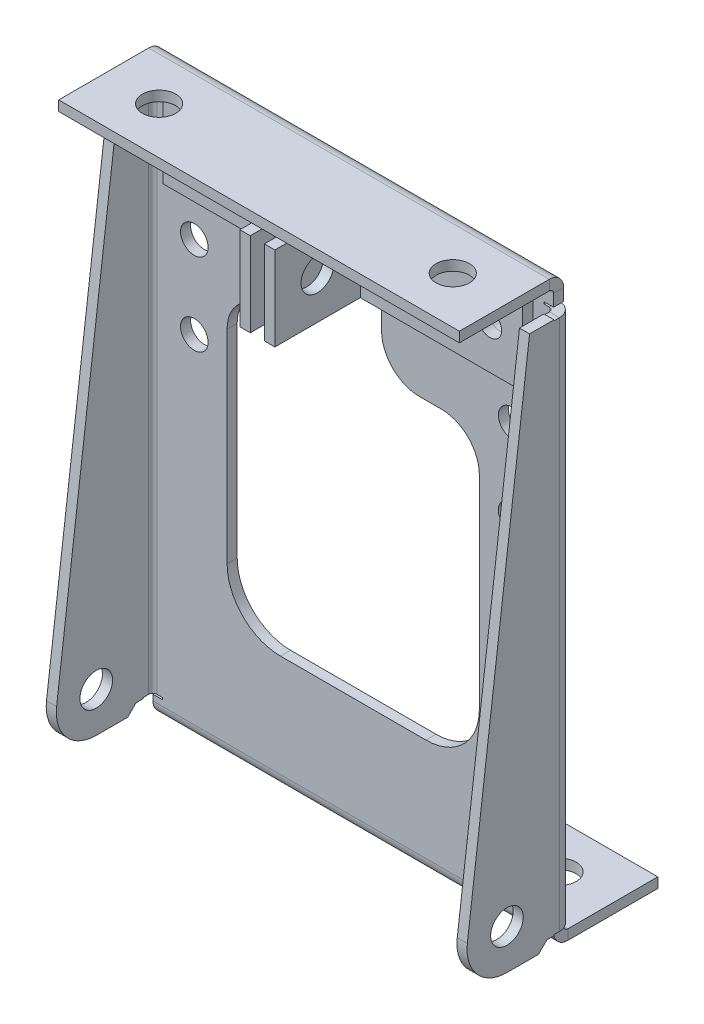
ISO-10303-21;
HEADER;
FILE_DESCRIPTION(('STEP AP214'),'2;1');
FILE_NAME('part.step','',(''),(''),'','','');
FILE_SCHEMA(('AUTOMOTIVE_DESIGN { 1 0 10303 214 1 1 1 1 }'));
ENDSEC;
DATA;
#1=APPLICATION_CONTEXT('core data for automotive mechanical design processes');
#2=APPLICATION_PROTOCOL_DEFINITION('international standard','automotive_design',2000,#1);
#3=PRODUCT_CONTEXT('',#1,'mechanical');
#4=PRODUCT('Part','Part','',(#3));
#5=PRODUCT_RELATED_PRODUCT_CATEGORY('part','',(#4));
#6=PRODUCT_DEFINITION_FORMATION('','',#4);
#7=PRODUCT_DEFINITION_CONTEXT('part definition',#1,'design');
#8=PRODUCT_DEFINITION('design','',#6,#7);
#9=PRODUCT_DEFINITION_SHAPE('','',#8);
#10=(LENGTH_UNIT() NAMED_UNIT(*) SI_UNIT(.MILLI.,.METRE.));
#11=(NAMED_UNIT(*) PLANE_ANGLE_UNIT() SI_UNIT($,.RADIAN.));
#12=(NAMED_UNIT(*) SI_UNIT($,.STERADIAN.) SOLID_ANGLE_UNIT());
#13=UNCERTAINTY_MEASURE_WITH_UNIT(LENGTH_MEASURE(1.E-05),#10,'distance_accuracy_value','');
#14=(GEOMETRIC_REPRESENTATION_CONTEXT(3) GLOBAL_UNCERTAINTY_ASSIGNED_CONTEXT((#13)) GLOBAL_UNIT_ASSIGNED_CONTEXT((#10,
#11,#12)) REPRESENTATION_CONTEXT('',''));
#15=CARTESIAN_POINT('',(0.,0.,0.));
#16=DIRECTION('',(0.,0.,1.));
#17=DIRECTION('',(1.,0.,0.));
#18=AXIS2_PLACEMENT_3D('',#15,#16,#17);
#19=CARTESIAN_POINT('',(0.839999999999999,66.8,1.2));
#20=DIRECTION('',(0.,0.,1.));
#21=DIRECTION('',(1.,0.,0.));
#22=AXIS2_PLACEMENT_3D('',#19,#20,#21);
#23=PLANE('',#22);
#24=CARTESIAN_POINT('',(7.8,61.8,1.2));
#25=DIRECTION('',(0.,0.,1.));
#26=DIRECTION('',(1.,0.,0.));
#27=AXIS2_PLACEMENT_3D('',#24,#25,#26);
#28=CIRCLE('',#27,1.4);
#29=CARTESIAN_POINT('',(9.2,61.8,1.2));
#30=VERTEX_POINT('',#29);
#31=EDGE_CURVE('E198',#30,#30,#28,.T.);
#32=ORIENTED_EDGE('',*,*,#31,.T.);
#33=EDGE_LOOP('',(#32));
#34=FACE_BOUND('',#33,.T.);
#35=CARTESIAN_POINT('',(17.5,61.8,1.19999999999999));
#36=DIRECTION('',(0.,0.,1.));
#37=DIRECTION('',(1.,0.,0.));
#38=AXIS2_PLACEMENT_3D('',#35,#36,#37);
#39=CIRCLE('',#38,1.4);
#40=CARTESIAN_POINT('',(18.9,61.8,1.19999999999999));
#41=VERTEX_POINT('',#40);
#42=EDGE_CURVE('E201',#41,#41,#39,.T.);
#43=ORIENTED_EDGE('',*,*,#42,.T.);
#44=EDGE_LOOP('',(#43));
#45=FACE_BOUND('',#44,.T.);
#46=DIRECTION('',(-1.,0.,0.));
#47=VECTOR('',#46,1.);
#48=CARTESIAN_POINT('',(0.839999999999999,56.8,1.2));
#49=LINE('',#48,#47);
#50=CARTESIAN_POINT('',(21.4,56.8,1.19999999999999));
#51=VERTEX_POINT('',#50);
#52=CARTESIAN_POINT('',(0.839999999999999,56.8,1.2));
#53=VERTEX_POINT('',#52);
#54=EDGE_CURVE('E153',#51,#53,#49,.T.);
#55=ORIENTED_EDGE('',*,*,#54,.T.);
#56=DIRECTION('',(0.,-1.,0.));
#57=VECTOR('',#56,1.);
#58=CARTESIAN_POINT('',(0.839999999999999,66.8,1.2));
#59=LINE('',#58,#57);
#60=CARTESIAN_POINT('',(0.839999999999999,66.8,1.2));
#61=VERTEX_POINT('',#60);
#62=EDGE_CURVE('E14',#61,#53,#59,.T.);
#63=ORIENTED_EDGE('',*,*,#62,.F.);
#64=DIRECTION('',(-1.,0.,0.));
#65=VECTOR('',#64,1.);
#66=CARTESIAN_POINT('',(0.839999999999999,66.8,1.2));
#67=LINE('',#66,#65);
#68=CARTESIAN_POINT('',(21.4,66.8,1.19999999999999));
#69=VERTEX_POINT('',#68);
#70=EDGE_CURVE('E164',#69,#61,#67,.T.);
#71=ORIENTED_EDGE('',*,*,#70,.F.);
#72=DIRECTION('',(0.,-1.,0.));
#73=VECTOR('',#72,1.);
#74=CARTESIAN_POINT('',(21.4,66.8,1.19999999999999));
#75=LINE('',#74,#73);
#76=EDGE_CURVE('E149',#69,#51,#75,.T.);
#77=ORIENTED_EDGE('',*,*,#76,.T.);
#78=EDGE_LOOP('',(#55,#63,#71,#77));
#79=FACE_BOUND('',#78,.T.);
#80=ADVANCED_FACE('F69',(#34,#45,#79),#23,.F.);
#81=CARTESIAN_POINT('',(0.839999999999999,66.8,1.2));
#82=DIRECTION('',(1.,0.,0.));
#83=DIRECTION('',(0.,0.,-1.));
#84=AXIS2_PLACEMENT_3D('',#81,#82,#83);
#85=PLANE('',#84);
#86=CARTESIAN_POINT('',(0.84,61.8,7.53999999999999));
#87=DIRECTION('',(1.,0.,0.));
#88=DIRECTION('',(0.,0.,-1.));
#89=AXIS2_PLACEMENT_3D('',#86,#87,#88);
#90=CIRCLE('',#89,1.94);
#91=CARTESIAN_POINT('',(0.839999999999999,61.8,5.59999999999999));
#92=VERTEX_POINT('',#91);
#93=EDGE_CURVE('E157',#92,#92,#90,.T.);
#94=ORIENTED_EDGE('',*,*,#93,.T.);
#95=EDGE_LOOP('',(#94));
#96=FACE_BOUND('',#95,.T.);
#97=DIRECTION('',(0.,0.,1.));
#98=VECTOR('',#97,1.);
#99=CARTESIAN_POINT('',(0.839999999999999,56.8,1.2));
#100=LINE('',#99,#98);
#101=CARTESIAN_POINT('',(0.84,56.8,12.6));
#102=VERTEX_POINT('',#101);
#103=EDGE_CURVE('E156',#53,#102,#100,.T.);
#104=ORIENTED_EDGE('',*,*,#103,.T.);
#105=DIRECTION('',(0.,-1.,0.));
#106=VECTOR('',#105,1.);
#107=CARTESIAN_POINT('',(0.84,66.8,12.6));
#108=LINE('',#107,#106);
#109=CARTESIAN_POINT('',(0.84,66.8,12.6));
#110=VERTEX_POINT('',#109);
#111=EDGE_CURVE('E77',#110,#102,#108,.T.);
#112=ORIENTED_EDGE('',*,*,#111,.F.);
#113=DIRECTION('',(0.,0.,1.));
#114=VECTOR('',#113,1.);
#115=CARTESIAN_POINT('',(0.839999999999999,66.8,1.2));
#116=LINE('',#115,#114);
#117=EDGE_CURVE('E122',#61,#110,#116,.T.);
#118=ORIENTED_EDGE('',*,*,#117,.F.);
#119=ORIENTED_EDGE('',*,*,#62,.T.);
#120=EDGE_LOOP('',(#104,#112,#118,#119));
#121=FACE_BOUND('',#120,.T.);
#122=ADVANCED_FACE('F189',(#96,#121),#85,.F.);
#123=CARTESIAN_POINT('',(0.84,66.8,12.6));
#124=DIRECTION('',(0.,0.,-1.));
#125=DIRECTION('',(-1.,0.,0.));
#126=AXIS2_PLACEMENT_3D('',#123,#124,#125);
#127=PLANE('',#126);
#128=DIRECTION('',(1.,0.,0.));
#129=VECTOR('',#128,1.);
#130=CARTESIAN_POINT('',(0.84,56.8,12.6));
#131=LINE('',#130,#129);
#132=CARTESIAN_POINT('',(2.08,56.8,12.6));
#133=VERTEX_POINT('',#132);
#134=EDGE_CURVE('E159',#102,#133,#131,.T.);
#135=ORIENTED_EDGE('',*,*,#134,.T.);
#136=DIRECTION('',(0.,-1.,0.));
#137=VECTOR('',#136,1.);
#138=CARTESIAN_POINT('',(2.08,66.8,12.6));
#139=LINE('',#138,#137);
#140=CARTESIAN_POINT('',(2.08,66.8,12.6));
#141=VERTEX_POINT('',#140);
#142=EDGE_CURVE('E144',#141,#133,#139,.T.);
#143=ORIENTED_EDGE('',*,*,#142,.F.);
#144=DIRECTION('',(1.,0.,0.));
#145=VECTOR('',#144,1.);
#146=CARTESIAN_POINT('',(0.84,66.8,12.6));
#147=LINE('',#146,#145);
#148=EDGE_CURVE('E135',#110,#141,#147,.T.);
#149=ORIENTED_EDGE('',*,*,#148,.F.);
#150=ORIENTED_EDGE('',*,*,#111,.T.);
#151=EDGE_LOOP('',(#135,#143,#149,#150));
#152=FACE_BOUND('',#151,.T.);
#153=ADVANCED_FACE('F170',(#152),#127,.F.);
#154=CARTESIAN_POINT('',(2.08,66.8,12.6));
#155=DIRECTION('',(-1.,0.,0.));
#156=DIRECTION('',(0.,0.,1.));
#157=AXIS2_PLACEMENT_3D('',#154,#155,#156);
#158=PLANE('',#157);
#159=CARTESIAN_POINT('',(2.08,61.8,7.53999999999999));
#160=DIRECTION('',(-1.,0.,0.));
#161=DIRECTION('',(0.,0.,1.));
#162=AXIS2_PLACEMENT_3D('',#159,#160,#161);
#163=CIRCLE('',#162,1.94);
#164=CARTESIAN_POINT('',(2.08,61.8,9.47999999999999));
#165=VERTEX_POINT('',#164);
#166=EDGE_CURVE('E205',#165,#165,#163,.F.);
#167=ORIENTED_EDGE('',*,*,#166,.F.);
#168=EDGE_LOOP('',(#167));
#169=FACE_BOUND('',#168,.T.);
#170=DIRECTION('',(0.,0.,-1.));
#171=VECTOR('',#170,1.);
#172=CARTESIAN_POINT('',(2.08,56.8,12.6));
#173=LINE('',#172,#171);
#174=CARTESIAN_POINT('',(2.08,56.8,2.44));
#175=VERTEX_POINT('',#174);
#176=EDGE_CURVE('E143',#133,#175,#173,.T.);
#177=ORIENTED_EDGE('',*,*,#176,.T.);
#178=DIRECTION('',(0.,-1.,0.));
#179=VECTOR('',#178,1.);
#180=CARTESIAN_POINT('',(2.08,66.8,2.44));
#181=LINE('',#180,#179);
#182=CARTESIAN_POINT('',(2.08,66.8,2.44));
#183=VERTEX_POINT('',#182);
#184=EDGE_CURVE('E140',#183,#175,#181,.T.);
#185=ORIENTED_EDGE('',*,*,#184,.F.);
#186=DIRECTION('',(0.,0.,-1.));
#187=VECTOR('',#186,1.);
#188=CARTESIAN_POINT('',(2.08,66.8,12.6));
#189=LINE('',#188,#187);
#190=EDGE_CURVE('E129',#141,#183,#189,.T.);
#191=ORIENTED_EDGE('',*,*,#190,.F.);
#192=ORIENTED_EDGE('',*,*,#142,.T.);
#193=EDGE_LOOP('',(#177,#185,#191,#192));
#194=FACE_BOUND('',#193,.T.);
#195=ADVANCED_FACE('F141',(#169,#194),#158,.F.);
#196=CARTESIAN_POINT('',(2.08,66.8,2.44));
#197=DIRECTION('',(0.,0.,-1.));
#198=DIRECTION('',(-1.,0.,0.));
#199=AXIS2_PLACEMENT_3D('',#196,#197,#198);
#200=PLANE('',#199);
#201=CARTESIAN_POINT('',(7.8,61.8,2.44));
#202=DIRECTION('',(0.,0.,1.));
#203=DIRECTION('',(1.,0.,0.));
#204=AXIS2_PLACEMENT_3D('',#201,#202,#203);
#205=CIRCLE('',#204,1.4);
#206=CARTESIAN_POINT('',(9.2,61.8,2.44));
#207=VERTEX_POINT('',#206);
#208=EDGE_CURVE('E203',#207,#207,#205,.T.);
#209=ORIENTED_EDGE('',*,*,#208,.F.);
#210=EDGE_LOOP('',(#209));
#211=FACE_BOUND('',#210,.T.);
#212=CARTESIAN_POINT('',(17.5,61.8,2.44));
#213=DIRECTION('',(0.,0.,1.));
#214=DIRECTION('',(1.,0.,0.));
#215=AXIS2_PLACEMENT_3D('',#212,#213,#214);
#216=CIRCLE('',#215,1.4);
#217=CARTESIAN_POINT('',(18.9,61.8,2.44));
#218=VERTEX_POINT('',#217);
#219=EDGE_CURVE('E208',#218,#218,#216,.T.);
#220=ORIENTED_EDGE('',*,*,#219,.F.);
#221=EDGE_LOOP('',(#220));
#222=FACE_BOUND('',#221,.T.);
#223=DIRECTION('',(1.,0.,0.));
#224=VECTOR('',#223,1.);
#225=CARTESIAN_POINT('',(2.08,56.8,2.44));
#226=LINE('',#225,#224);
#227=CARTESIAN_POINT('',(21.4,56.8,2.43999999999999));
#228=VERTEX_POINT('',#227);
#229=EDGE_CURVE('E108',#175,#228,#226,.T.);
#230=ORIENTED_EDGE('',*,*,#229,.T.);
#231=DIRECTION('',(0.,-1.,0.));
#232=VECTOR('',#231,1.);
#233=CARTESIAN_POINT('',(21.4,66.8,2.43999999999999));
#234=LINE('',#233,#232);
#235=CARTESIAN_POINT('',(21.4,66.8,2.43999999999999));
#236=VERTEX_POINT('',#235);
#237=EDGE_CURVE('E145',#236,#228,#234,.T.);
#238=ORIENTED_EDGE('',*,*,#237,.F.);
#239=DIRECTION('',(1.,0.,0.));
#240=VECTOR('',#239,1.);
#241=CARTESIAN_POINT('',(2.08,66.8,2.44));
#242=LINE('',#241,#240);
#243=EDGE_CURVE('E133',#183,#236,#242,.T.);
#244=ORIENTED_EDGE('',*,*,#243,.F.);
#245=ORIENTED_EDGE('',*,*,#184,.T.);
#246=EDGE_LOOP('',(#230,#238,#244,#245));
#247=FACE_BOUND('',#246,.T.);
#248=ADVANCED_FACE('F147',(#211,#222,#247),#200,.F.);
#249=CARTESIAN_POINT('',(21.4,66.8,2.43999999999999));
#250=DIRECTION('',(-1.,0.,0.));
#251=DIRECTION('',(0.,0.,1.));
#252=AXIS2_PLACEMENT_3D('',#249,#250,#251);
#253=PLANE('',#252);
#254=DIRECTION('',(0.,0.,-1.));
#255=VECTOR('',#254,1.);
#256=CARTESIAN_POINT('',(21.4,56.8,2.43999999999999));
#257=LINE('',#256,#255);
#258=EDGE_CURVE('E114',#228,#51,#257,.T.);
#259=ORIENTED_EDGE('',*,*,#258,.T.);
#260=ORIENTED_EDGE('',*,*,#76,.F.);
#261=DIRECTION('',(0.,0.,-1.));
#262=VECTOR('',#261,1.);
#263=CARTESIAN_POINT('',(21.4,66.8,2.43999999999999));
#264=LINE('',#263,#262);
#265=EDGE_CURVE('E85',#236,#69,#264,.T.);
#266=ORIENTED_EDGE('',*,*,#265,.F.);
#267=ORIENTED_EDGE('',*,*,#237,.T.);
#268=EDGE_LOOP('',(#259,#260,#266,#267));
#269=FACE_BOUND('',#268,.T.);
#270=ADVANCED_FACE('F177',(#269),#253,.F.);
#271=CARTESIAN_POINT('',(21.4,66.8,1.19999999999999));
#272=DIRECTION('',(0.,1.,0.));
#273=DIRECTION('',(0.,0.,1.));
#274=AXIS2_PLACEMENT_3D('',#271,#272,#273);
#275=PLANE('',#274);
#276=ORIENTED_EDGE('',*,*,#70,.T.);
#277=ORIENTED_EDGE('',*,*,#117,.T.);
#278=ORIENTED_EDGE('',*,*,#148,.T.);
#279=ORIENTED_EDGE('',*,*,#190,.T.);
#280=ORIENTED_EDGE('',*,*,#243,.T.);
#281=ORIENTED_EDGE('',*,*,#265,.T.);
#282=EDGE_LOOP('',(#276,#277,#278,#279,#280,#281));
#283=FACE_BOUND('',#282,.T.);
#284=ADVANCED_FACE('F131',(#283),#275,.T.);
#285=CARTESIAN_POINT('',(21.4,56.8,1.19999999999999));
#286=DIRECTION('',(0.,1.,0.));
#287=DIRECTION('',(0.,0.,1.));
#288=AXIS2_PLACEMENT_3D('',#285,#286,#287);
#289=PLANE('',#288);
#290=ORIENTED_EDGE('',*,*,#54,.F.);
#291=ORIENTED_EDGE('',*,*,#258,.F.);
#292=ORIENTED_EDGE('',*,*,#229,.F.);
#293=ORIENTED_EDGE('',*,*,#176,.F.);
#294=ORIENTED_EDGE('',*,*,#134,.F.);
#295=ORIENTED_EDGE('',*,*,#103,.F.);
#296=EDGE_LOOP('',(#290,#291,#292,#293,#294,#295));
#297=FACE_BOUND('',#296,.T.);
#298=ADVANCED_FACE('F173',(#297),#289,.F.);
#299=CARTESIAN_POINT('',(7.56714862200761,61.8,7.53999999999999));
#300=DIRECTION('',(-1.,0.,0.));
#301=DIRECTION('',(0.,0.,1.));
#302=AXIS2_PLACEMENT_3D('',#299,#300,#301);
#303=CYLINDRICAL_SURFACE('',#302,1.94);
#304=ORIENTED_EDGE('',*,*,#166,.T.);
#305=EDGE_LOOP('',(#304));
#306=FACE_BOUND('',#305,.T.);
#307=ORIENTED_EDGE('',*,*,#93,.F.);
#308=EDGE_LOOP('',(#307));
#309=FACE_BOUND('',#308,.T.);
#310=ADVANCED_FACE('F219',(#306,#309),#303,.F.);
#311=CARTESIAN_POINT('',(17.5,61.8,-11.2));
#312=DIRECTION('',(0.,0.,1.));
#313=DIRECTION('',(1.,0.,0.));
#314=AXIS2_PLACEMENT_3D('',#311,#312,#313);
#315=CYLINDRICAL_SURFACE('',#314,1.4);
#316=ORIENTED_EDGE('',*,*,#219,.T.);
#317=EDGE_LOOP('',(#316));
#318=FACE_BOUND('',#317,.T.);
#319=ORIENTED_EDGE('',*,*,#42,.F.);
#320=EDGE_LOOP('',(#319));
#321=FACE_BOUND('',#320,.T.);
#322=ADVANCED_FACE('F221',(#318,#321),#315,.F.);
#323=CARTESIAN_POINT('',(7.8,61.8,-11.2));
#324=DIRECTION('',(0.,0.,1.));
#325=DIRECTION('',(1.,0.,0.));
#326=AXIS2_PLACEMENT_3D('',#323,#324,#325);
#327=CYLINDRICAL_SURFACE('',#326,1.4);
#328=ORIENTED_EDGE('',*,*,#208,.T.);
#329=EDGE_LOOP('',(#328));
#330=FACE_BOUND('',#329,.T.);
#331=ORIENTED_EDGE('',*,*,#31,.F.);
#332=EDGE_LOOP('',(#331));
#333=FACE_BOUND('',#332,.T.);
#334=ADVANCED_FACE('F228',(#330,#333),#327,.F.);
#335=CLOSED_SHELL('',(#80,#122,#153,#195,#248,#270,#284,#298,#310,#322,#334));
#336=MANIFOLD_SOLID_BREP('B2',#335);
#337=CARTESIAN_POINT('',(-21.4,66.8,1.2));
#338=DIRECTION('',(1.,0.,0.));
#339=DIRECTION('',(0.,0.,-1.));
#340=AXIS2_PLACEMENT_3D('',#337,#338,#339);
#341=PLANE('',#340);
#342=DIRECTION('',(0.,0.,1.));
#343=VECTOR('',#342,1.);
#344=CARTESIAN_POINT('',(-21.4,56.8,1.2));
#345=LINE('',#344,#343);
#346=CARTESIAN_POINT('',(-21.4,56.8,1.2));
#347=VERTEX_POINT('',#346);
#348=CARTESIAN_POINT('',(-21.4,56.8,2.44));
#349=VERTEX_POINT('',#348);
#350=EDGE_CURVE('E402',#347,#349,#345,.T.);
#351=ORIENTED_EDGE('',*,*,#350,.T.);
#352=DIRECTION('',(0.,-1.,0.));
#353=VECTOR('',#352,1.);
#354=CARTESIAN_POINT('',(-21.4,66.8,2.44));
#355=LINE('',#354,#353);
#356=CARTESIAN_POINT('',(-21.4,66.8,2.44));
#357=VERTEX_POINT('',#356);
#358=EDGE_CURVE('E67',#357,#349,#355,.T.);
#359=ORIENTED_EDGE('',*,*,#358,.F.);
#360=DIRECTION('',(0.,0.,1.));
#361=VECTOR('',#360,1.);
#362=CARTESIAN_POINT('',(-21.4,66.8,1.2));
#363=LINE('',#362,#361);
#364=CARTESIAN_POINT('',(-21.4,66.8,1.2));
#365=VERTEX_POINT('',#364);
#366=EDGE_CURVE('E413',#365,#357,#363,.T.);
#367=ORIENTED_EDGE('',*,*,#366,.F.);
#368=DIRECTION('',(0.,-1.,0.));
#369=VECTOR('',#368,1.);
#370=CARTESIAN_POINT('',(-21.4,66.8,1.2));
#371=LINE('',#370,#369);
#372=EDGE_CURVE('E398',#365,#347,#371,.T.);
#373=ORIENTED_EDGE('',*,*,#372,.T.);
#374=EDGE_LOOP('',(#351,#359,#367,#373));
#375=FACE_BOUND('',#374,.T.);
#376=ADVANCED_FACE('F316',(#375),#341,.F.);
#377=CARTESIAN_POINT('',(-21.4,66.8,2.44));
#378=DIRECTION('',(0.,0.,-1.));
#379=DIRECTION('',(-1.,0.,0.));
#380=AXIS2_PLACEMENT_3D('',#377,#378,#379);
#381=PLANE('',#380);
#382=CARTESIAN_POINT('',(-17.5,61.8,2.44));
#383=DIRECTION('',(0.,0.,1.));
#384=DIRECTION('',(1.,0.,0.));
#385=AXIS2_PLACEMENT_3D('',#382,#383,#384);
#386=CIRCLE('',#385,1.4);
#387=CARTESIAN_POINT('',(-16.1,61.8,2.44));
#388=VERTEX_POINT('',#387);
#389=EDGE_CURVE('E423',#388,#388,#386,.T.);
#390=ORIENTED_EDGE('',*,*,#389,.F.);
#391=EDGE_LOOP('',(#390));
#392=FACE_BOUND('',#391,.T.);
#393=CARTESIAN_POINT('',(-7.8,61.8,2.44));
#394=DIRECTION('',(0.,0.,1.));
#395=DIRECTION('',(1.,0.,0.));
#396=AXIS2_PLACEMENT_3D('',#393,#394,#395);
#397=CIRCLE('',#396,1.4);
#398=CARTESIAN_POINT('',(-6.4,61.8,2.44));
#399=VERTEX_POINT('',#398);
#400=EDGE_CURVE('E428',#399,#399,#397,.T.);
#401=ORIENTED_EDGE('',*,*,#400,.F.);
#402=EDGE_LOOP('',(#401));
#403=FACE_BOUND('',#402,.T.);
#404=DIRECTION('',(1.,0.,0.));
#405=VECTOR('',#404,1.);
#406=CARTESIAN_POINT('',(-21.4,56.8,2.44));
#407=LINE('',#406,#405);
#408=CARTESIAN_POINT('',(-2.08,56.8,2.44));
#409=VERTEX_POINT('',#408);
#410=EDGE_CURVE('E405',#349,#409,#407,.T.);
#411=ORIENTED_EDGE('',*,*,#410,.T.);
#412=DIRECTION('',(0.,-1.,0.));
#413=VECTOR('',#412,1.);
#414=CARTESIAN_POINT('',(-2.08,66.8,2.44));
#415=LINE('',#414,#413);
#416=CARTESIAN_POINT('',(-2.08,66.8,2.44));
#417=VERTEX_POINT('',#416);
#418=EDGE_CURVE('E325',#417,#409,#415,.T.);
#419=ORIENTED_EDGE('',*,*,#418,.F.);
#420=DIRECTION('',(1.,0.,0.));
#421=VECTOR('',#420,1.);
#422=CARTESIAN_POINT('',(-21.4,66.8,2.44));
#423=LINE('',#422,#421);
#424=EDGE_CURVE('E371',#357,#417,#423,.T.);
#425=ORIENTED_EDGE('',*,*,#424,.F.);
#426=ORIENTED_EDGE('',*,*,#358,.T.);
#427=EDGE_LOOP('',(#411,#419,#425,#426));
#428=FACE_BOUND('',#427,.T.);
#429=ADVANCED_FACE('F440',(#392,#403,#428),#381,.F.);
#430=CARTESIAN_POINT('',(-2.08,66.8,2.44));
#431=DIRECTION('',(1.,0.,0.));
#432=DIRECTION('',(0.,0.,-1.));
#433=AXIS2_PLACEMENT_3D('',#430,#431,#432);
#434=PLANE('',#433);
#435=CARTESIAN_POINT('',(-2.08,61.8,7.53999999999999));
#436=DIRECTION('',(-1.,0.,0.));
#437=DIRECTION('',(0.,0.,1.));
#438=AXIS2_PLACEMENT_3D('',#435,#436,#437);
#439=CIRCLE('',#438,1.94);
#440=CARTESIAN_POINT('',(-2.08,61.8,9.47999999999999));
#441=VERTEX_POINT('',#440);
#442=EDGE_CURVE('E420',#441,#441,#439,.T.);
#443=ORIENTED_EDGE('',*,*,#442,.F.);
#444=EDGE_LOOP('',(#443));
#445=FACE_BOUND('',#444,.T.);
#446=DIRECTION('',(0.,0.,1.));
#447=VECTOR('',#446,1.);
#448=CARTESIAN_POINT('',(-2.08,56.8,2.44));
#449=LINE('',#448,#447);
#450=CARTESIAN_POINT('',(-2.08,56.8,12.6));
#451=VERTEX_POINT('',#450);
#452=EDGE_CURVE('E408',#409,#451,#449,.T.);
#453=ORIENTED_EDGE('',*,*,#452,.T.);
#454=DIRECTION('',(0.,-1.,0.));
#455=VECTOR('',#454,1.);
#456=CARTESIAN_POINT('',(-2.08,66.8,12.6));
#457=LINE('',#456,#455);
#458=CARTESIAN_POINT('',(-2.08,66.8,12.6));
#459=VERTEX_POINT('',#458);
#460=EDGE_CURVE('E393',#459,#451,#457,.T.);
#461=ORIENTED_EDGE('',*,*,#460,.F.);
#462=DIRECTION('',(0.,0.,1.));
#463=VECTOR('',#462,1.);
#464=CARTESIAN_POINT('',(-2.08,66.8,2.44));
#465=LINE('',#464,#463);
#466=EDGE_CURVE('E384',#417,#459,#465,.T.);
#467=ORIENTED_EDGE('',*,*,#466,.F.);
#468=ORIENTED_EDGE('',*,*,#418,.T.);
#469=EDGE_LOOP('',(#453,#461,#467,#468));
#470=FACE_BOUND('',#469,.T.);
#471=ADVANCED_FACE('F443',(#445,#470),#434,.F.);
#472=CARTESIAN_POINT('',(-2.08,66.8,12.6));
#473=DIRECTION('',(0.,0.,-1.));
#474=DIRECTION('',(-1.,0.,0.));
#475=AXIS2_PLACEMENT_3D('',#472,#473,#474);
#476=PLANE('',#475);
#477=DIRECTION('',(1.,0.,0.));
#478=VECTOR('',#477,1.);
#479=CARTESIAN_POINT('',(-2.08,56.8,12.6));
#480=LINE('',#479,#478);
#481=CARTESIAN_POINT('',(-0.84,56.8,12.6));
#482=VERTEX_POINT('',#481);
#483=EDGE_CURVE('E392',#451,#482,#480,.T.);
#484=ORIENTED_EDGE('',*,*,#483,.T.);
#485=DIRECTION('',(0.,-1.,0.));
#486=VECTOR('',#485,1.);
#487=CARTESIAN_POINT('',(-0.84,66.8,12.6));
#488=LINE('',#487,#486);
#489=CARTESIAN_POINT('',(-0.84,66.8,12.6));
#490=VERTEX_POINT('',#489);
#491=EDGE_CURVE('E389',#490,#482,#488,.T.);
#492=ORIENTED_EDGE('',*,*,#491,.F.);
#493=DIRECTION('',(1.,0.,0.));
#494=VECTOR('',#493,1.);
#495=CARTESIAN_POINT('',(-2.08,66.8,12.6));
#496=LINE('',#495,#494);
#497=EDGE_CURVE('E378',#459,#490,#496,.T.);
#498=ORIENTED_EDGE('',*,*,#497,.F.);
#499=ORIENTED_EDGE('',*,*,#460,.T.);
#500=EDGE_LOOP('',(#484,#492,#498,#499));
#501=FACE_BOUND('',#500,.T.);
#502=ADVANCED_FACE('F390',(#501),#476,.F.);
#503=CARTESIAN_POINT('',(-0.84,66.8,12.6));
#504=DIRECTION('',(-1.,0.,0.));
#505=DIRECTION('',(0.,0.,1.));
#506=AXIS2_PLACEMENT_3D('',#503,#504,#505);
#507=PLANE('',#506);
#508=CARTESIAN_POINT('',(-0.840000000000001,61.8,7.53999999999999));
#509=DIRECTION('',(-1.,0.,0.));
#510=DIRECTION('',(0.,0.,1.));
#511=AXIS2_PLACEMENT_3D('',#508,#509,#510);
#512=CIRCLE('',#511,1.94);
#513=CARTESIAN_POINT('',(-0.84,61.8,9.47999999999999));
#514=VERTEX_POINT('',#513);
#515=EDGE_CURVE('E406',#514,#514,#512,.T.);
#516=ORIENTED_EDGE('',*,*,#515,.T.);
#517=EDGE_LOOP('',(#516));
#518=FACE_BOUND('',#517,.T.);
#519=DIRECTION('',(0.,0.,-1.));
#520=VECTOR('',#519,1.);
#521=CARTESIAN_POINT('',(-0.84,56.8,12.6));
#522=LINE('',#521,#520);
#523=CARTESIAN_POINT('',(-0.840000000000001,56.8,1.2));
#524=VERTEX_POINT('',#523);
#525=EDGE_CURVE('E357',#482,#524,#522,.T.);
#526=ORIENTED_EDGE('',*,*,#525,.T.);
#527=DIRECTION('',(0.,-1.,0.));
#528=VECTOR('',#527,1.);
#529=CARTESIAN_POINT('',(-0.840000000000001,66.8,1.2));
#530=LINE('',#529,#528);
#531=CARTESIAN_POINT('',(-0.840000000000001,66.8,1.2));
#532=VERTEX_POINT('',#531);
#533=EDGE_CURVE('E394',#532,#524,#530,.T.);
#534=ORIENTED_EDGE('',*,*,#533,.F.);
#535=DIRECTION('',(0.,0.,-1.));
#536=VECTOR('',#535,1.);
#537=CARTESIAN_POINT('',(-0.84,66.8,12.6));
#538=LINE('',#537,#536);
#539=EDGE_CURVE('E382',#490,#532,#538,.T.);
#540=ORIENTED_EDGE('',*,*,#539,.F.);
#541=ORIENTED_EDGE('',*,*,#491,.T.);
#542=EDGE_LOOP('',(#526,#534,#540,#541));
#543=FACE_BOUND('',#542,.T.);
#544=ADVANCED_FACE('F396',(#518,#543),#507,.F.);
#545=CARTESIAN_POINT('',(-21.4,66.8,1.2));
#546=DIRECTION('',(0.,0.,1.));
#547=DIRECTION('',(1.,0.,0.));
#548=AXIS2_PLACEMENT_3D('',#545,#546,#547);
#549=PLANE('',#548);
#550=CARTESIAN_POINT('',(-17.5,61.8,1.2));
#551=DIRECTION('',(0.,0.,1.));
#552=DIRECTION('',(1.,0.,0.));
#553=AXIS2_PLACEMENT_3D('',#550,#551,#552);
#554=CIRCLE('',#553,1.4);
#555=CARTESIAN_POINT('',(-16.1,61.8,1.2));
#556=VERTEX_POINT('',#555);
#557=EDGE_CURVE('E319',#556,#556,#554,.T.);
#558=ORIENTED_EDGE('',*,*,#557,.T.);
#559=EDGE_LOOP('',(#558));
#560=FACE_BOUND('',#559,.T.);
#561=CARTESIAN_POINT('',(-7.8,61.8,1.2));
#562=DIRECTION('',(0.,0.,1.));
#563=DIRECTION('',(1.,0.,0.));
#564=AXIS2_PLACEMENT_3D('',#561,#562,#563);
#565=CIRCLE('',#564,1.4);
#566=CARTESIAN_POINT('',(-6.4,61.8,1.2));
#567=VERTEX_POINT('',#566);
#568=EDGE_CURVE('E421',#567,#567,#565,.T.);
#569=ORIENTED_EDGE('',*,*,#568,.T.);
#570=EDGE_LOOP('',(#569));
#571=FACE_BOUND('',#570,.T.);
#572=DIRECTION('',(-1.,0.,0.));
#573=VECTOR('',#572,1.);
#574=CARTESIAN_POINT('',(-21.4,56.8,1.2));
#575=LINE('',#574,#573);
#576=EDGE_CURVE('E363',#524,#347,#575,.T.);
#577=ORIENTED_EDGE('',*,*,#576,.T.);
#578=ORIENTED_EDGE('',*,*,#372,.F.);
#579=DIRECTION('',(-1.,0.,0.));
#580=VECTOR('',#579,1.);
#581=CARTESIAN_POINT('',(-21.4,66.8,1.2));
#582=LINE('',#581,#580);
#583=EDGE_CURVE('E334',#532,#365,#582,.T.);
#584=ORIENTED_EDGE('',*,*,#583,.F.);
#585=ORIENTED_EDGE('',*,*,#533,.T.);
#586=EDGE_LOOP('',(#577,#578,#584,#585));
#587=FACE_BOUND('',#586,.T.);
#588=ADVANCED_FACE('F448',(#560,#571,#587),#549,.F.);
#589=CARTESIAN_POINT('',(-21.4,66.8,2.44));
#590=DIRECTION('',(0.,1.,0.));
#591=DIRECTION('',(0.,0.,1.));
#592=AXIS2_PLACEMENT_3D('',#589,#590,#591);
#593=PLANE('',#592);
#594=ORIENTED_EDGE('',*,*,#366,.T.);
#595=ORIENTED_EDGE('',*,*,#424,.T.);
#596=ORIENTED_EDGE('',*,*,#466,.T.);
#597=ORIENTED_EDGE('',*,*,#497,.T.);
#598=ORIENTED_EDGE('',*,*,#539,.T.);
#599=ORIENTED_EDGE('',*,*,#583,.T.);
#600=EDGE_LOOP('',(#594,#595,#596,#597,#598,#599));
#601=FACE_BOUND('',#600,.T.);
#602=ADVANCED_FACE('F380',(#601),#593,.T.);
#603=CARTESIAN_POINT('',(-21.4,56.8,2.44));
#604=DIRECTION('',(0.,1.,0.));
#605=DIRECTION('',(0.,0.,1.));
#606=AXIS2_PLACEMENT_3D('',#603,#604,#605);
#607=PLANE('',#606);
#608=ORIENTED_EDGE('',*,*,#350,.F.);
#609=ORIENTED_EDGE('',*,*,#576,.F.);
#610=ORIENTED_EDGE('',*,*,#525,.F.);
#611=ORIENTED_EDGE('',*,*,#483,.F.);
#612=ORIENTED_EDGE('',*,*,#452,.F.);
#613=ORIENTED_EDGE('',*,*,#410,.F.);
#614=EDGE_LOOP('',(#608,#609,#610,#611,#612,#613));
#615=FACE_BOUND('',#614,.T.);
#616=ADVANCED_FACE('F446',(#615),#607,.F.);
#617=CARTESIAN_POINT('',(7.56714862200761,61.8,7.53999999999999));
#618=DIRECTION('',(-1.,0.,0.));
#619=DIRECTION('',(0.,0.,1.));
#620=AXIS2_PLACEMENT_3D('',#617,#618,#619);
#621=CYLINDRICAL_SURFACE('',#620,1.94);
#622=ORIENTED_EDGE('',*,*,#442,.T.);
#623=EDGE_LOOP('',(#622));
#624=FACE_BOUND('',#623,.T.);
#625=ORIENTED_EDGE('',*,*,#515,.F.);
#626=EDGE_LOOP('',(#625));
#627=FACE_BOUND('',#626,.T.);
#628=ADVANCED_FACE('F491',(#624,#627),#621,.F.);
#629=CARTESIAN_POINT('',(-7.8,61.8,-11.2));
#630=DIRECTION('',(0.,0.,1.));
#631=DIRECTION('',(1.,0.,0.));
#632=AXIS2_PLACEMENT_3D('',#629,#630,#631);
#633=CYLINDRICAL_SURFACE('',#632,1.4);
#634=ORIENTED_EDGE('',*,*,#400,.T.);
#635=EDGE_LOOP('',(#634));
#636=FACE_BOUND('',#635,.T.);
#637=ORIENTED_EDGE('',*,*,#568,.F.);
#638=EDGE_LOOP('',(#637));
#639=FACE_BOUND('',#638,.T.);
#640=ADVANCED_FACE('F495',(#636,#639),#633,.F.);
#641=CARTESIAN_POINT('',(-17.5,61.8,-11.2));
#642=DIRECTION('',(0.,0.,1.));
#643=DIRECTION('',(1.,0.,0.));
#644=AXIS2_PLACEMENT_3D('',#641,#642,#643);
#645=CYLINDRICAL_SURFACE('',#644,1.4);
#646=ORIENTED_EDGE('',*,*,#389,.T.);
#647=EDGE_LOOP('',(#646));
#648=FACE_BOUND('',#647,.T.);
#649=ORIENTED_EDGE('',*,*,#557,.F.);
#650=EDGE_LOOP('',(#649));
#651=FACE_BOUND('',#650,.T.);
#652=ADVANCED_FACE('F517',(#648,#651),#645,.F.);
#653=CLOSED_SHELL('',(#376,#429,#471,#502,#544,#588,#602,#616,#628,#640,#652));
#654=MANIFOLD_SOLID_BREP('B8',#653);
#655=CARTESIAN_POINT('',(-23.825,0.,1.19999999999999));
#656=DIRECTION('',(1.,0.,0.));
#657=DIRECTION('',(0.,-1.,0.));
#658=AXIS2_PLACEMENT_3D('',#655,#656,#657);
#659=PLANE('',#658);
#660=DIRECTION('',(0.,1.,0.));
#661=VECTOR('',#660,1.);
#662=CARTESIAN_POINT('',(-23.825,0.,0.));
#663=LINE('',#662,#661);
#664=CARTESIAN_POINT('',(-23.825,2.385,0.));
#665=VERTEX_POINT('',#664);
#666=CARTESIAN_POINT('',(-23.825,1.7,0.));
#667=VERTEX_POINT('',#666);
#668=EDGE_CURVE('E1378',#665,#667,#663,.F.);
#669=ORIENTED_EDGE('',*,*,#668,.T.);
#670=DIRECTION('',(0.,0.,1.));
#671=VECTOR('',#670,1.);
#672=CARTESIAN_POINT('',(-23.825,1.7,0.));
#673=LINE('',#672,#671);
#674=CARTESIAN_POINT('',(-23.825,1.7,1.2));
#675=VERTEX_POINT('',#674);
#676=EDGE_CURVE('E1090',#667,#675,#673,.T.);
#677=ORIENTED_EDGE('',*,*,#676,.T.);
#678=DIRECTION('',(0.,-1.,0.));
#679=VECTOR('',#678,1.);
#680=CARTESIAN_POINT('',(-23.825,0.,1.19999999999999));
#681=LINE('',#680,#679);
#682=CARTESIAN_POINT('',(-23.825,2.385,1.19999999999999));
#683=VERTEX_POINT('',#682);
#684=EDGE_CURVE('E1186',#683,#675,#681,.T.);
#685=ORIENTED_EDGE('',*,*,#684,.F.);
#686=DIRECTION('',(0.,0.,1.));
#687=VECTOR('',#686,1.);
#688=CARTESIAN_POINT('',(-23.825,2.385,1.19999999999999));
#689=LINE('',#688,#687);
#690=EDGE_CURVE('E952',#665,#683,#689,.T.);
#691=ORIENTED_EDGE('',*,*,#690,.F.);
#692=EDGE_LOOP('',(#669,#677,#685,#691));
#693=FACE_BOUND('',#692,.T.);
#694=ADVANCED_FACE('F554',(#693),#659,.F.);
#695=CARTESIAN_POINT('',(23.825,0.,1.19999999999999));
#696=DIRECTION('',(0.,0.,-1.));
#697=DIRECTION('',(-1.,0.,0.));
#698=AXIS2_PLACEMENT_3D('',#695,#696,#697);
#699=PLANE('',#698);
#700=CARTESIAN_POINT('',(-17.5,61.8,1.19999999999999));
#701=DIRECTION('',(0.,0.,-1.));
#702=DIRECTION('',(-1.,0.,0.));
#703=AXIS2_PLACEMENT_3D('',#700,#701,#702);
#704=CIRCLE('',#703,1.4);
#705=CARTESIAN_POINT('',(-18.9,61.8,1.19999999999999));
#706=VERTEX_POINT('',#705);
#707=EDGE_CURVE('E1028',#706,#706,#704,.T.);
#708=ORIENTED_EDGE('',*,*,#707,.T.);
#709=EDGE_LOOP('',(#708));
#710=FACE_BOUND('',#709,.T.);
#711=CARTESIAN_POINT('',(-7.8,61.8,1.19999999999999));
#712=DIRECTION('',(0.,0.,-1.));
#713=DIRECTION('',(-1.,0.,0.));
#714=AXIS2_PLACEMENT_3D('',#711,#712,#713);
#715=CIRCLE('',#714,1.4);
#716=CARTESIAN_POINT('',(-9.2,61.8,1.19999999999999));
#717=VERTEX_POINT('',#716);
#718=EDGE_CURVE('E1017',#717,#717,#715,.T.);
#719=ORIENTED_EDGE('',*,*,#718,.T.);
#720=EDGE_LOOP('',(#719));
#721=FACE_BOUND('',#720,.T.);
#722=CARTESIAN_POINT('',(7.8,61.8,1.19999999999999));
#723=DIRECTION('',(0.,0.,-1.));
#724=DIRECTION('',(-1.,0.,0.));
#725=AXIS2_PLACEMENT_3D('',#722,#723,#724);
#726=CIRCLE('',#725,1.4);
#727=CARTESIAN_POINT('',(6.4,61.8,1.19999999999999));
#728=VERTEX_POINT('',#727);
#729=EDGE_CURVE('E1014',#728,#728,#726,.T.);
#730=ORIENTED_EDGE('',*,*,#729,.T.);
#731=EDGE_LOOP('',(#730));
#732=FACE_BOUND('',#731,.T.);
#733=CARTESIAN_POINT('',(17.5,61.8,1.19999999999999));
#734=DIRECTION('',(0.,0.,-1.));
#735=DIRECTION('',(-1.,0.,0.));
#736=AXIS2_PLACEMENT_3D('',#733,#734,#735);
#737=CIRCLE('',#736,1.4);
#738=CARTESIAN_POINT('',(16.1,61.8,1.19999999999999));
#739=VERTEX_POINT('',#738);
#740=EDGE_CURVE('E1011',#739,#739,#737,.T.);
#741=ORIENTED_EDGE('',*,*,#740,.T.);
#742=EDGE_LOOP('',(#741));
#743=FACE_BOUND('',#742,.T.);
#744=DIRECTION('',(-1.,0.,0.));
#745=VECTOR('',#744,1.);
#746=CARTESIAN_POINT('',(-15.,48.9,1.19999999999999));
#747=LINE('',#746,#745);
#748=CARTESIAN_POINT('',(-7.875,48.9,1.19999999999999));
#749=VERTEX_POINT('',#748);
#750=CARTESIAN_POINT('',(-10.5,48.9,1.19999999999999));
#751=VERTEX_POINT('',#750);
#752=EDGE_CURVE('E1144',#749,#751,#747,.T.);
#753=ORIENTED_EDGE('',*,*,#752,.F.);
#754=CARTESIAN_POINT('',(-7.875,53.4,1.19999999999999));
#755=DIRECTION('',(0.,0.,-1.));
#756=DIRECTION('',(-1.,0.,0.));
#757=AXIS2_PLACEMENT_3D('',#754,#755,#756);
#758=CIRCLE('',#757,4.5);
#759=CARTESIAN_POINT('',(-3.375,53.4,1.19999999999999));
#760=VERTEX_POINT('',#759);
#761=EDGE_CURVE('E770',#749,#760,#758,.F.);
#762=ORIENTED_EDGE('',*,*,#761,.T.);
#763=DIRECTION('',(0.,-1.,0.));
#764=VECTOR('',#763,1.);
#765=CARTESIAN_POINT('',(-3.375,48.9,1.19999999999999));
#766=LINE('',#765,#764);
#767=CARTESIAN_POINT('',(-3.375,62.525,1.19999999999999));
#768=VERTEX_POINT('',#767);
#769=EDGE_CURVE('E1147',#768,#760,#766,.T.);
#770=ORIENTED_EDGE('',*,*,#769,.F.);
#771=CARTESIAN_POINT('',(0.,62.525,1.19999999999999));
#772=DIRECTION('',(0.,0.,1.));
#773=DIRECTION('',(-1.,0.,0.));
#774=AXIS2_PLACEMENT_3D('',#771,#772,#773);
#775=CIRCLE('',#774,3.375);
#776=CARTESIAN_POINT('',(3.375,62.525,1.19999999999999));
#777=VERTEX_POINT('',#776);
#778=EDGE_CURVE('E1150',#777,#768,#775,.T.);
#779=ORIENTED_EDGE('',*,*,#778,.F.);
#780=DIRECTION('',(0.,1.,0.));
#781=VECTOR('',#780,1.);
#782=CARTESIAN_POINT('',(3.375,62.525,1.19999999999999));
#783=LINE('',#782,#781);
#784=CARTESIAN_POINT('',(3.375,53.4,1.19999999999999));
#785=VERTEX_POINT('',#784);
#786=EDGE_CURVE('E1153',#785,#777,#783,.T.);
#787=ORIENTED_EDGE('',*,*,#786,.F.);
#788=CARTESIAN_POINT('',(7.875,53.4,1.19999999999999));
#789=DIRECTION('',(0.,0.,-1.));
#790=DIRECTION('',(-1.,0.,0.));
#791=AXIS2_PLACEMENT_3D('',#788,#789,#790);
#792=CIRCLE('',#791,4.5);
#793=CARTESIAN_POINT('',(7.875,48.9,1.19999999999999));
#794=VERTEX_POINT('',#793);
#795=EDGE_CURVE('E1156',#785,#794,#792,.F.);
#796=ORIENTED_EDGE('',*,*,#795,.T.);
#797=DIRECTION('',(-1.,0.,0.));
#798=VECTOR('',#797,1.);
#799=CARTESIAN_POINT('',(3.375,48.9,1.19999999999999));
#800=LINE('',#799,#798);
#801=CARTESIAN_POINT('',(10.5,48.9,1.19999999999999));
#802=VERTEX_POINT('',#801);
#803=EDGE_CURVE('E1159',#802,#794,#800,.T.);
#804=ORIENTED_EDGE('',*,*,#803,.F.);
#805=CARTESIAN_POINT('',(10.5,44.4,1.19999999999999));
#806=DIRECTION('',(0.,0.,-1.));
#807=DIRECTION('',(-1.,0.,0.));
#808=AXIS2_PLACEMENT_3D('',#805,#806,#807);
#809=CIRCLE('',#808,4.5);
#810=CARTESIAN_POINT('',(15.,44.4,1.19999999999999));
#811=VERTEX_POINT('',#810);
#812=EDGE_CURVE('E1162',#802,#811,#809,.T.);
#813=ORIENTED_EDGE('',*,*,#812,.T.);
#814=DIRECTION('',(0.,1.,0.));
#815=VECTOR('',#814,1.);
#816=CARTESIAN_POINT('',(15.,48.9,1.19999999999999));
#817=LINE('',#816,#815);
#818=CARTESIAN_POINT('',(15.,20.25,1.19999999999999));
#819=VERTEX_POINT('',#818);
#820=EDGE_CURVE('E1165',#819,#811,#817,.T.);
#821=ORIENTED_EDGE('',*,*,#820,.F.);
#822=CARTESIAN_POINT('',(8.65,20.25,1.19999999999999));
#823=DIRECTION('',(0.,0.,-1.));
#824=DIRECTION('',(-1.,0.,0.));
#825=AXIS2_PLACEMENT_3D('',#822,#823,#824);
#826=CIRCLE('',#825,6.35);
#827=CARTESIAN_POINT('',(8.65,13.9,1.19999999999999));
#828=VERTEX_POINT('',#827);
#829=EDGE_CURVE('E1168',#819,#828,#826,.T.);
#830=ORIENTED_EDGE('',*,*,#829,.T.);
#831=DIRECTION('',(1.,0.,0.));
#832=VECTOR('',#831,1.);
#833=CARTESIAN_POINT('',(15.,13.9,1.19999999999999));
#834=LINE('',#833,#832);
#835=CARTESIAN_POINT('',(-8.65,13.9,1.19999999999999));
#836=VERTEX_POINT('',#835);
#837=EDGE_CURVE('E1171',#836,#828,#834,.T.);
#838=ORIENTED_EDGE('',*,*,#837,.F.);
#839=CARTESIAN_POINT('',(-8.65,20.25,1.19999999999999));
#840=DIRECTION('',(0.,0.,-1.));
#841=DIRECTION('',(-1.,0.,0.));
#842=AXIS2_PLACEMENT_3D('',#839,#840,#841);
#843=CIRCLE('',#842,6.35);
#844=CARTESIAN_POINT('',(-15.,20.25,1.19999999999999));
#845=VERTEX_POINT('',#844);
#846=EDGE_CURVE('E1174',#836,#845,#843,.T.);
#847=ORIENTED_EDGE('',*,*,#846,.T.);
#848=DIRECTION('',(0.,-1.,0.));
#849=VECTOR('',#848,1.);
#850=CARTESIAN_POINT('',(-15.,13.9,1.19999999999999));
#851=LINE('',#850,#849);
#852=CARTESIAN_POINT('',(-15.,44.4,1.19999999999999));
#853=VERTEX_POINT('',#852);
#854=EDGE_CURVE('E1177',#853,#845,#851,.T.);
#855=ORIENTED_EDGE('',*,*,#854,.F.);
#856=CARTESIAN_POINT('',(-10.5,44.4,1.19999999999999));
#857=DIRECTION('',(0.,0.,-1.));
#858=DIRECTION('',(-1.,0.,0.));
#859=AXIS2_PLACEMENT_3D('',#856,#857,#858);
#860=CIRCLE('',#859,4.5);
#861=EDGE_CURVE('E1180',#853,#751,#860,.T.);
#862=ORIENTED_EDGE('',*,*,#861,.T.);
#863=EDGE_LOOP('',(#753,#762,#770,#779,#787,#796,#804,#813,#821,#830,#838,#847,#855,#862));
#864=FACE_BOUND('',#863,.T.);
#865=CARTESIAN_POINT('',(18.9,51.685,1.19999999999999));
#866=DIRECTION('',(0.,0.,-1.));
#867=DIRECTION('',(-1.,0.,0.));
#868=AXIS2_PLACEMENT_3D('',#865,#866,#867);
#869=CIRCLE('',#868,1.64);
#870=CARTESIAN_POINT('',(17.26,51.685,1.19999999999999));
#871=VERTEX_POINT('',#870);
#872=EDGE_CURVE('E1141',#871,#871,#869,.T.);
#873=ORIENTED_EDGE('',*,*,#872,.T.);
#874=EDGE_LOOP('',(#873));
#875=FACE_BOUND('',#874,.T.);
#876=CARTESIAN_POINT('',(18.9,41.905,1.19999999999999));
#877=DIRECTION('',(0.,0.,-1.));
#878=DIRECTION('',(-1.,0.,0.));
#879=AXIS2_PLACEMENT_3D('',#876,#877,#878);
#880=CIRCLE('',#879,1.64);
#881=CARTESIAN_POINT('',(17.26,41.905,1.19999999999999));
#882=VERTEX_POINT('',#881);
#883=EDGE_CURVE('E1138',#882,#882,#880,.T.);
#884=ORIENTED_EDGE('',*,*,#883,.T.);
#885=EDGE_LOOP('',(#884));
#886=FACE_BOUND('',#885,.T.);
#887=CARTESIAN_POINT('',(-18.9,51.685,1.19999999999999));
#888=DIRECTION('',(0.,0.,-1.));
#889=DIRECTION('',(-1.,0.,0.));
#890=AXIS2_PLACEMENT_3D('',#887,#888,#889);
#891=CIRCLE('',#890,1.64);
#892=CARTESIAN_POINT('',(-20.54,51.685,1.19999999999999));
#893=VERTEX_POINT('',#892);
#894=EDGE_CURVE('E1135',#893,#893,#891,.T.);
#895=ORIENTED_EDGE('',*,*,#894,.T.);
#896=EDGE_LOOP('',(#895));
#897=FACE_BOUND('',#896,.T.);
#898=CARTESIAN_POINT('',(-18.9,41.905,1.19999999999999));
#899=DIRECTION('',(0.,0.,-1.));
#900=DIRECTION('',(-1.,0.,0.));
#901=AXIS2_PLACEMENT_3D('',#898,#899,#900);
#902=CIRCLE('',#901,1.64);
#903=CARTESIAN_POINT('',(-20.54,41.905,1.19999999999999));
#904=VERTEX_POINT('',#903);
#905=EDGE_CURVE('E1132',#904,#904,#902,.T.);
#906=ORIENTED_EDGE('',*,*,#905,.T.);
#907=EDGE_LOOP('',(#906));
#908=FACE_BOUND('',#907,.T.);
#909=DIRECTION('',(-1.,0.,0.));
#910=VECTOR('',#909,1.);
#911=CARTESIAN_POINT('',(-23.825,1.7,1.2));
#912=LINE('',#911,#910);
#913=CARTESIAN_POINT('',(23.825,1.7,1.19999999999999));
#914=VERTEX_POINT('',#913);
#915=EDGE_CURVE('E1083',#675,#914,#912,.F.);
#916=ORIENTED_EDGE('',*,*,#915,.T.);
#917=DIRECTION('',(0.,-1.,0.));
#918=VECTOR('',#917,1.);
#919=CARTESIAN_POINT('',(23.825,0.,1.19999999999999));
#920=LINE('',#919,#918);
#921=CARTESIAN_POINT('',(23.825,2.385,1.19999999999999));
#922=VERTEX_POINT('',#921);
#923=EDGE_CURVE('E1117',#922,#914,#920,.T.);
#924=ORIENTED_EDGE('',*,*,#923,.F.);
#925=DIRECTION('',(-1.,0.,0.));
#926=VECTOR('',#925,1.);
#927=CARTESIAN_POINT('',(23.825,2.385,1.19999999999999));
#928=LINE('',#927,#926);
#929=CARTESIAN_POINT('',(22.675,2.385,1.19999999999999));
#930=VERTEX_POINT('',#929);
#931=EDGE_CURVE('E1241',#922,#930,#928,.T.);
#932=ORIENTED_EDGE('',*,*,#931,.T.);
#933=DIRECTION('',(0.,1.,0.));
#934=VECTOR('',#933,1.);
#935=CARTESIAN_POINT('',(22.675,0.,1.19999999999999));
#936=LINE('',#935,#934);
#937=CARTESIAN_POINT('',(22.675,2.615,1.19999999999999));
#938=VERTEX_POINT('',#937);
#939=EDGE_CURVE('E1237',#930,#938,#936,.T.);
#940=ORIENTED_EDGE('',*,*,#939,.T.);
#941=DIRECTION('',(1.,0.,0.));
#942=VECTOR('',#941,1.);
#943=CARTESIAN_POINT('',(23.825,2.615,1.19999999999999));
#944=LINE('',#943,#942);
#945=CARTESIAN_POINT('',(23.325,2.615,1.19999999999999));
#946=VERTEX_POINT('',#945);
#947=EDGE_CURVE('E1240',#938,#946,#944,.T.);
#948=ORIENTED_EDGE('',*,*,#947,.T.);
#949=DIRECTION('',(0.,-1.,0.));
#950=VECTOR('',#949,1.);
#951=CARTESIAN_POINT('',(23.325,65.835,1.19999999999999));
#952=LINE('',#951,#950);
#953=CARTESIAN_POINT('',(23.325,65.835,1.19999999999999));
#954=VERTEX_POINT('',#953);
#955=EDGE_CURVE('E965',#946,#954,#952,.F.);
#956=ORIENTED_EDGE('',*,*,#955,.T.);
#957=DIRECTION('',(-1.,0.,0.));
#958=VECTOR('',#957,1.);
#959=CARTESIAN_POINT('',(23.825,65.835,1.19999999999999));
#960=LINE('',#959,#958);
#961=CARTESIAN_POINT('',(22.675,65.835,1.19999999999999));
#962=VERTEX_POINT('',#961);
#963=EDGE_CURVE('E1228',#954,#962,#960,.T.);
#964=ORIENTED_EDGE('',*,*,#963,.T.);
#965=DIRECTION('',(0.,1.,0.));
#966=VECTOR('',#965,1.);
#967=CARTESIAN_POINT('',(22.675,0.,1.19999999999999));
#968=LINE('',#967,#966);
#969=CARTESIAN_POINT('',(22.675,66.065,1.19999999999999));
#970=VERTEX_POINT('',#969);
#971=EDGE_CURVE('E1222',#962,#970,#968,.T.);
#972=ORIENTED_EDGE('',*,*,#971,.T.);
#973=DIRECTION('',(1.,0.,0.));
#974=VECTOR('',#973,1.);
#975=CARTESIAN_POINT('',(23.825,66.065,1.19999999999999));
#976=LINE('',#975,#974);
#977=CARTESIAN_POINT('',(23.825,66.065,1.19999999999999));
#978=VERTEX_POINT('',#977);
#979=EDGE_CURVE('E1225',#970,#978,#976,.T.);
#980=ORIENTED_EDGE('',*,*,#979,.T.);
#981=CARTESIAN_POINT('',(23.825,67.5,1.19999999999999));
#982=VERTEX_POINT('',#981);
#983=EDGE_CURVE('E1113',#982,#978,#920,.T.);
#984=ORIENTED_EDGE('',*,*,#983,.F.);
#985=DIRECTION('',(-1.,0.,0.));
#986=VECTOR('',#985,1.);
#987=CARTESIAN_POINT('',(-23.825,67.5,1.19999999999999));
#988=LINE('',#987,#986);
#989=CARTESIAN_POINT('',(-23.825,67.5,1.19999999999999));
#990=VERTEX_POINT('',#989);
#991=EDGE_CURVE('E1276',#982,#990,#988,.T.);
#992=ORIENTED_EDGE('',*,*,#991,.T.);
#993=CARTESIAN_POINT('',(-23.825,66.065,1.19999999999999));
#994=VERTEX_POINT('',#993);
#995=EDGE_CURVE('E1183',#990,#994,#681,.T.);
#996=ORIENTED_EDGE('',*,*,#995,.T.);
#997=DIRECTION('',(1.,0.,0.));
#998=VECTOR('',#997,1.);
#999=CARTESIAN_POINT('',(23.825,66.065,1.19999999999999));
#1000=LINE('',#999,#998);
#1001=CARTESIAN_POINT('',(-22.675,66.065,1.19999999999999));
#1002=VERTEX_POINT('',#1001);
#1003=EDGE_CURVE('E1244',#994,#1002,#1000,.T.);
#1004=ORIENTED_EDGE('',*,*,#1003,.T.);
#1005=DIRECTION('',(0.,-1.,0.));
#1006=VECTOR('',#1005,1.);
#1007=CARTESIAN_POINT('',(-22.675,0.,1.19999999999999));
#1008=LINE('',#1007,#1006);
#1009=CARTESIAN_POINT('',(-22.675,65.835,1.19999999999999));
#1010=VERTEX_POINT('',#1009);
#1011=EDGE_CURVE('E1249',#1002,#1010,#1008,.T.);
#1012=ORIENTED_EDGE('',*,*,#1011,.T.);
#1013=DIRECTION('',(-1.,0.,0.));
#1014=VECTOR('',#1013,1.);
#1015=CARTESIAN_POINT('',(23.825,65.835,1.19999999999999));
#1016=LINE('',#1015,#1014);
#1017=CARTESIAN_POINT('',(-23.325,65.835,1.19999999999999));
#1018=VERTEX_POINT('',#1017);
#1019=EDGE_CURVE('E1252',#1010,#1018,#1016,.T.);
#1020=ORIENTED_EDGE('',*,*,#1019,.T.);
#1021=DIRECTION('',(0.,-1.,0.));
#1022=VECTOR('',#1021,1.);
#1023=CARTESIAN_POINT('',(-23.325,2.615,1.19999999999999));
#1024=LINE('',#1023,#1022);
#1025=CARTESIAN_POINT('',(-23.325,2.615,1.19999999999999));
#1026=VERTEX_POINT('',#1025);
#1027=EDGE_CURVE('E1282',#1018,#1026,#1024,.T.);
#1028=ORIENTED_EDGE('',*,*,#1027,.T.);
#1029=DIRECTION('',(1.,0.,0.));
#1030=VECTOR('',#1029,1.);
#1031=CARTESIAN_POINT('',(23.825,2.615,1.19999999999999));
#1032=LINE('',#1031,#1030);
#1033=CARTESIAN_POINT('',(-22.675,2.615,1.19999999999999));
#1034=VERTEX_POINT('',#1033);
#1035=EDGE_CURVE('E1261',#1026,#1034,#1032,.T.);
#1036=ORIENTED_EDGE('',*,*,#1035,.T.);
#1037=DIRECTION('',(0.,-1.,0.));
#1038=VECTOR('',#1037,1.);
#1039=CARTESIAN_POINT('',(-22.675,0.,1.19999999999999));
#1040=LINE('',#1039,#1038);
#1041=CARTESIAN_POINT('',(-22.675,2.385,1.19999999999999));
#1042=VERTEX_POINT('',#1041);
#1043=EDGE_CURVE('E1264',#1034,#1042,#1040,.T.);
#1044=ORIENTED_EDGE('',*,*,#1043,.T.);
#1045=DIRECTION('',(-1.,0.,0.));
#1046=VECTOR('',#1045,1.);
#1047=CARTESIAN_POINT('',(23.825,2.385,1.19999999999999));
#1048=LINE('',#1047,#1046);
#1049=EDGE_CURVE('E1267',#1042,#683,#1048,.T.);
#1050=ORIENTED_EDGE('',*,*,#1049,.T.);
#1051=ORIENTED_EDGE('',*,*,#684,.T.);
#1052=EDGE_LOOP('',(#916,#924,#932,#940,#948,#956,#964,#972,#980,#984,#992,#996,#1004,#1012,
#1020,#1028,#1036,#1044,#1050,#1051));
#1053=FACE_BOUND('',#1052,.T.);
#1054=ADVANCED_FACE('F1471',(#710,#721,#732,#743,#864,#875,#886,#897,#908,#1053),#699,.F.);
#1055=CARTESIAN_POINT('',(23.825,0.,0.));
#1056=DIRECTION('',(0.,0.,-1.));
#1057=DIRECTION('',(-1.,0.,0.));
#1058=AXIS2_PLACEMENT_3D('',#1055,#1056,#1057);
#1059=PLANE('',#1058);
#1060=CARTESIAN_POINT('',(-17.5,61.8,0.));
#1061=DIRECTION('',(0.,0.,-1.));
#1062=DIRECTION('',(-1.,0.,0.));
#1063=AXIS2_PLACEMENT_3D('',#1060,#1061,#1062);
#1064=CIRCLE('',#1063,1.4);
#1065=CARTESIAN_POINT('',(-18.9,61.8,0.));
#1066=VERTEX_POINT('',#1065);
#1067=EDGE_CURVE('E558',#1066,#1066,#1064,.T.);
#1068=ORIENTED_EDGE('',*,*,#1067,.F.);
#1069=EDGE_LOOP('',(#1068));
#1070=FACE_BOUND('',#1069,.T.);
#1071=CARTESIAN_POINT('',(-7.8,61.8,0.));
#1072=DIRECTION('',(0.,0.,-1.));
#1073=DIRECTION('',(-1.,0.,0.));
#1074=AXIS2_PLACEMENT_3D('',#1071,#1072,#1073);
#1075=CIRCLE('',#1074,1.4);
#1076=CARTESIAN_POINT('',(-9.2,61.8,0.));
#1077=VERTEX_POINT('',#1076);
#1078=EDGE_CURVE('E1015',#1077,#1077,#1075,.T.);
#1079=ORIENTED_EDGE('',*,*,#1078,.F.);
#1080=EDGE_LOOP('',(#1079));
#1081=FACE_BOUND('',#1080,.T.);
#1082=CARTESIAN_POINT('',(7.8,61.8,0.));
#1083=DIRECTION('',(0.,0.,-1.));
#1084=DIRECTION('',(-1.,0.,0.));
#1085=AXIS2_PLACEMENT_3D('',#1082,#1083,#1084);
#1086=CIRCLE('',#1085,1.4);
#1087=CARTESIAN_POINT('',(6.4,61.8,0.));
#1088=VERTEX_POINT('',#1087);
#1089=EDGE_CURVE('E1012',#1088,#1088,#1086,.T.);
#1090=ORIENTED_EDGE('',*,*,#1089,.F.);
#1091=EDGE_LOOP('',(#1090));
#1092=FACE_BOUND('',#1091,.T.);
#1093=CARTESIAN_POINT('',(17.5,61.8,0.));
#1094=DIRECTION('',(0.,0.,-1.));
#1095=DIRECTION('',(-1.,0.,0.));
#1096=AXIS2_PLACEMENT_3D('',#1093,#1094,#1095);
#1097=CIRCLE('',#1096,1.4);
#1098=CARTESIAN_POINT('',(16.1,61.8,0.));
#1099=VERTEX_POINT('',#1098);
#1100=EDGE_CURVE('E1008',#1099,#1099,#1097,.T.);
#1101=ORIENTED_EDGE('',*,*,#1100,.F.);
#1102=EDGE_LOOP('',(#1101));
#1103=FACE_BOUND('',#1102,.T.);
#1104=DIRECTION('',(-1.,0.,0.));
#1105=VECTOR('',#1104,1.);
#1106=CARTESIAN_POINT('',(23.825,48.9,0.));
#1107=LINE('',#1106,#1105);
#1108=CARTESIAN_POINT('',(-7.875,48.9,0.));
#1109=VERTEX_POINT('',#1108);
#1110=CARTESIAN_POINT('',(-10.5,48.9,0.));
#1111=VERTEX_POINT('',#1110);
#1112=EDGE_CURVE('E784',#1109,#1111,#1107,.T.);
#1113=ORIENTED_EDGE('',*,*,#1112,.T.);
#1114=CARTESIAN_POINT('',(-10.5,44.4,0.));
#1115=DIRECTION('',(0.,0.,-1.));
#1116=DIRECTION('',(-1.,0.,0.));
#1117=AXIS2_PLACEMENT_3D('',#1114,#1115,#1116);
#1118=CIRCLE('',#1117,4.5);
#1119=CARTESIAN_POINT('',(-15.,44.4,0.));
#1120=VERTEX_POINT('',#1119);
#1121=EDGE_CURVE('E799',#1120,#1111,#1118,.T.);
#1122=ORIENTED_EDGE('',*,*,#1121,.F.);
#1123=DIRECTION('',(0.,1.,0.));
#1124=VECTOR('',#1123,1.);
#1125=CARTESIAN_POINT('',(-15.,0.,0.));
#1126=LINE('',#1125,#1124);
#1127=CARTESIAN_POINT('',(-15.,20.25,0.));
#1128=VERTEX_POINT('',#1127);
#1129=EDGE_CURVE('E802',#1120,#1128,#1126,.F.);
#1130=ORIENTED_EDGE('',*,*,#1129,.T.);
#1131=CARTESIAN_POINT('',(-8.65,20.25,0.));
#1132=DIRECTION('',(0.,0.,-1.));
#1133=DIRECTION('',(-1.,0.,0.));
#1134=AXIS2_PLACEMENT_3D('',#1131,#1132,#1133);
#1135=CIRCLE('',#1134,6.35);
#1136=CARTESIAN_POINT('',(-8.65000000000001,13.9,0.));
#1137=VERTEX_POINT('',#1136);
#1138=EDGE_CURVE('E805',#1137,#1128,#1135,.T.);
#1139=ORIENTED_EDGE('',*,*,#1138,.F.);
#1140=DIRECTION('',(-1.,0.,0.));
#1141=VECTOR('',#1140,1.);
#1142=CARTESIAN_POINT('',(23.825,13.9,0.));
#1143=LINE('',#1142,#1141);
#1144=CARTESIAN_POINT('',(8.65,13.9,0.));
#1145=VERTEX_POINT('',#1144);
#1146=EDGE_CURVE('E808',#1137,#1145,#1143,.F.);
#1147=ORIENTED_EDGE('',*,*,#1146,.T.);
#1148=CARTESIAN_POINT('',(8.65,20.25,0.));
#1149=DIRECTION('',(0.,0.,-1.));
#1150=DIRECTION('',(-1.,0.,0.));
#1151=AXIS2_PLACEMENT_3D('',#1148,#1149,#1150);
#1152=CIRCLE('',#1151,6.35);
#1153=CARTESIAN_POINT('',(15.,20.25,0.));
#1154=VERTEX_POINT('',#1153);
#1155=EDGE_CURVE('E811',#1154,#1145,#1152,.T.);
#1156=ORIENTED_EDGE('',*,*,#1155,.F.);
#1157=DIRECTION('',(0.,1.,0.));
#1158=VECTOR('',#1157,1.);
#1159=CARTESIAN_POINT('',(15.,0.,0.));
#1160=LINE('',#1159,#1158);
#1161=CARTESIAN_POINT('',(15.,44.4,0.));
#1162=VERTEX_POINT('',#1161);
#1163=EDGE_CURVE('E814',#1154,#1162,#1160,.T.);
#1164=ORIENTED_EDGE('',*,*,#1163,.T.);
#1165=CARTESIAN_POINT('',(10.5,44.4,0.));
#1166=DIRECTION('',(0.,0.,-1.));
#1167=DIRECTION('',(-1.,0.,0.));
#1168=AXIS2_PLACEMENT_3D('',#1165,#1166,#1167);
#1169=CIRCLE('',#1168,4.5);
#1170=CARTESIAN_POINT('',(10.5,48.9,0.));
#1171=VERTEX_POINT('',#1170);
#1172=EDGE_CURVE('E817',#1171,#1162,#1169,.T.);
#1173=ORIENTED_EDGE('',*,*,#1172,.F.);
#1174=DIRECTION('',(-1.,0.,0.));
#1175=VECTOR('',#1174,1.);
#1176=CARTESIAN_POINT('',(23.825,48.9,0.));
#1177=LINE('',#1176,#1175);
#1178=CARTESIAN_POINT('',(7.875,48.9,0.));
#1179=VERTEX_POINT('',#1178);
#1180=EDGE_CURVE('E820',#1171,#1179,#1177,.T.);
#1181=ORIENTED_EDGE('',*,*,#1180,.T.);
#1182=CARTESIAN_POINT('',(7.875,53.4,0.));
#1183=DIRECTION('',(0.,0.,-1.));
#1184=DIRECTION('',(-1.,0.,0.));
#1185=AXIS2_PLACEMENT_3D('',#1182,#1183,#1184);
#1186=CIRCLE('',#1185,4.5);
#1187=CARTESIAN_POINT('',(3.375,53.4,0.));
#1188=VERTEX_POINT('',#1187);
#1189=EDGE_CURVE('E823',#1188,#1179,#1186,.F.);
#1190=ORIENTED_EDGE('',*,*,#1189,.F.);
#1191=DIRECTION('',(0.,1.,0.));
#1192=VECTOR('',#1191,1.);
#1193=CARTESIAN_POINT('',(3.375,0.,0.));
#1194=LINE('',#1193,#1192);
#1195=CARTESIAN_POINT('',(3.375,62.525,0.));
#1196=VERTEX_POINT('',#1195);
#1197=EDGE_CURVE('E826',#1188,#1196,#1194,.T.);
#1198=ORIENTED_EDGE('',*,*,#1197,.T.);
#1199=CARTESIAN_POINT('',(0.,62.525,0.));
#1200=DIRECTION('',(0.,0.,1.));
#1201=DIRECTION('',(1.,0.,0.));
#1202=AXIS2_PLACEMENT_3D('',#1199,#1200,#1201);
#1203=CIRCLE('',#1202,3.375);
#1204=CARTESIAN_POINT('',(-3.375,62.525,0.));
#1205=VERTEX_POINT('',#1204);
#1206=EDGE_CURVE('E829',#1196,#1205,#1203,.T.);
#1207=ORIENTED_EDGE('',*,*,#1206,.T.);
#1208=DIRECTION('',(0.,1.,0.));
#1209=VECTOR('',#1208,1.);
#1210=CARTESIAN_POINT('',(-3.375,0.,0.));
#1211=LINE('',#1210,#1209);
#1212=CARTESIAN_POINT('',(-3.375,53.4,0.));
#1213=VERTEX_POINT('',#1212);
#1214=EDGE_CURVE('E788',#1205,#1213,#1211,.F.);
#1215=ORIENTED_EDGE('',*,*,#1214,.T.);
#1216=CARTESIAN_POINT('',(-7.875,53.4,0.));
#1217=DIRECTION('',(0.,0.,-1.));
#1218=DIRECTION('',(-1.,0.,0.));
#1219=AXIS2_PLACEMENT_3D('',#1216,#1217,#1218);
#1220=CIRCLE('',#1219,4.5);
#1221=EDGE_CURVE('E767',#1109,#1213,#1220,.F.);
#1222=ORIENTED_EDGE('',*,*,#1221,.F.);
#1223=EDGE_LOOP('',(#1113,#1122,#1130,#1139,#1147,#1156,#1164,#1173,#1181,#1190,#1198,#1207,
#1215,#1222));
#1224=FACE_BOUND('',#1223,.T.);
#1225=CARTESIAN_POINT('',(18.9,51.685,0.));
#1226=DIRECTION('',(0.,0.,-1.));
#1227=DIRECTION('',(-1.,0.,0.));
#1228=AXIS2_PLACEMENT_3D('',#1225,#1226,#1227);
#1229=CIRCLE('',#1228,1.64);
#1230=CARTESIAN_POINT('',(17.26,51.685,0.));
#1231=VERTEX_POINT('',#1230);
#1232=EDGE_CURVE('E792',#1231,#1231,#1229,.T.);
#1233=ORIENTED_EDGE('',*,*,#1232,.F.);
#1234=EDGE_LOOP('',(#1233));
#1235=FACE_BOUND('',#1234,.T.);
#1236=CARTESIAN_POINT('',(18.9,41.905,0.));
#1237=DIRECTION('',(0.,0.,-1.));
#1238=DIRECTION('',(-1.,0.,0.));
#1239=AXIS2_PLACEMENT_3D('',#1236,#1237,#1238);
#1240=CIRCLE('',#1239,1.64);
#1241=CARTESIAN_POINT('',(17.26,41.905,0.));
#1242=VERTEX_POINT('',#1241);
#1243=EDGE_CURVE('E795',#1242,#1242,#1240,.T.);
#1244=ORIENTED_EDGE('',*,*,#1243,.F.);
#1245=EDGE_LOOP('',(#1244));
#1246=FACE_BOUND('',#1245,.T.);
#1247=CARTESIAN_POINT('',(-18.9,51.685,0.));
#1248=DIRECTION('',(0.,0.,-1.));
#1249=DIRECTION('',(-1.,0.,0.));
#1250=AXIS2_PLACEMENT_3D('',#1247,#1248,#1249);
#1251=CIRCLE('',#1250,1.64);
#1252=CARTESIAN_POINT('',(-20.54,51.685,0.));
#1253=VERTEX_POINT('',#1252);
#1254=EDGE_CURVE('E1461',#1253,#1253,#1251,.T.);
#1255=ORIENTED_EDGE('',*,*,#1254,.F.);
#1256=EDGE_LOOP('',(#1255));
#1257=FACE_BOUND('',#1256,.T.);
#1258=CARTESIAN_POINT('',(-18.9,41.905,0.));
#1259=DIRECTION('',(0.,0.,-1.));
#1260=DIRECTION('',(-1.,0.,0.));
#1261=AXIS2_PLACEMENT_3D('',#1258,#1259,#1260);
#1262=CIRCLE('',#1261,1.64);
#1263=CARTESIAN_POINT('',(-20.54,41.905,0.));
#1264=VERTEX_POINT('',#1263);
#1265=EDGE_CURVE('E1419',#1264,#1264,#1262,.T.);
#1266=ORIENTED_EDGE('',*,*,#1265,.F.);
#1267=EDGE_LOOP('',(#1266));
#1268=FACE_BOUND('',#1267,.T.);
#1269=DIRECTION('',(0.,1.,0.));
#1270=VECTOR('',#1269,1.);
#1271=CARTESIAN_POINT('',(23.825,0.,0.));
#1272=LINE('',#1271,#1270);
#1273=CARTESIAN_POINT('',(23.825,2.385,0.));
#1274=VERTEX_POINT('',#1273);
#1275=CARTESIAN_POINT('',(23.825,1.7,0.));
#1276=VERTEX_POINT('',#1275);
#1277=EDGE_CURVE('E1394',#1274,#1276,#1272,.F.);
#1278=ORIENTED_EDGE('',*,*,#1277,.T.);
#1279=DIRECTION('',(-1.,0.,0.));
#1280=VECTOR('',#1279,1.);
#1281=CARTESIAN_POINT('',(-23.825,1.7,0.));
#1282=LINE('',#1281,#1280);
#1283=EDGE_CURVE('E571',#667,#1276,#1282,.F.);
#1284=ORIENTED_EDGE('',*,*,#1283,.F.);
#1285=ORIENTED_EDGE('',*,*,#668,.F.);
#1286=DIRECTION('',(-1.,0.,0.));
#1287=VECTOR('',#1286,1.);
#1288=CARTESIAN_POINT('',(23.825,2.385,0.));
#1289=LINE('',#1288,#1287);
#1290=CARTESIAN_POINT('',(-22.675,2.385,0.));
#1291=VERTEX_POINT('',#1290);
#1292=EDGE_CURVE('E1333',#1291,#665,#1289,.T.);
#1293=ORIENTED_EDGE('',*,*,#1292,.F.);
#1294=DIRECTION('',(0.,1.,0.));
#1295=VECTOR('',#1294,1.);
#1296=CARTESIAN_POINT('',(-22.675,0.,0.));
#1297=LINE('',#1296,#1295);
#1298=CARTESIAN_POINT('',(-22.675,2.615,0.));
#1299=VERTEX_POINT('',#1298);
#1300=EDGE_CURVE('E1450',#1299,#1291,#1297,.F.);
#1301=ORIENTED_EDGE('',*,*,#1300,.F.);
#1302=DIRECTION('',(-1.,0.,0.));
#1303=VECTOR('',#1302,1.);
#1304=CARTESIAN_POINT('',(23.825,2.615,0.));
#1305=LINE('',#1304,#1303);
#1306=CARTESIAN_POINT('',(-23.325,2.615,0.));
#1307=VERTEX_POINT('',#1306);
#1308=EDGE_CURVE('E1361',#1307,#1299,#1305,.F.);
#1309=ORIENTED_EDGE('',*,*,#1308,.F.);
#1310=DIRECTION('',(0.,1.,0.));
#1311=VECTOR('',#1310,1.);
#1312=CARTESIAN_POINT('',(-23.325,0.,0.));
#1313=LINE('',#1312,#1311);
#1314=CARTESIAN_POINT('',(-23.325,65.835,0.));
#1315=VERTEX_POINT('',#1314);
#1316=EDGE_CURVE('E1314',#1315,#1307,#1313,.F.);
#1317=ORIENTED_EDGE('',*,*,#1316,.F.);
#1318=DIRECTION('',(-1.,0.,0.));
#1319=VECTOR('',#1318,1.);
#1320=CARTESIAN_POINT('',(23.825,65.835,0.));
#1321=LINE('',#1320,#1319);
#1322=CARTESIAN_POINT('',(-22.675,65.835,0.));
#1323=VERTEX_POINT('',#1322);
#1324=EDGE_CURVE('E1358',#1323,#1315,#1321,.T.);
#1325=ORIENTED_EDGE('',*,*,#1324,.F.);
#1326=DIRECTION('',(0.,1.,0.));
#1327=VECTOR('',#1326,1.);
#1328=CARTESIAN_POINT('',(-22.675,0.,0.));
#1329=LINE('',#1328,#1327);
#1330=CARTESIAN_POINT('',(-22.675,66.065,0.));
#1331=VERTEX_POINT('',#1330);
#1332=EDGE_CURVE('E1369',#1331,#1323,#1329,.F.);
#1333=ORIENTED_EDGE('',*,*,#1332,.F.);
#1334=DIRECTION('',(-1.,0.,0.));
#1335=VECTOR('',#1334,1.);
#1336=CARTESIAN_POINT('',(23.825,66.065,0.));
#1337=LINE('',#1336,#1335);
#1338=CARTESIAN_POINT('',(-23.825,66.065,0.));
#1339=VERTEX_POINT('',#1338);
#1340=EDGE_CURVE('E1372',#1339,#1331,#1337,.F.);
#1341=ORIENTED_EDGE('',*,*,#1340,.F.);
#1342=DIRECTION('',(0.,1.,0.));
#1343=VECTOR('',#1342,1.);
#1344=CARTESIAN_POINT('',(-23.825,0.,0.));
#1345=LINE('',#1344,#1343);
#1346=CARTESIAN_POINT('',(-23.825,67.5,0.));
#1347=VERTEX_POINT('',#1346);
#1348=EDGE_CURVE('E801',#1347,#1339,#1345,.F.);
#1349=ORIENTED_EDGE('',*,*,#1348,.F.);
#1350=DIRECTION('',(-1.,0.,0.));
#1351=VECTOR('',#1350,1.);
#1352=CARTESIAN_POINT('',(23.825,67.5,0.));
#1353=LINE('',#1352,#1351);
#1354=CARTESIAN_POINT('',(23.825,67.5,0.));
#1355=VERTEX_POINT('',#1354);
#1356=EDGE_CURVE('E1320',#1355,#1347,#1353,.T.);
#1357=ORIENTED_EDGE('',*,*,#1356,.F.);
#1358=DIRECTION('',(0.,1.,0.));
#1359=VECTOR('',#1358,1.);
#1360=CARTESIAN_POINT('',(23.825,0.,0.));
#1361=LINE('',#1360,#1359);
#1362=CARTESIAN_POINT('',(23.825,66.065,0.));
#1363=VERTEX_POINT('',#1362);
#1364=EDGE_CURVE('E1385',#1355,#1363,#1361,.F.);
#1365=ORIENTED_EDGE('',*,*,#1364,.T.);
#1366=DIRECTION('',(-1.,0.,0.));
#1367=VECTOR('',#1366,1.);
#1368=CARTESIAN_POINT('',(23.825,66.065,0.));
#1369=LINE('',#1368,#1367);
#1370=CARTESIAN_POINT('',(22.675,66.065,0.));
#1371=VERTEX_POINT('',#1370);
#1372=EDGE_CURVE('E1395',#1371,#1363,#1369,.F.);
#1373=ORIENTED_EDGE('',*,*,#1372,.F.);
#1374=DIRECTION('',(0.,1.,0.));
#1375=VECTOR('',#1374,1.);
#1376=CARTESIAN_POINT('',(22.675,0.,0.));
#1377=LINE('',#1376,#1375);
#1378=CARTESIAN_POINT('',(22.675,65.835,0.));
#1379=VERTEX_POINT('',#1378);
#1380=EDGE_CURVE('E1399',#1379,#1371,#1377,.T.);
#1381=ORIENTED_EDGE('',*,*,#1380,.F.);
#1382=DIRECTION('',(-1.,0.,0.));
#1383=VECTOR('',#1382,1.);
#1384=CARTESIAN_POINT('',(23.825,65.835,0.));
#1385=LINE('',#1384,#1383);
#1386=CARTESIAN_POINT('',(23.325,65.835,0.));
#1387=VERTEX_POINT('',#1386);
#1388=EDGE_CURVE('E1398',#1387,#1379,#1385,.T.);
#1389=ORIENTED_EDGE('',*,*,#1388,.F.);
#1390=DIRECTION('',(0.,1.,0.));
#1391=VECTOR('',#1390,1.);
#1392=CARTESIAN_POINT('',(23.325,0.,0.));
#1393=LINE('',#1392,#1391);
#1394=CARTESIAN_POINT('',(23.325,2.615,0.));
#1395=VERTEX_POINT('',#1394);
#1396=EDGE_CURVE('E1308',#1395,#1387,#1393,.T.);
#1397=ORIENTED_EDGE('',*,*,#1396,.F.);
#1398=DIRECTION('',(-1.,0.,0.));
#1399=VECTOR('',#1398,1.);
#1400=CARTESIAN_POINT('',(23.825,2.615,0.));
#1401=LINE('',#1400,#1399);
#1402=CARTESIAN_POINT('',(22.675,2.615,0.));
#1403=VERTEX_POINT('',#1402);
#1404=EDGE_CURVE('E1439',#1403,#1395,#1401,.F.);
#1405=ORIENTED_EDGE('',*,*,#1404,.F.);
#1406=DIRECTION('',(0.,1.,0.));
#1407=VECTOR('',#1406,1.);
#1408=CARTESIAN_POINT('',(22.675,0.,0.));
#1409=LINE('',#1408,#1407);
#1410=CARTESIAN_POINT('',(22.675,2.385,0.));
#1411=VERTEX_POINT('',#1410);
#1412=EDGE_CURVE('E1434',#1411,#1403,#1409,.T.);
#1413=ORIENTED_EDGE('',*,*,#1412,.F.);
#1414=DIRECTION('',(-1.,0.,0.));
#1415=VECTOR('',#1414,1.);
#1416=CARTESIAN_POINT('',(23.825,2.385,0.));
#1417=LINE('',#1416,#1415);
#1418=EDGE_CURVE('E1375',#1274,#1411,#1417,.T.);
#1419=ORIENTED_EDGE('',*,*,#1418,.F.);
#1420=EDGE_LOOP('',(#1278,#1284,#1285,#1293,#1301,#1309,#1317,#1325,#1333,#1341,#1349,#1357,
#1365,#1373,#1381,#1389,#1397,#1405,#1413,#1419));
#1421=FACE_BOUND('',#1420,.T.);
#1422=ADVANCED_FACE('F781',(#1070,#1081,#1092,#1103,#1224,#1235,#1246,#1257,#1268,#1421),#1059,.T.);
#1423=CARTESIAN_POINT('',(-3.375,48.9,1.19999999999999));
#1424=DIRECTION('',(1.,0.,0.));
#1425=DIRECTION('',(0.,-1.,0.));
#1426=AXIS2_PLACEMENT_3D('',#1423,#1424,#1425);
#1427=PLANE('',#1426);
#1428=DIRECTION('',(0.,0.,1.));
#1429=VECTOR('',#1428,1.);
#1430=CARTESIAN_POINT('',(-3.375,53.4,1.19999999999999));
#1431=LINE('',#1430,#1429);
#1432=EDGE_CURVE('E314',#1213,#760,#1431,.T.);
#1433=ORIENTED_EDGE('',*,*,#1432,.F.);
#1434=ORIENTED_EDGE('',*,*,#1214,.F.);
#1435=DIRECTION('',(0.,0.,1.));
#1436=VECTOR('',#1435,1.);
#1437=CARTESIAN_POINT('',(-3.375,62.525,1.19999999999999));
#1438=LINE('',#1437,#1436);
#1439=EDGE_CURVE('E563',#1205,#768,#1438,.T.);
#1440=ORIENTED_EDGE('',*,*,#1439,.T.);
#1441=ORIENTED_EDGE('',*,*,#769,.T.);
#1442=EDGE_LOOP('',(#1433,#1434,#1440,#1441));
#1443=FACE_BOUND('',#1442,.T.);
#1444=ADVANCED_FACE('F1470',(#1443),#1427,.T.);
#1445=CARTESIAN_POINT('',(0.,62.525,1.19999999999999));
#1446=DIRECTION('',(0.,0.,1.));
#1447=DIRECTION('',(1.,0.,0.));
#1448=AXIS2_PLACEMENT_3D('',#1445,#1446,#1447);
#1449=CYLINDRICAL_SURFACE('',#1448,3.375);
#1450=ORIENTED_EDGE('',*,*,#1439,.F.);
#1451=ORIENTED_EDGE('',*,*,#1206,.F.);
#1452=DIRECTION('',(0.,0.,1.));
#1453=VECTOR('',#1452,1.);
#1454=CARTESIAN_POINT('',(3.375,62.525,1.19999999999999));
#1455=LINE('',#1454,#1453);
#1456=EDGE_CURVE('E994',#1196,#777,#1455,.T.);
#1457=ORIENTED_EDGE('',*,*,#1456,.T.);
#1458=ORIENTED_EDGE('',*,*,#778,.T.);
#1459=EDGE_LOOP('',(#1450,#1451,#1457,#1458));
#1460=FACE_BOUND('',#1459,.T.);
#1461=ADVANCED_FACE('F2547',(#1460),#1449,.F.);
#1462=CARTESIAN_POINT('',(3.375,62.525,1.19999999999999));
#1463=DIRECTION('',(-1.,0.,0.));
#1464=DIRECTION('',(0.,1.,0.));
#1465=AXIS2_PLACEMENT_3D('',#1462,#1463,#1464);
#1466=PLANE('',#1465);
#1467=ORIENTED_EDGE('',*,*,#1456,.F.);
#1468=ORIENTED_EDGE('',*,*,#1197,.F.);
#1469=DIRECTION('',(0.,0.,1.));
#1470=VECTOR('',#1469,1.);
#1471=CARTESIAN_POINT('',(3.375,53.4,1.19999999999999));
#1472=LINE('',#1471,#1470);
#1473=EDGE_CURVE('E991',#1188,#785,#1472,.T.);
#1474=ORIENTED_EDGE('',*,*,#1473,.T.);
#1475=ORIENTED_EDGE('',*,*,#786,.T.);
#1476=EDGE_LOOP('',(#1467,#1468,#1474,#1475));
#1477=FACE_BOUND('',#1476,.T.);
#1478=ADVANCED_FACE('F2544',(#1477),#1466,.T.);
#1479=CARTESIAN_POINT('',(7.875,53.4,1.19999999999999));
#1480=DIRECTION('',(0.,0.,-1.));
#1481=DIRECTION('',(-1.,0.,0.));
#1482=AXIS2_PLACEMENT_3D('',#1479,#1480,#1481);
#1483=CYLINDRICAL_SURFACE('',#1482,4.5);
#1484=ORIENTED_EDGE('',*,*,#1473,.F.);
#1485=ORIENTED_EDGE('',*,*,#1189,.T.);
#1486=DIRECTION('',(0.,0.,1.));
#1487=VECTOR('',#1486,1.);
#1488=CARTESIAN_POINT('',(7.875,48.9,1.19999999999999));
#1489=LINE('',#1488,#1487);
#1490=EDGE_CURVE('E988',#1179,#794,#1489,.T.);
#1491=ORIENTED_EDGE('',*,*,#1490,.T.);
#1492=ORIENTED_EDGE('',*,*,#795,.F.);
#1493=EDGE_LOOP('',(#1484,#1485,#1491,#1492));
#1494=FACE_BOUND('',#1493,.T.);
#1495=ADVANCED_FACE('F2542',(#1494),#1483,.T.);
#1496=CARTESIAN_POINT('',(3.375,48.9,1.19999999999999));
#1497=DIRECTION('',(0.,-1.,0.));
#1498=DIRECTION('',(-1.,0.,0.));
#1499=AXIS2_PLACEMENT_3D('',#1496,#1497,#1498);
#1500=PLANE('',#1499);
#1501=ORIENTED_EDGE('',*,*,#1490,.F.);
#1502=ORIENTED_EDGE('',*,*,#1180,.F.);
#1503=DIRECTION('',(0.,0.,1.));
#1504=VECTOR('',#1503,1.);
#1505=CARTESIAN_POINT('',(10.5,48.9,1.19999999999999));
#1506=LINE('',#1505,#1504);
#1507=EDGE_CURVE('E985',#1171,#802,#1506,.T.);
#1508=ORIENTED_EDGE('',*,*,#1507,.T.);
#1509=ORIENTED_EDGE('',*,*,#803,.T.);
#1510=EDGE_LOOP('',(#1501,#1502,#1508,#1509));
#1511=FACE_BOUND('',#1510,.T.);
#1512=ADVANCED_FACE('F2537',(#1511),#1500,.T.);
#1513=CARTESIAN_POINT('',(10.5,44.4,1.19999999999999));
#1514=DIRECTION('',(0.,0.,-1.));
#1515=DIRECTION('',(-1.,0.,0.));
#1516=AXIS2_PLACEMENT_3D('',#1513,#1514,#1515);
#1517=CYLINDRICAL_SURFACE('',#1516,4.5);
#1518=ORIENTED_EDGE('',*,*,#1507,.F.);
#1519=ORIENTED_EDGE('',*,*,#1172,.T.);
#1520=DIRECTION('',(0.,0.,1.));
#1521=VECTOR('',#1520,1.);
#1522=CARTESIAN_POINT('',(15.,44.4,1.19999999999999));
#1523=LINE('',#1522,#1521);
#1524=EDGE_CURVE('E982',#1162,#811,#1523,.T.);
#1525=ORIENTED_EDGE('',*,*,#1524,.T.);
#1526=ORIENTED_EDGE('',*,*,#812,.F.);
#1527=EDGE_LOOP('',(#1518,#1519,#1525,#1526));
#1528=FACE_BOUND('',#1527,.T.);
#1529=ADVANCED_FACE('F2532',(#1528),#1517,.F.);
#1530=CARTESIAN_POINT('',(15.,48.9,1.19999999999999));
#1531=DIRECTION('',(-1.,0.,0.));
#1532=DIRECTION('',(0.,1.,0.));
#1533=AXIS2_PLACEMENT_3D('',#1530,#1531,#1532);
#1534=PLANE('',#1533);
#1535=ORIENTED_EDGE('',*,*,#1524,.F.);
#1536=ORIENTED_EDGE('',*,*,#1163,.F.);
#1537=DIRECTION('',(0.,0.,1.));
#1538=VECTOR('',#1537,1.);
#1539=CARTESIAN_POINT('',(15.,20.25,1.19999999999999));
#1540=LINE('',#1539,#1538);
#1541=EDGE_CURVE('E979',#1154,#819,#1540,.T.);
#1542=ORIENTED_EDGE('',*,*,#1541,.T.);
#1543=ORIENTED_EDGE('',*,*,#820,.T.);
#1544=EDGE_LOOP('',(#1535,#1536,#1542,#1543));
#1545=FACE_BOUND('',#1544,.T.);
#1546=ADVANCED_FACE('F2529',(#1545),#1534,.T.);
#1547=CARTESIAN_POINT('',(8.65,20.25,1.19999999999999));
#1548=DIRECTION('',(0.,0.,-1.));
#1549=DIRECTION('',(-1.,0.,0.));
#1550=AXIS2_PLACEMENT_3D('',#1547,#1548,#1549);
#1551=CYLINDRICAL_SURFACE('',#1550,6.35);
#1552=ORIENTED_EDGE('',*,*,#1541,.F.);
#1553=ORIENTED_EDGE('',*,*,#1155,.T.);
#1554=DIRECTION('',(0.,0.,1.));
#1555=VECTOR('',#1554,1.);
#1556=CARTESIAN_POINT('',(8.65,13.9,1.19999999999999));
#1557=LINE('',#1556,#1555);
#1558=EDGE_CURVE('E976',#1145,#828,#1557,.T.);
#1559=ORIENTED_EDGE('',*,*,#1558,.T.);
#1560=ORIENTED_EDGE('',*,*,#829,.F.);
#1561=EDGE_LOOP('',(#1552,#1553,#1559,#1560));
#1562=FACE_BOUND('',#1561,.T.);
#1563=ADVANCED_FACE('F2524',(#1562),#1551,.F.);
#1564=CARTESIAN_POINT('',(15.,13.9,1.19999999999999));
#1565=DIRECTION('',(0.,1.,0.));
#1566=DIRECTION('',(1.,0.,0.));
#1567=AXIS2_PLACEMENT_3D('',#1564,#1565,#1566);
#1568=PLANE('',#1567);
#1569=ORIENTED_EDGE('',*,*,#1558,.F.);
#1570=ORIENTED_EDGE('',*,*,#1146,.F.);
#1571=DIRECTION('',(0.,0.,1.));
#1572=VECTOR('',#1571,1.);
#1573=CARTESIAN_POINT('',(-8.65,13.9,1.19999999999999));
#1574=LINE('',#1573,#1572);
#1575=EDGE_CURVE('E973',#1137,#836,#1574,.T.);
#1576=ORIENTED_EDGE('',*,*,#1575,.T.);
#1577=ORIENTED_EDGE('',*,*,#837,.T.);
#1578=EDGE_LOOP('',(#1569,#1570,#1576,#1577));
#1579=FACE_BOUND('',#1578,.T.);
#1580=ADVANCED_FACE('F2520',(#1579),#1568,.T.);
#1581=CARTESIAN_POINT('',(-8.65,20.25,1.19999999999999));
#1582=DIRECTION('',(0.,0.,-1.));
#1583=DIRECTION('',(-1.,0.,0.));
#1584=AXIS2_PLACEMENT_3D('',#1581,#1582,#1583);
#1585=CYLINDRICAL_SURFACE('',#1584,6.35);
#1586=ORIENTED_EDGE('',*,*,#1575,.F.);
#1587=ORIENTED_EDGE('',*,*,#1138,.T.);
#1588=DIRECTION('',(0.,0.,1.));
#1589=VECTOR('',#1588,1.);
#1590=CARTESIAN_POINT('',(-15.,20.25,1.19999999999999));
#1591=LINE('',#1590,#1589);
#1592=EDGE_CURVE('E970',#1128,#845,#1591,.T.);
#1593=ORIENTED_EDGE('',*,*,#1592,.T.);
#1594=ORIENTED_EDGE('',*,*,#846,.F.);
#1595=EDGE_LOOP('',(#1586,#1587,#1593,#1594));
#1596=FACE_BOUND('',#1595,.T.);
#1597=ADVANCED_FACE('F2516',(#1596),#1585,.F.);
#1598=CARTESIAN_POINT('',(-15.,13.9,1.19999999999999));
#1599=DIRECTION('',(1.,0.,0.));
#1600=DIRECTION('',(0.,-1.,0.));
#1601=AXIS2_PLACEMENT_3D('',#1598,#1599,#1600);
#1602=PLANE('',#1601);
#1603=ORIENTED_EDGE('',*,*,#1592,.F.);
#1604=ORIENTED_EDGE('',*,*,#1129,.F.);
#1605=DIRECTION('',(0.,0.,1.));
#1606=VECTOR('',#1605,1.);
#1607=CARTESIAN_POINT('',(-15.,44.4,1.19999999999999));
#1608=LINE('',#1607,#1606);
#1609=EDGE_CURVE('E967',#1120,#853,#1608,.T.);
#1610=ORIENTED_EDGE('',*,*,#1609,.T.);
#1611=ORIENTED_EDGE('',*,*,#854,.T.);
#1612=EDGE_LOOP('',(#1603,#1604,#1610,#1611));
#1613=FACE_BOUND('',#1612,.T.);
#1614=ADVANCED_FACE('F2572',(#1613),#1602,.T.);
#1615=CARTESIAN_POINT('',(-10.5,44.4,1.19999999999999));
#1616=DIRECTION('',(0.,0.,-1.));
#1617=DIRECTION('',(-1.,0.,0.));
#1618=AXIS2_PLACEMENT_3D('',#1615,#1616,#1617);
#1619=CYLINDRICAL_SURFACE('',#1618,4.5);
#1620=ORIENTED_EDGE('',*,*,#1609,.F.);
#1621=ORIENTED_EDGE('',*,*,#1121,.T.);
#1622=DIRECTION('',(0.,0.,1.));
#1623=VECTOR('',#1622,1.);
#1624=CARTESIAN_POINT('',(-10.5,48.9,1.19999999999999));
#1625=LINE('',#1624,#1623);
#1626=EDGE_CURVE('E775',#1111,#751,#1625,.T.);
#1627=ORIENTED_EDGE('',*,*,#1626,.T.);
#1628=ORIENTED_EDGE('',*,*,#861,.F.);
#1629=EDGE_LOOP('',(#1620,#1621,#1627,#1628));
#1630=FACE_BOUND('',#1629,.T.);
#1631=ADVANCED_FACE('F2510',(#1630),#1619,.F.);
#1632=CARTESIAN_POINT('',(-15.,48.9,1.19999999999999));
#1633=DIRECTION('',(0.,-1.,0.));
#1634=DIRECTION('',(-1.,0.,0.));
#1635=AXIS2_PLACEMENT_3D('',#1632,#1633,#1634);
#1636=PLANE('',#1635);
#1637=ORIENTED_EDGE('',*,*,#1626,.F.);
#1638=ORIENTED_EDGE('',*,*,#1112,.F.);
#1639=DIRECTION('',(0.,0.,1.));
#1640=VECTOR('',#1639,1.);
#1641=CARTESIAN_POINT('',(-7.875,48.9,1.19999999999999));
#1642=LINE('',#1641,#1640);
#1643=EDGE_CURVE('E764',#1109,#749,#1642,.T.);
#1644=ORIENTED_EDGE('',*,*,#1643,.T.);
#1645=ORIENTED_EDGE('',*,*,#752,.T.);
#1646=EDGE_LOOP('',(#1637,#1638,#1644,#1645));
#1647=FACE_BOUND('',#1646,.T.);
#1648=ADVANCED_FACE('F790',(#1647),#1636,.T.);
#1649=CARTESIAN_POINT('',(23.825,2.615,1.19999999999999));
#1650=DIRECTION('',(0.,1.,0.));
#1651=DIRECTION('',(1.,0.,0.));
#1652=AXIS2_PLACEMENT_3D('',#1649,#1650,#1651);
#1653=PLANE('',#1652);
#1654=DIRECTION('',(0.,0.,1.));
#1655=VECTOR('',#1654,1.);
#1656=CARTESIAN_POINT('',(-23.325,2.615,1.19999999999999));
#1657=LINE('',#1656,#1655);
#1658=EDGE_CURVE('E776',#1307,#1026,#1657,.T.);
#1659=ORIENTED_EDGE('',*,*,#1658,.F.);
#1660=ORIENTED_EDGE('',*,*,#1308,.T.);
#1661=DIRECTION('',(0.,0.,1.));
#1662=VECTOR('',#1661,1.);
#1663=CARTESIAN_POINT('',(-22.675,2.615,1.19999999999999));
#1664=LINE('',#1663,#1662);
#1665=EDGE_CURVE('E958',#1299,#1034,#1664,.T.);
#1666=ORIENTED_EDGE('',*,*,#1665,.T.);
#1667=ORIENTED_EDGE('',*,*,#1035,.F.);
#1668=EDGE_LOOP('',(#1659,#1660,#1666,#1667));
#1669=FACE_BOUND('',#1668,.T.);
#1670=ADVANCED_FACE('F2578',(#1669),#1653,.F.);
#1671=CARTESIAN_POINT('',(-22.675,0.,1.19999999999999));
#1672=DIRECTION('',(1.,0.,0.));
#1673=DIRECTION('',(0.,-1.,0.));
#1674=AXIS2_PLACEMENT_3D('',#1671,#1672,#1673);
#1675=PLANE('',#1674);
#1676=ORIENTED_EDGE('',*,*,#1665,.F.);
#1677=ORIENTED_EDGE('',*,*,#1300,.T.);
#1678=DIRECTION('',(0.,0.,1.));
#1679=VECTOR('',#1678,1.);
#1680=CARTESIAN_POINT('',(-22.675,2.385,1.19999999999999));
#1681=LINE('',#1680,#1679);
#1682=EDGE_CURVE('E955',#1291,#1042,#1681,.T.);
#1683=ORIENTED_EDGE('',*,*,#1682,.T.);
#1684=ORIENTED_EDGE('',*,*,#1043,.F.);
#1685=EDGE_LOOP('',(#1676,#1677,#1683,#1684));
#1686=FACE_BOUND('',#1685,.T.);
#1687=ADVANCED_FACE('F2582',(#1686),#1675,.F.);
#1688=CARTESIAN_POINT('',(23.825,2.385,1.19999999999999));
#1689=DIRECTION('',(0.,-1.,0.));
#1690=DIRECTION('',(-1.,0.,0.));
#1691=AXIS2_PLACEMENT_3D('',#1688,#1689,#1690);
#1692=PLANE('',#1691);
#1693=ORIENTED_EDGE('',*,*,#1682,.F.);
#1694=ORIENTED_EDGE('',*,*,#1292,.T.);
#1695=ORIENTED_EDGE('',*,*,#690,.T.);
#1696=ORIENTED_EDGE('',*,*,#1049,.F.);
#1697=EDGE_LOOP('',(#1693,#1694,#1695,#1696));
#1698=FACE_BOUND('',#1697,.T.);
#1699=ADVANCED_FACE('F2284',(#1698),#1692,.F.);
#1700=CARTESIAN_POINT('',(23.825,0.,1.19999999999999));
#1701=DIRECTION('',(1.,0.,0.));
#1702=DIRECTION('',(0.,-1.,0.));
#1703=AXIS2_PLACEMENT_3D('',#1700,#1701,#1702);
#1704=PLANE('',#1703);
#1705=DIRECTION('',(0.,0.,1.));
#1706=VECTOR('',#1705,1.);
#1707=CARTESIAN_POINT('',(23.825,1.7,0.));
#1708=LINE('',#1707,#1706);
#1709=EDGE_CURVE('E1099',#1276,#914,#1708,.T.);
#1710=ORIENTED_EDGE('',*,*,#1709,.F.);
#1711=ORIENTED_EDGE('',*,*,#1277,.F.);
#1712=DIRECTION('',(0.,0.,1.));
#1713=VECTOR('',#1712,1.);
#1714=CARTESIAN_POINT('',(23.825,2.385,1.19999999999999));
#1715=LINE('',#1714,#1713);
#1716=EDGE_CURVE('E949',#1274,#922,#1715,.T.);
#1717=ORIENTED_EDGE('',*,*,#1716,.T.);
#1718=ORIENTED_EDGE('',*,*,#923,.T.);
#1719=EDGE_LOOP('',(#1710,#1711,#1717,#1718));
#1720=FACE_BOUND('',#1719,.T.);
#1721=ADVANCED_FACE('F1877',(#1720),#1704,.T.);
#1722=CARTESIAN_POINT('',(23.825,2.385,1.19999999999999));
#1723=DIRECTION('',(0.,-1.,0.));
#1724=DIRECTION('',(-1.,0.,0.));
#1725=AXIS2_PLACEMENT_3D('',#1722,#1723,#1724);
#1726=PLANE('',#1725);
#1727=ORIENTED_EDGE('',*,*,#1716,.F.);
#1728=ORIENTED_EDGE('',*,*,#1418,.T.);
#1729=DIRECTION('',(0.,0.,1.));
#1730=VECTOR('',#1729,1.);
#1731=CARTESIAN_POINT('',(22.675,2.385,1.19999999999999));
#1732=LINE('',#1731,#1730);
#1733=EDGE_CURVE('E946',#1411,#930,#1732,.T.);
#1734=ORIENTED_EDGE('',*,*,#1733,.T.);
#1735=ORIENTED_EDGE('',*,*,#931,.F.);
#1736=EDGE_LOOP('',(#1727,#1728,#1734,#1735));
#1737=FACE_BOUND('',#1736,.T.);
#1738=ADVANCED_FACE('F2283',(#1737),#1726,.F.);
#1739=CARTESIAN_POINT('',(22.675,0.,1.19999999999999));
#1740=DIRECTION('',(-1.,0.,0.));
#1741=DIRECTION('',(0.,1.,0.));
#1742=AXIS2_PLACEMENT_3D('',#1739,#1740,#1741);
#1743=PLANE('',#1742);
#1744=ORIENTED_EDGE('',*,*,#1733,.F.);
#1745=ORIENTED_EDGE('',*,*,#1412,.T.);
#1746=DIRECTION('',(0.,0.,1.));
#1747=VECTOR('',#1746,1.);
#1748=CARTESIAN_POINT('',(22.675,2.615,1.19999999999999));
#1749=LINE('',#1748,#1747);
#1750=EDGE_CURVE('E943',#1403,#938,#1749,.T.);
#1751=ORIENTED_EDGE('',*,*,#1750,.T.);
#1752=ORIENTED_EDGE('',*,*,#939,.F.);
#1753=EDGE_LOOP('',(#1744,#1745,#1751,#1752));
#1754=FACE_BOUND('',#1753,.T.);
#1755=ADVANCED_FACE('F1724',(#1754),#1743,.F.);
#1756=CARTESIAN_POINT('',(23.825,2.615,1.19999999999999));
#1757=DIRECTION('',(0.,1.,0.));
#1758=DIRECTION('',(1.,0.,0.));
#1759=AXIS2_PLACEMENT_3D('',#1756,#1757,#1758);
#1760=PLANE('',#1759);
#1761=ORIENTED_EDGE('',*,*,#1750,.F.);
#1762=ORIENTED_EDGE('',*,*,#1404,.T.);
#1763=DIRECTION('',(0.,0.,1.));
#1764=VECTOR('',#1763,1.);
#1765=CARTESIAN_POINT('',(23.325,2.615,1.19999999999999));
#1766=LINE('',#1765,#1764);
#1767=EDGE_CURVE('E941',#1395,#946,#1766,.T.);
#1768=ORIENTED_EDGE('',*,*,#1767,.T.);
#1769=ORIENTED_EDGE('',*,*,#947,.F.);
#1770=EDGE_LOOP('',(#1761,#1762,#1768,#1769));
#1771=FACE_BOUND('',#1770,.T.);
#1772=ADVANCED_FACE('F1715',(#1771),#1760,.F.);
#1773=CARTESIAN_POINT('',(23.325,2.615,1.69999999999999));
#1774=DIRECTION('',(0.,-1.,0.));
#1775=DIRECTION('',(0.,0.,-1.));
#1776=AXIS2_PLACEMENT_3D('',#1773,#1774,#1775);
#1777=PLANE('',#1776);
#1778=ORIENTED_EDGE('',*,*,#1767,.F.);
#1779=CARTESIAN_POINT('',(23.325,2.615,1.69999999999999));
#1780=DIRECTION('',(0.,1.,0.));
#1781=DIRECTION('',(0.,0.,1.));
#1782=AXIS2_PLACEMENT_3D('',#1779,#1780,#1781);
#1783=CIRCLE('',#1782,1.7);
#1784=CARTESIAN_POINT('',(25.025,2.615,1.69999999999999));
#1785=VERTEX_POINT('',#1784);
#1786=EDGE_CURVE('E1102',#1395,#1785,#1783,.F.);
#1787=ORIENTED_EDGE('',*,*,#1786,.T.);
#1788=DIRECTION('',(-1.,0.,0.));
#1789=VECTOR('',#1788,1.);
#1790=CARTESIAN_POINT('',(23.825,2.615,1.69999999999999));
#1791=LINE('',#1790,#1789);
#1792=CARTESIAN_POINT('',(23.825,2.615,1.69999999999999));
#1793=VERTEX_POINT('',#1792);
#1794=EDGE_CURVE('E938',#1785,#1793,#1791,.T.);
#1795=ORIENTED_EDGE('',*,*,#1794,.T.);
#1796=CARTESIAN_POINT('',(23.325,2.615,1.69999999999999));
#1797=DIRECTION('',(0.,1.,0.));
#1798=DIRECTION('',(0.,0.,1.));
#1799=AXIS2_PLACEMENT_3D('',#1796,#1797,#1798);
#1800=CIRCLE('',#1799,0.5);
#1801=EDGE_CURVE('E1305',#946,#1793,#1800,.F.);
#1802=ORIENTED_EDGE('',*,*,#1801,.F.);
#1803=EDGE_LOOP('',(#1778,#1787,#1795,#1802));
#1804=FACE_BOUND('',#1803,.T.);
#1805=ADVANCED_FACE('F1716',(#1804),#1777,.T.);
#1806=CARTESIAN_POINT('',(23.825,2.615,7.94));
#1807=DIRECTION('',(0.,1.,0.));
#1808=DIRECTION('',(0.,0.,1.));
#1809=AXIS2_PLACEMENT_3D('',#1806,#1807,#1808);
#1810=PLANE('',#1809);
#1811=ORIENTED_EDGE('',*,*,#1794,.F.);
#1812=DIRECTION('',(0.,0.,-1.));
#1813=VECTOR('',#1812,1.);
#1814=CARTESIAN_POINT('',(25.025,2.615,7.94));
#1815=LINE('',#1814,#1813);
#1816=CARTESIAN_POINT('',(25.025,2.615,2.34999999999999));
#1817=VERTEX_POINT('',#1816);
#1818=EDGE_CURVE('E1405',#1785,#1817,#1815,.F.);
#1819=ORIENTED_EDGE('',*,*,#1818,.T.);
#1820=DIRECTION('',(-1.,0.,0.));
#1821=VECTOR('',#1820,1.);
#1822=CARTESIAN_POINT('',(23.825,2.615,2.34999999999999));
#1823=LINE('',#1822,#1821);
#1824=CARTESIAN_POINT('',(23.825,2.615,2.34999999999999));
#1825=VERTEX_POINT('',#1824);
#1826=EDGE_CURVE('E935',#1817,#1825,#1823,.T.);
#1827=ORIENTED_EDGE('',*,*,#1826,.T.);
#1828=DIRECTION('',(0.,0.,1.));
#1829=VECTOR('',#1828,1.);
#1830=CARTESIAN_POINT('',(23.825,2.615,7.94));
#1831=LINE('',#1830,#1829);
#1832=EDGE_CURVE('E1231',#1793,#1825,#1831,.T.);
#1833=ORIENTED_EDGE('',*,*,#1832,.F.);
#1834=EDGE_LOOP('',(#1811,#1819,#1827,#1833));
#1835=FACE_BOUND('',#1834,.T.);
#1836=ADVANCED_FACE('F1665',(#1835),#1810,.F.);
#1837=CARTESIAN_POINT('',(23.825,6.26,2.34999999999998));
#1838=DIRECTION('',(0.,0.,1.));
#1839=DIRECTION('',(0.,-1.,0.));
#1840=AXIS2_PLACEMENT_3D('',#1837,#1838,#1839);
#1841=PLANE('',#1840);
#1842=ORIENTED_EDGE('',*,*,#1826,.F.);
#1843=DIRECTION('',(0.,1.,0.));
#1844=VECTOR('',#1843,1.);
#1845=CARTESIAN_POINT('',(25.025,6.26,2.34999999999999));
#1846=LINE('',#1845,#1844);
#1847=CARTESIAN_POINT('',(25.025,2.5,2.34999999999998));
#1848=VERTEX_POINT('',#1847);
#1849=EDGE_CURVE('E1431',#1817,#1848,#1846,.F.);
#1850=ORIENTED_EDGE('',*,*,#1849,.T.);
#1851=DIRECTION('',(-1.,0.,0.));
#1852=VECTOR('',#1851,1.);
#1853=CARTESIAN_POINT('',(23.825,2.5,2.34999999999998));
#1854=LINE('',#1853,#1852);
#1855=CARTESIAN_POINT('',(23.825,2.5,2.34999999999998));
#1856=VERTEX_POINT('',#1855);
#1857=EDGE_CURVE('E932',#1848,#1856,#1854,.T.);
#1858=ORIENTED_EDGE('',*,*,#1857,.T.);
#1859=DIRECTION('',(0.,-1.,0.));
#1860=VECTOR('',#1859,1.);
#1861=CARTESIAN_POINT('',(23.825,6.26,2.34999999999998));
#1862=LINE('',#1861,#1860);
#1863=EDGE_CURVE('E1234',#1825,#1856,#1862,.T.);
#1864=ORIENTED_EDGE('',*,*,#1863,.F.);
#1865=EDGE_LOOP('',(#1842,#1850,#1858,#1864));
#1866=FACE_BOUND('',#1865,.T.);
#1867=ADVANCED_FACE('F1669',(#1866),#1841,.F.);
#1868=CARTESIAN_POINT('',(23.825,2.5,0.));
#1869=DIRECTION('',(0.,-1.,0.));
#1870=DIRECTION('',(0.,0.,-1.));
#1871=AXIS2_PLACEMENT_3D('',#1868,#1869,#1870);
#1872=PLANE('',#1871);
#1873=ORIENTED_EDGE('',*,*,#1857,.F.);
#1874=DIRECTION('',(0.,0.,-1.));
#1875=VECTOR('',#1874,1.);
#1876=CARTESIAN_POINT('',(25.025,2.5,7.94));
#1877=LINE('',#1876,#1875);
#1878=CARTESIAN_POINT('',(25.025,2.5,3.19999999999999));
#1879=VERTEX_POINT('',#1878);
#1880=EDGE_CURVE('E1415',#1879,#1848,#1877,.T.);
#1881=ORIENTED_EDGE('',*,*,#1880,.F.);
#1882=DIRECTION('',(-1.,0.,0.));
#1883=VECTOR('',#1882,1.);
#1884=CARTESIAN_POINT('',(23.825,2.5,3.19999999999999));
#1885=LINE('',#1884,#1883);
#1886=CARTESIAN_POINT('',(23.825,2.5,3.19999999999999));
#1887=VERTEX_POINT('',#1886);
#1888=EDGE_CURVE('E929',#1879,#1887,#1885,.T.);
#1889=ORIENTED_EDGE('',*,*,#1888,.T.);
#1890=DIRECTION('',(0.,0.,-1.));
#1891=VECTOR('',#1890,1.);
#1892=CARTESIAN_POINT('',(23.825,2.5,0.));
#1893=LINE('',#1892,#1891);
#1894=EDGE_CURVE('E1112',#1887,#1856,#1893,.T.);
#1895=ORIENTED_EDGE('',*,*,#1894,.T.);
#1896=EDGE_LOOP('',(#1873,#1881,#1889,#1895));
#1897=FACE_BOUND('',#1896,.T.);
#1898=ADVANCED_FACE('F1673',(#1897),#1872,.T.);
#1899=CARTESIAN_POINT('',(23.825,2.5,3.19999999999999));
#1900=DIRECTION('',(0.,-0.707106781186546,-0.707106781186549));
#1901=DIRECTION('',(0.,0.707106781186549,-0.707106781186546));
#1902=AXIS2_PLACEMENT_3D('',#1899,#1900,#1901);
#1903=PLANE('',#1902);
#1904=ORIENTED_EDGE('',*,*,#1888,.F.);
#1905=DIRECTION('',(0.,0.707106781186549,-0.707106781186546));
#1906=VECTOR('',#1905,1.);
#1907=CARTESIAN_POINT('',(25.025,2.5,3.19999999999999));
#1908=LINE('',#1907,#1906);
#1909=CARTESIAN_POINT('',(25.025,1.51,4.18999999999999));
#1910=VERTEX_POINT('',#1909);
#1911=EDGE_CURVE('E1426',#1910,#1879,#1908,.T.);
#1912=ORIENTED_EDGE('',*,*,#1911,.F.);
#1913=DIRECTION('',(-1.,0.,0.));
#1914=VECTOR('',#1913,1.);
#1915=CARTESIAN_POINT('',(23.825,1.51,4.18999999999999));
#1916=LINE('',#1915,#1914);
#1917=CARTESIAN_POINT('',(23.825,1.51,4.18999999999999));
#1918=VERTEX_POINT('',#1917);
#1919=EDGE_CURVE('E926',#1910,#1918,#1916,.T.);
#1920=ORIENTED_EDGE('',*,*,#1919,.T.);
#1921=DIRECTION('',(0.,0.707106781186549,-0.707106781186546));
#1922=VECTOR('',#1921,1.);
#1923=CARTESIAN_POINT('',(23.825,2.5,3.19999999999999));
#1924=LINE('',#1923,#1922);
#1925=EDGE_CURVE('E1120',#1918,#1887,#1924,.T.);
#1926=ORIENTED_EDGE('',*,*,#1925,.T.);
#1927=EDGE_LOOP('',(#1904,#1912,#1920,#1926));
#1928=FACE_BOUND('',#1927,.T.);
#1929=ADVANCED_FACE('F1680',(#1928),#1903,.T.);
#1930=CARTESIAN_POINT('',(23.825,1.51,7.94));
#1931=DIRECTION('',(0.,-1.,0.));
#1932=DIRECTION('',(0.,0.,-1.));
#1933=AXIS2_PLACEMENT_3D('',#1930,#1931,#1932);
#1934=PLANE('',#1933);
#1935=ORIENTED_EDGE('',*,*,#1919,.F.);
#1936=DIRECTION('',(0.,0.,-1.));
#1937=VECTOR('',#1936,1.);
#1938=CARTESIAN_POINT('',(25.025,1.51,7.94));
#1939=LINE('',#1938,#1937);
#1940=CARTESIAN_POINT('',(25.025,1.51,7.94));
#1941=VERTEX_POINT('',#1940);
#1942=EDGE_CURVE('E1423',#1941,#1910,#1939,.T.);
#1943=ORIENTED_EDGE('',*,*,#1942,.F.);
#1944=DIRECTION('',(-1.,0.,0.));
#1945=VECTOR('',#1944,1.);
#1946=CARTESIAN_POINT('',(23.825,1.51,7.94));
#1947=LINE('',#1946,#1945);
#1948=CARTESIAN_POINT('',(23.825,1.51,7.94));
#1949=VERTEX_POINT('',#1948);
#1950=EDGE_CURVE('E923',#1941,#1949,#1947,.T.);
#1951=ORIENTED_EDGE('',*,*,#1950,.T.);
#1952=DIRECTION('',(0.,0.,-1.));
#1953=VECTOR('',#1952,1.);
#1954=CARTESIAN_POINT('',(23.825,1.51,7.94));
#1955=LINE('',#1954,#1953);
#1956=EDGE_CURVE('E1123',#1949,#1918,#1955,.T.);
#1957=ORIENTED_EDGE('',*,*,#1956,.T.);
#1958=EDGE_LOOP('',(#1935,#1943,#1951,#1957));
#1959=FACE_BOUND('',#1958,.T.);
#1960=ADVANCED_FACE('F1685',(#1959),#1934,.T.);
#1961=CARTESIAN_POINT('',(23.825,6.26,7.94));
#1962=DIRECTION('',(1.,0.,0.));
#1963=DIRECTION('',(0.,0.,-1.));
#1964=AXIS2_PLACEMENT_3D('',#1961,#1962,#1963);
#1965=CYLINDRICAL_SURFACE('',#1964,4.75);
#1966=ORIENTED_EDGE('',*,*,#1950,.F.);
#1967=CARTESIAN_POINT('',(25.025,6.26,7.94));
#1968=DIRECTION('',(1.,0.,0.));
#1969=DIRECTION('',(0.,0.,-1.));
#1970=AXIS2_PLACEMENT_3D('',#1967,#1968,#1969);
#1971=CIRCLE('',#1970,4.75);
#1972=CARTESIAN_POINT('',(25.025,6.85039898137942,12.653165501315));
#1973=VERTEX_POINT('',#1972);
#1974=EDGE_CURVE('E1420',#1973,#1941,#1971,.T.);
#1975=ORIENTED_EDGE('',*,*,#1974,.F.);
#1976=DIRECTION('',(-1.,0.,0.));
#1977=VECTOR('',#1976,1.);
#1978=CARTESIAN_POINT('',(23.825,6.85039898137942,12.653165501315));
#1979=LINE('',#1978,#1977);
#1980=CARTESIAN_POINT('',(23.825,6.85039898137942,12.653165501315));
#1981=VERTEX_POINT('',#1980);
#1982=EDGE_CURVE('E920',#1973,#1981,#1979,.T.);
#1983=ORIENTED_EDGE('',*,*,#1982,.T.);
#1984=CARTESIAN_POINT('',(23.825,6.26,7.94));
#1985=DIRECTION('',(1.,0.,0.));
#1986=DIRECTION('',(0.,0.,-1.));
#1987=AXIS2_PLACEMENT_3D('',#1984,#1985,#1986);
#1988=CIRCLE('',#1987,4.75);
#1989=EDGE_CURVE('E1126',#1981,#1949,#1988,.T.);
#1990=ORIENTED_EDGE('',*,*,#1989,.T.);
#1991=EDGE_LOOP('',(#1966,#1975,#1983,#1990));
#1992=FACE_BOUND('',#1991,.T.);
#1993=ADVANCED_FACE('F1688',(#1992),#1965,.T.);
#1994=CARTESIAN_POINT('',(23.825,65.95,5.25000000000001));
#1995=DIRECTION('',(0.,0.124294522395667,0.992245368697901));
#1996=DIRECTION('',(0.,-0.992245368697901,0.124294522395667));
#1997=AXIS2_PLACEMENT_3D('',#1994,#1995,#1996);
#1998=PLANE('',#1997);
#1999=ORIENTED_EDGE('',*,*,#1982,.F.);
#2000=DIRECTION('',(0.,-0.992245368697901,0.124294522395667));
#2001=VECTOR('',#2000,1.);
#2002=CARTESIAN_POINT('',(25.025,65.95,5.25000000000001));
#2003=LINE('',#2002,#2001);
#2004=CARTESIAN_POINT('',(25.025,65.95,5.25000000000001));
#2005=VERTEX_POINT('',#2004);
#2006=EDGE_CURVE('E1416',#2005,#1973,#2003,.T.);
#2007=ORIENTED_EDGE('',*,*,#2006,.F.);
#2008=DIRECTION('',(-1.,0.,0.));
#2009=VECTOR('',#2008,1.);
#2010=CARTESIAN_POINT('',(23.825,65.95,5.25000000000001));
#2011=LINE('',#2010,#2009);
#2012=CARTESIAN_POINT('',(23.825,65.95,5.25000000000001));
#2013=VERTEX_POINT('',#2012);
#2014=EDGE_CURVE('E917',#2005,#2013,#2011,.T.);
#2015=ORIENTED_EDGE('',*,*,#2014,.T.);
#2016=DIRECTION('',(0.,-0.992245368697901,0.124294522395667));
#2017=VECTOR('',#2016,1.);
#2018=CARTESIAN_POINT('',(23.825,65.95,5.25000000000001));
#2019=LINE('',#2018,#2017);
#2020=EDGE_CURVE('E1129',#2013,#1981,#2019,.T.);
#2021=ORIENTED_EDGE('',*,*,#2020,.T.);
#2022=EDGE_LOOP('',(#1999,#2007,#2015,#2021));
#2023=FACE_BOUND('',#2022,.T.);
#2024=ADVANCED_FACE('F1693',(#2023),#1998,.T.);
#2025=CARTESIAN_POINT('',(23.825,65.95,0.));
#2026=DIRECTION('',(0.,1.,0.));
#2027=DIRECTION('',(0.,0.,1.));
#2028=AXIS2_PLACEMENT_3D('',#2025,#2026,#2027);
#2029=PLANE('',#2028);
#2030=ORIENTED_EDGE('',*,*,#2014,.F.);
#2031=DIRECTION('',(0.,0.,-1.));
#2032=VECTOR('',#2031,1.);
#2033=CARTESIAN_POINT('',(25.025,65.95,7.94));
#2034=LINE('',#2033,#2032);
#2035=CARTESIAN_POINT('',(25.025,65.95,2.34999999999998));
#2036=VERTEX_POINT('',#2035);
#2037=EDGE_CURVE('E835',#2036,#2005,#2034,.F.);
#2038=ORIENTED_EDGE('',*,*,#2037,.F.);
#2039=DIRECTION('',(-1.,0.,0.));
#2040=VECTOR('',#2039,1.);
#2041=CARTESIAN_POINT('',(23.825,65.95,2.34999999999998));
#2042=LINE('',#2041,#2040);
#2043=CARTESIAN_POINT('',(23.825,65.95,2.34999999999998));
#2044=VERTEX_POINT('',#2043);
#2045=EDGE_CURVE('E914',#2036,#2044,#2042,.T.);
#2046=ORIENTED_EDGE('',*,*,#2045,.T.);
#2047=DIRECTION('',(0.,0.,1.));
#2048=VECTOR('',#2047,1.);
#2049=CARTESIAN_POINT('',(23.825,65.95,0.));
#2050=LINE('',#2049,#2048);
#2051=EDGE_CURVE('E1108',#2044,#2013,#2050,.T.);
#2052=ORIENTED_EDGE('',*,*,#2051,.T.);
#2053=EDGE_LOOP('',(#2030,#2038,#2046,#2052));
#2054=FACE_BOUND('',#2053,.T.);
#2055=ADVANCED_FACE('F1696',(#2054),#2029,.T.);
#2056=CARTESIAN_POINT('',(23.825,6.26,2.34999999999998));
#2057=DIRECTION('',(0.,0.,1.));
#2058=DIRECTION('',(0.,-1.,0.));
#2059=AXIS2_PLACEMENT_3D('',#2056,#2057,#2058);
#2060=PLANE('',#2059);
#2061=ORIENTED_EDGE('',*,*,#2045,.F.);
#2062=DIRECTION('',(0.,1.,0.));
#2063=VECTOR('',#2062,1.);
#2064=CARTESIAN_POINT('',(25.025,6.26,2.34999999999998));
#2065=LINE('',#2064,#2063);
#2066=CARTESIAN_POINT('',(25.025,65.835,2.34999999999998));
#2067=VERTEX_POINT('',#2066);
#2068=EDGE_CURVE('E1410',#2036,#2067,#2065,.F.);
#2069=ORIENTED_EDGE('',*,*,#2068,.T.);
#2070=DIRECTION('',(-1.,0.,0.));
#2071=VECTOR('',#2070,1.);
#2072=CARTESIAN_POINT('',(23.825,65.835,2.34999999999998));
#2073=LINE('',#2072,#2071);
#2074=CARTESIAN_POINT('',(23.825,65.835,2.34999999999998));
#2075=VERTEX_POINT('',#2074);
#2076=EDGE_CURVE('E911',#2067,#2075,#2073,.T.);
#2077=ORIENTED_EDGE('',*,*,#2076,.T.);
#2078=DIRECTION('',(0.,-1.,0.));
#2079=VECTOR('',#2078,1.);
#2080=CARTESIAN_POINT('',(23.825,6.26,2.34999999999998));
#2081=LINE('',#2080,#2079);
#2082=EDGE_CURVE('E1216',#2044,#2075,#2081,.T.);
#2083=ORIENTED_EDGE('',*,*,#2082,.F.);
#2084=EDGE_LOOP('',(#2061,#2069,#2077,#2083));
#2085=FACE_BOUND('',#2084,.T.);
#2086=ADVANCED_FACE('F1698',(#2085),#2060,.F.);
#2087=CARTESIAN_POINT('',(23.825,65.835,7.94));
#2088=DIRECTION('',(0.,-1.,0.));
#2089=DIRECTION('',(0.,0.,-1.));
#2090=AXIS2_PLACEMENT_3D('',#2087,#2088,#2089);
#2091=PLANE('',#2090);
#2092=ORIENTED_EDGE('',*,*,#2076,.F.);
#2093=DIRECTION('',(0.,0.,-1.));
#2094=VECTOR('',#2093,1.);
#2095=CARTESIAN_POINT('',(25.025,65.835,7.94));
#2096=LINE('',#2095,#2094);
#2097=CARTESIAN_POINT('',(25.025,65.835,1.69999999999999));
#2098=VERTEX_POINT('',#2097);
#2099=EDGE_CURVE('E1402',#2067,#2098,#2096,.T.);
#2100=ORIENTED_EDGE('',*,*,#2099,.T.);
#2101=DIRECTION('',(-1.,0.,0.));
#2102=VECTOR('',#2101,1.);
#2103=CARTESIAN_POINT('',(23.825,65.835,1.69999999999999));
#2104=LINE('',#2103,#2102);
#2105=CARTESIAN_POINT('',(23.825,65.835,1.69999999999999));
#2106=VERTEX_POINT('',#2105);
#2107=EDGE_CURVE('E908',#2098,#2106,#2104,.T.);
#2108=ORIENTED_EDGE('',*,*,#2107,.T.);
#2109=DIRECTION('',(0.,0.,-1.));
#2110=VECTOR('',#2109,1.);
#2111=CARTESIAN_POINT('',(23.825,65.835,7.94));
#2112=LINE('',#2111,#2110);
#2113=EDGE_CURVE('E1219',#2075,#2106,#2112,.T.);
#2114=ORIENTED_EDGE('',*,*,#2113,.F.);
#2115=EDGE_LOOP('',(#2092,#2100,#2108,#2114));
#2116=FACE_BOUND('',#2115,.T.);
#2117=ADVANCED_FACE('F1648',(#2116),#2091,.F.);
#2118=CARTESIAN_POINT('',(23.325,65.835,1.69999999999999));
#2119=DIRECTION('',(0.,1.,0.));
#2120=DIRECTION('',(0.,0.,1.));
#2121=AXIS2_PLACEMENT_3D('',#2118,#2119,#2120);
#2122=PLANE('',#2121);
#2123=ORIENTED_EDGE('',*,*,#2107,.F.);
#2124=CARTESIAN_POINT('',(23.325,65.835,1.69999999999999));
#2125=DIRECTION('',(0.,1.,0.));
#2126=DIRECTION('',(0.,0.,1.));
#2127=AXIS2_PLACEMENT_3D('',#2124,#2125,#2126);
#2128=CIRCLE('',#2127,1.7);
#2129=EDGE_CURVE('E1406',#2098,#1387,#2128,.T.);
#2130=ORIENTED_EDGE('',*,*,#2129,.T.);
#2131=DIRECTION('',(0.,0.,1.));
#2132=VECTOR('',#2131,1.);
#2133=CARTESIAN_POINT('',(23.325,65.835,1.19999999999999));
#2134=LINE('',#2133,#2132);
#2135=EDGE_CURVE('E580',#1387,#954,#2134,.T.);
#2136=ORIENTED_EDGE('',*,*,#2135,.T.);
#2137=CARTESIAN_POINT('',(23.325,65.835,1.69999999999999));
#2138=DIRECTION('',(0.,-1.,0.));
#2139=DIRECTION('',(0.,0.,-1.));
#2140=AXIS2_PLACEMENT_3D('',#2137,#2138,#2139);
#2141=CIRCLE('',#2140,0.5);
#2142=EDGE_CURVE('E1298',#2106,#954,#2141,.F.);
#2143=ORIENTED_EDGE('',*,*,#2142,.F.);
#2144=EDGE_LOOP('',(#2123,#2130,#2136,#2143));
#2145=FACE_BOUND('',#2144,.T.);
#2146=ADVANCED_FACE('F1656',(#2145),#2122,.T.);
#2147=CARTESIAN_POINT('',(23.825,65.835,1.19999999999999));
#2148=DIRECTION('',(0.,-1.,0.));
#2149=DIRECTION('',(-1.,0.,0.));
#2150=AXIS2_PLACEMENT_3D('',#2147,#2148,#2149);
#2151=PLANE('',#2150);
#2152=ORIENTED_EDGE('',*,*,#2135,.F.);
#2153=ORIENTED_EDGE('',*,*,#1388,.T.);
#2154=DIRECTION('',(0.,0.,1.));
#2155=VECTOR('',#2154,1.);
#2156=CARTESIAN_POINT('',(22.675,65.835,1.19999999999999));
#2157=LINE('',#2156,#2155);
#2158=EDGE_CURVE('E904',#1379,#962,#2157,.T.);
#2159=ORIENTED_EDGE('',*,*,#2158,.T.);
#2160=ORIENTED_EDGE('',*,*,#963,.F.);
#2161=EDGE_LOOP('',(#2152,#2153,#2159,#2160));
#2162=FACE_BOUND('',#2161,.T.);
#2163=ADVANCED_FACE('F1709',(#2162),#2151,.F.);
#2164=CARTESIAN_POINT('',(22.675,0.,1.19999999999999));
#2165=DIRECTION('',(-1.,0.,0.));
#2166=DIRECTION('',(0.,1.,0.));
#2167=AXIS2_PLACEMENT_3D('',#2164,#2165,#2166);
#2168=PLANE('',#2167);
#2169=ORIENTED_EDGE('',*,*,#2158,.F.);
#2170=ORIENTED_EDGE('',*,*,#1380,.T.);
#2171=DIRECTION('',(0.,0.,1.));
#2172=VECTOR('',#2171,1.);
#2173=CARTESIAN_POINT('',(22.675,66.065,1.19999999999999));
#2174=LINE('',#2173,#2172);
#2175=EDGE_CURVE('E901',#1371,#970,#2174,.T.);
#2176=ORIENTED_EDGE('',*,*,#2175,.T.);
#2177=ORIENTED_EDGE('',*,*,#971,.F.);
#2178=EDGE_LOOP('',(#2169,#2170,#2176,#2177));
#2179=FACE_BOUND('',#2178,.T.);
#2180=ADVANCED_FACE('F1781',(#2179),#2168,.F.);
#2181=CARTESIAN_POINT('',(23.825,66.065,1.19999999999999));
#2182=DIRECTION('',(0.,1.,0.));
#2183=DIRECTION('',(1.,0.,0.));
#2184=AXIS2_PLACEMENT_3D('',#2181,#2182,#2183);
#2185=PLANE('',#2184);
#2186=ORIENTED_EDGE('',*,*,#2175,.F.);
#2187=ORIENTED_EDGE('',*,*,#1372,.T.);
#2188=DIRECTION('',(0.,0.,1.));
#2189=VECTOR('',#2188,1.);
#2190=CARTESIAN_POINT('',(23.825,66.065,1.19999999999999));
#2191=LINE('',#2190,#2189);
#2192=EDGE_CURVE('E898',#1363,#978,#2191,.T.);
#2193=ORIENTED_EDGE('',*,*,#2192,.T.);
#2194=ORIENTED_EDGE('',*,*,#979,.F.);
#2195=EDGE_LOOP('',(#2186,#2187,#2193,#2194));
#2196=FACE_BOUND('',#2195,.T.);
#2197=ADVANCED_FACE('F1779',(#2196),#2185,.F.);
#2198=ORIENTED_EDGE('',*,*,#2192,.F.);
#2199=ORIENTED_EDGE('',*,*,#1364,.F.);
#2200=DIRECTION('',(0.,0.,1.));
#2201=VECTOR('',#2200,1.);
#2202=CARTESIAN_POINT('',(23.825,67.5,1.19999999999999));
#2203=LINE('',#2202,#2201);
#2204=EDGE_CURVE('E895',#1355,#982,#2203,.T.);
#2205=ORIENTED_EDGE('',*,*,#2204,.T.);
#2206=ORIENTED_EDGE('',*,*,#983,.T.);
#2207=EDGE_LOOP('',(#2198,#2199,#2205,#2206));
#2208=FACE_BOUND('',#2207,.T.);
#2209=ADVANCED_FACE('F1776',(#2208),#1704,.T.);
#2210=CARTESIAN_POINT('',(23.825,67.5,1.69999999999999));
#2211=DIRECTION('',(1.,0.,0.));
#2212=DIRECTION('',(0.,0.,-1.));
#2213=AXIS2_PLACEMENT_3D('',#2210,#2211,#2212);
#2214=PLANE('',#2213);
#2215=ORIENTED_EDGE('',*,*,#2204,.F.);
#2216=CARTESIAN_POINT('',(23.825,67.5,1.69999999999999));
#2217=DIRECTION('',(1.,0.,0.));
#2218=DIRECTION('',(0.,0.,-1.));
#2219=AXIS2_PLACEMENT_3D('',#2216,#2217,#2218);
#2220=CIRCLE('',#2219,1.7);
#2221=CARTESIAN_POINT('',(23.825,69.2,1.69999999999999));
#2222=VERTEX_POINT('',#2221);
#2223=EDGE_CURVE('E836',#1355,#2222,#2220,.T.);
#2224=ORIENTED_EDGE('',*,*,#2223,.T.);
#2225=DIRECTION('',(0.,-1.,0.));
#2226=VECTOR('',#2225,1.);
#2227=CARTESIAN_POINT('',(23.825,68.,1.69999999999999));
#2228=LINE('',#2227,#2226);
#2229=CARTESIAN_POINT('',(23.825,68.,1.69999999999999));
#2230=VERTEX_POINT('',#2229);
#2231=EDGE_CURVE('E892',#2222,#2230,#2228,.T.);
#2232=ORIENTED_EDGE('',*,*,#2231,.T.);
#2233=CARTESIAN_POINT('',(23.825,67.5,1.69999999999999));
#2234=DIRECTION('',(-1.,0.,0.));
#2235=DIRECTION('',(0.,0.,1.));
#2236=AXIS2_PLACEMENT_3D('',#2233,#2234,#2235);
#2237=CIRCLE('',#2236,0.5);
#2238=EDGE_CURVE('E1109',#982,#2230,#2237,.F.);
#2239=ORIENTED_EDGE('',*,*,#2238,.F.);
#2240=EDGE_LOOP('',(#2215,#2224,#2232,#2239));
#2241=FACE_BOUND('',#2240,.T.);
#2242=ADVANCED_FACE('F1771',(#2241),#2214,.T.);
#2243=CARTESIAN_POINT('',(23.825,68.,1.19999999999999));
#2244=DIRECTION('',(1.,0.,0.));
#2245=DIRECTION('',(0.,0.,-1.));
#2246=AXIS2_PLACEMENT_3D('',#2243,#2244,#2245);
#2247=PLANE('',#2246);
#2248=ORIENTED_EDGE('',*,*,#2231,.F.);
#2249=DIRECTION('',(0.,0.,1.));
#2250=VECTOR('',#2249,1.);
#2251=CARTESIAN_POINT('',(23.825,69.2,1.19999999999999));
#2252=LINE('',#2251,#2250);
#2253=CARTESIAN_POINT('',(23.825,69.2,12.4));
#2254=VERTEX_POINT('',#2253);
#2255=EDGE_CURVE('E1384',#2254,#2222,#2252,.F.);
#2256=ORIENTED_EDGE('',*,*,#2255,.F.);
#2257=DIRECTION('',(0.,-1.,0.));
#2258=VECTOR('',#2257,1.);
#2259=CARTESIAN_POINT('',(23.825,68.,12.4));
#2260=LINE('',#2259,#2258);
#2261=CARTESIAN_POINT('',(23.825,68.,12.4));
#2262=VERTEX_POINT('',#2261);
#2263=EDGE_CURVE('E889',#2254,#2262,#2260,.T.);
#2264=ORIENTED_EDGE('',*,*,#2263,.T.);
#2265=DIRECTION('',(0.,0.,-1.));
#2266=VECTOR('',#2265,1.);
#2267=CARTESIAN_POINT('',(23.825,68.,1.19999999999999));
#2268=LINE('',#2267,#2266);
#2269=EDGE_CURVE('E1189',#2262,#2230,#2268,.T.);
#2270=ORIENTED_EDGE('',*,*,#2269,.T.);
#2271=EDGE_LOOP('',(#2248,#2256,#2264,#2270));
#2272=FACE_BOUND('',#2271,.T.);
#2273=ADVANCED_FACE('F1886',(#2272),#2247,.T.);
#2274=CARTESIAN_POINT('',(23.825,68.,12.4));
#2275=DIRECTION('',(0.,0.,-1.));
#2276=DIRECTION('',(-1.,0.,0.));
#2277=AXIS2_PLACEMENT_3D('',#2274,#2275,#2276);
#2278=PLANE('',#2277);
#2279=ORIENTED_EDGE('',*,*,#2263,.F.);
#2280=DIRECTION('',(1.,0.,0.));
#2281=VECTOR('',#2280,1.);
#2282=CARTESIAN_POINT('',(23.825,69.2,12.4));
#2283=LINE('',#2282,#2281);
#2284=CARTESIAN_POINT('',(-23.825,69.2,12.4));
#2285=VERTEX_POINT('',#2284);
#2286=EDGE_CURVE('E1353',#2254,#2285,#2283,.F.);
#2287=ORIENTED_EDGE('',*,*,#2286,.T.);
#2288=DIRECTION('',(0.,-1.,0.));
#2289=VECTOR('',#2288,1.);
#2290=CARTESIAN_POINT('',(-23.825,68.,12.4));
#2291=LINE('',#2290,#2289);
#2292=CARTESIAN_POINT('',(-23.825,68.,12.4));
#2293=VERTEX_POINT('',#2292);
#2294=EDGE_CURVE('E886',#2285,#2293,#2291,.T.);
#2295=ORIENTED_EDGE('',*,*,#2294,.T.);
#2296=DIRECTION('',(-1.,0.,0.));
#2297=VECTOR('',#2296,1.);
#2298=CARTESIAN_POINT('',(23.825,68.,12.4));
#2299=LINE('',#2298,#2297);
#2300=EDGE_CURVE('E1192',#2262,#2293,#2299,.T.);
#2301=ORIENTED_EDGE('',*,*,#2300,.F.);
#2302=EDGE_LOOP('',(#2279,#2287,#2295,#2301));
#2303=FACE_BOUND('',#2302,.T.);
#2304=ADVANCED_FACE('F1896',(#2303),#2278,.F.);
#2305=CARTESIAN_POINT('',(-23.825,68.,1.19999999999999));
#2306=DIRECTION('',(1.,0.,0.));
#2307=DIRECTION('',(0.,0.,-1.));
#2308=AXIS2_PLACEMENT_3D('',#2305,#2306,#2307);
#2309=PLANE('',#2308);
#2310=ORIENTED_EDGE('',*,*,#2294,.F.);
#2311=DIRECTION('',(0.,0.,1.));
#2312=VECTOR('',#2311,1.);
#2313=CARTESIAN_POINT('',(-23.825,69.2,1.19999999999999));
#2314=LINE('',#2313,#2312);
#2315=CARTESIAN_POINT('',(-23.825,69.2,1.69999999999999));
#2316=VERTEX_POINT('',#2315);
#2317=EDGE_CURVE('E1381',#2285,#2316,#2314,.F.);
#2318=ORIENTED_EDGE('',*,*,#2317,.T.);
#2319=DIRECTION('',(0.,-1.,0.));
#2320=VECTOR('',#2319,1.);
#2321=CARTESIAN_POINT('',(-23.825,68.,1.69999999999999));
#2322=LINE('',#2321,#2320);
#2323=CARTESIAN_POINT('',(-23.825,68.,1.69999999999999));
#2324=VERTEX_POINT('',#2323);
#2325=EDGE_CURVE('E883',#2316,#2324,#2322,.T.);
#2326=ORIENTED_EDGE('',*,*,#2325,.T.);
#2327=DIRECTION('',(0.,0.,-1.));
#2328=VECTOR('',#2327,1.);
#2329=CARTESIAN_POINT('',(-23.825,68.,1.19999999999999));
#2330=LINE('',#2329,#2328);
#2331=EDGE_CURVE('E1116',#2293,#2324,#2330,.T.);
#2332=ORIENTED_EDGE('',*,*,#2331,.F.);
#2333=EDGE_LOOP('',(#2310,#2318,#2326,#2332));
#2334=FACE_BOUND('',#2333,.T.);
#2335=ADVANCED_FACE('F1747',(#2334),#2309,.F.);
#2336=CARTESIAN_POINT('',(-23.825,67.5,1.69999999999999));
#2337=DIRECTION('',(-1.,0.,0.));
#2338=DIRECTION('',(0.,0.,1.));
#2339=AXIS2_PLACEMENT_3D('',#2336,#2337,#2338);
#2340=PLANE('',#2339);
#2341=ORIENTED_EDGE('',*,*,#2325,.F.);
#2342=CARTESIAN_POINT('',(-23.825,67.5,1.69999999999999));
#2343=DIRECTION('',(1.,0.,0.));
#2344=DIRECTION('',(0.,0.,-1.));
#2345=AXIS2_PLACEMENT_3D('',#2342,#2343,#2344);
#2346=CIRCLE('',#2345,1.7);
#2347=EDGE_CURVE('E1365',#2316,#1347,#2346,.F.);
#2348=ORIENTED_EDGE('',*,*,#2347,.T.);
#2349=DIRECTION('',(0.,0.,1.));
#2350=VECTOR('',#2349,1.);
#2351=CARTESIAN_POINT('',(-23.825,67.5,1.19999999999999));
#2352=LINE('',#2351,#2350);
#2353=EDGE_CURVE('E880',#1347,#990,#2352,.T.);
#2354=ORIENTED_EDGE('',*,*,#2353,.T.);
#2355=CARTESIAN_POINT('',(-23.825,67.5,1.69999999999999));
#2356=DIRECTION('',(1.,0.,0.));
#2357=DIRECTION('',(0.,0.,-1.));
#2358=AXIS2_PLACEMENT_3D('',#2355,#2356,#2357);
#2359=CIRCLE('',#2358,0.5);
#2360=EDGE_CURVE('E1283',#2324,#990,#2359,.F.);
#2361=ORIENTED_EDGE('',*,*,#2360,.F.);
#2362=EDGE_LOOP('',(#2341,#2348,#2354,#2361));
#2363=FACE_BOUND('',#2362,.T.);
#2364=ADVANCED_FACE('F1739',(#2363),#2340,.T.);
#2365=ORIENTED_EDGE('',*,*,#2353,.F.);
#2366=ORIENTED_EDGE('',*,*,#1348,.T.);
#2367=DIRECTION('',(0.,0.,1.));
#2368=VECTOR('',#2367,1.);
#2369=CARTESIAN_POINT('',(-23.825,66.065,1.19999999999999));
#2370=LINE('',#2369,#2368);
#2371=EDGE_CURVE('E877',#1339,#994,#2370,.T.);
#2372=ORIENTED_EDGE('',*,*,#2371,.T.);
#2373=ORIENTED_EDGE('',*,*,#995,.F.);
#2374=EDGE_LOOP('',(#2365,#2366,#2372,#2373));
#2375=FACE_BOUND('',#2374,.T.);
#2376=ADVANCED_FACE('F1729',(#2375),#659,.F.);
#2377=CARTESIAN_POINT('',(23.825,66.065,1.19999999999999));
#2378=DIRECTION('',(0.,1.,0.));
#2379=DIRECTION('',(1.,0.,0.));
#2380=AXIS2_PLACEMENT_3D('',#2377,#2378,#2379);
#2381=PLANE('',#2380);
#2382=ORIENTED_EDGE('',*,*,#2371,.F.);
#2383=ORIENTED_EDGE('',*,*,#1340,.T.);
#2384=DIRECTION('',(0.,0.,1.));
#2385=VECTOR('',#2384,1.);
#2386=CARTESIAN_POINT('',(-22.675,66.065,1.19999999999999));
#2387=LINE('',#2386,#2385);
#2388=EDGE_CURVE('E874',#1331,#1002,#2387,.T.);
#2389=ORIENTED_EDGE('',*,*,#2388,.T.);
#2390=ORIENTED_EDGE('',*,*,#1003,.F.);
#2391=EDGE_LOOP('',(#2382,#2383,#2389,#2390));
#2392=FACE_BOUND('',#2391,.T.);
#2393=ADVANCED_FACE('F1738',(#2392),#2381,.F.);
#2394=CARTESIAN_POINT('',(-22.675,0.,1.19999999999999));
#2395=DIRECTION('',(1.,0.,0.));
#2396=DIRECTION('',(0.,-1.,0.));
#2397=AXIS2_PLACEMENT_3D('',#2394,#2395,#2396);
#2398=PLANE('',#2397);
#2399=ORIENTED_EDGE('',*,*,#2388,.F.);
#2400=ORIENTED_EDGE('',*,*,#1332,.T.);
#2401=DIRECTION('',(0.,0.,1.));
#2402=VECTOR('',#2401,1.);
#2403=CARTESIAN_POINT('',(-22.675,65.835,1.19999999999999));
#2404=LINE('',#2403,#2402);
#2405=EDGE_CURVE('E871',#1323,#1010,#2404,.T.);
#2406=ORIENTED_EDGE('',*,*,#2405,.T.);
#2407=ORIENTED_EDGE('',*,*,#1011,.F.);
#2408=EDGE_LOOP('',(#2399,#2400,#2406,#2407));
#2409=FACE_BOUND('',#2408,.T.);
#2410=ADVANCED_FACE('F1745',(#2409),#2398,.F.);
#2411=CARTESIAN_POINT('',(23.825,65.835,1.19999999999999));
#2412=DIRECTION('',(0.,-1.,0.));
#2413=DIRECTION('',(-1.,0.,0.));
#2414=AXIS2_PLACEMENT_3D('',#2411,#2412,#2413);
#2415=PLANE('',#2414);
#2416=ORIENTED_EDGE('',*,*,#2405,.F.);
#2417=ORIENTED_EDGE('',*,*,#1324,.T.);
#2418=DIRECTION('',(0.,0.,1.));
#2419=VECTOR('',#2418,1.);
#2420=CARTESIAN_POINT('',(-23.325,65.835,1.19999999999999));
#2421=LINE('',#2420,#2419);
#2422=EDGE_CURVE('E868',#1315,#1018,#2421,.T.);
#2423=ORIENTED_EDGE('',*,*,#2422,.T.);
#2424=ORIENTED_EDGE('',*,*,#1019,.F.);
#2425=EDGE_LOOP('',(#2416,#2417,#2423,#2424));
#2426=FACE_BOUND('',#2425,.T.);
#2427=ADVANCED_FACE('F1944',(#2426),#2415,.F.);
#2428=CARTESIAN_POINT('',(-23.325,65.835,1.69999999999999));
#2429=DIRECTION('',(0.,1.,0.));
#2430=DIRECTION('',(0.,0.,1.));
#2431=AXIS2_PLACEMENT_3D('',#2428,#2429,#2430);
#2432=PLANE('',#2431);
#2433=ORIENTED_EDGE('',*,*,#2422,.F.);
#2434=CARTESIAN_POINT('',(-23.325,65.835,1.69999999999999));
#2435=DIRECTION('',(0.,1.,0.));
#2436=DIRECTION('',(0.,0.,1.));
#2437=AXIS2_PLACEMENT_3D('',#2434,#2435,#2436);
#2438=CIRCLE('',#2437,1.7);
#2439=CARTESIAN_POINT('',(-25.025,65.835,1.69999999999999));
#2440=VERTEX_POINT('',#2439);
#2441=EDGE_CURVE('E1362',#1315,#2440,#2438,.T.);
#2442=ORIENTED_EDGE('',*,*,#2441,.T.);
#2443=DIRECTION('',(1.,0.,0.));
#2444=VECTOR('',#2443,1.);
#2445=CARTESIAN_POINT('',(-23.825,65.835,1.69999999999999));
#2446=LINE('',#2445,#2444);
#2447=CARTESIAN_POINT('',(-23.825,65.835,1.69999999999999));
#2448=VERTEX_POINT('',#2447);
#2449=EDGE_CURVE('E865',#2440,#2448,#2446,.T.);
#2450=ORIENTED_EDGE('',*,*,#2449,.T.);
#2451=CARTESIAN_POINT('',(-23.325,65.835,1.69999999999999));
#2452=DIRECTION('',(0.,-1.,0.));
#2453=DIRECTION('',(0.,0.,-1.));
#2454=AXIS2_PLACEMENT_3D('',#2451,#2452,#2453);
#2455=CIRCLE('',#2454,0.5);
#2456=EDGE_CURVE('E1286',#1018,#2448,#2455,.F.);
#2457=ORIENTED_EDGE('',*,*,#2456,.F.);
#2458=EDGE_LOOP('',(#2433,#2442,#2450,#2457));
#2459=FACE_BOUND('',#2458,.T.);
#2460=ADVANCED_FACE('F1955',(#2459),#2432,.T.);
#2461=CARTESIAN_POINT('',(-23.825,65.835,7.94));
#2462=DIRECTION('',(0.,-1.,0.));
#2463=DIRECTION('',(0.,0.,1.));
#2464=AXIS2_PLACEMENT_3D('',#2461,#2462,#2463);
#2465=PLANE('',#2464);
#2466=ORIENTED_EDGE('',*,*,#2449,.F.);
#2467=DIRECTION('',(0.,0.,1.));
#2468=VECTOR('',#2467,1.);
#2469=CARTESIAN_POINT('',(-25.025,65.835,7.94));
#2470=LINE('',#2469,#2468);
#2471=CARTESIAN_POINT('',(-25.025,65.835,2.34999999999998));
#2472=VERTEX_POINT('',#2471);
#2473=EDGE_CURVE('E1357',#2440,#2472,#2470,.T.);
#2474=ORIENTED_EDGE('',*,*,#2473,.T.);
#2475=DIRECTION('',(1.,0.,0.));
#2476=VECTOR('',#2475,1.);
#2477=CARTESIAN_POINT('',(-23.825,65.835,2.34999999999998));
#2478=LINE('',#2477,#2476);
#2479=CARTESIAN_POINT('',(-23.825,65.835,2.34999999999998));
#2480=VERTEX_POINT('',#2479);
#2481=EDGE_CURVE('E862',#2472,#2480,#2478,.T.);
#2482=ORIENTED_EDGE('',*,*,#2481,.T.);
#2483=DIRECTION('',(0.,0.,1.));
#2484=VECTOR('',#2483,1.);
#2485=CARTESIAN_POINT('',(-23.825,65.835,7.94));
#2486=LINE('',#2485,#2484);
#2487=EDGE_CURVE('E1258',#2448,#2480,#2486,.T.);
#2488=ORIENTED_EDGE('',*,*,#2487,.F.);
#2489=EDGE_LOOP('',(#2466,#2474,#2482,#2488));
#2490=FACE_BOUND('',#2489,.T.);
#2491=ADVANCED_FACE('F1966',(#2490),#2465,.F.);
#2492=CARTESIAN_POINT('',(-23.825,6.26,2.34999999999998));
#2493=DIRECTION('',(0.,0.,1.));
#2494=DIRECTION('',(0.,1.,0.));
#2495=AXIS2_PLACEMENT_3D('',#2492,#2493,#2494);
#2496=PLANE('',#2495);
#2497=ORIENTED_EDGE('',*,*,#2481,.F.);
#2498=DIRECTION('',(0.,1.,0.));
#2499=VECTOR('',#2498,1.);
#2500=CARTESIAN_POINT('',(-25.025,6.26,2.34999999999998));
#2501=LINE('',#2500,#2499);
#2502=CARTESIAN_POINT('',(-25.025,65.95,2.34999999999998));
#2503=VERTEX_POINT('',#2502);
#2504=EDGE_CURVE('E1354',#2472,#2503,#2501,.T.);
#2505=ORIENTED_EDGE('',*,*,#2504,.T.);
#2506=DIRECTION('',(1.,0.,0.));
#2507=VECTOR('',#2506,1.);
#2508=CARTESIAN_POINT('',(-23.825,65.95,2.34999999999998));
#2509=LINE('',#2508,#2507);
#2510=CARTESIAN_POINT('',(-23.825,65.95,2.34999999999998));
#2511=VERTEX_POINT('',#2510);
#2512=EDGE_CURVE('E859',#2503,#2511,#2509,.T.);
#2513=ORIENTED_EDGE('',*,*,#2512,.T.);
#2514=DIRECTION('',(0.,1.,0.));
#2515=VECTOR('',#2514,1.);
#2516=CARTESIAN_POINT('',(-23.825,6.26,2.34999999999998));
#2517=LINE('',#2516,#2515);
#2518=EDGE_CURVE('E1255',#2480,#2511,#2517,.T.);
#2519=ORIENTED_EDGE('',*,*,#2518,.F.);
#2520=EDGE_LOOP('',(#2497,#2505,#2513,#2519));
#2521=FACE_BOUND('',#2520,.T.);
#2522=ADVANCED_FACE('F1977',(#2521),#2496,.F.);
#2523=CARTESIAN_POINT('',(-23.825,65.95,5.25000000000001));
#2524=DIRECTION('',(0.,1.,0.));
#2525=DIRECTION('',(0.,0.,-1.));
#2526=AXIS2_PLACEMENT_3D('',#2523,#2524,#2525);
#2527=PLANE('',#2526);
#2528=ORIENTED_EDGE('',*,*,#2512,.F.);
#2529=DIRECTION('',(0.,0.,1.));
#2530=VECTOR('',#2529,1.);
#2531=CARTESIAN_POINT('',(-25.025,65.95,7.94));
#2532=LINE('',#2531,#2530);
#2533=CARTESIAN_POINT('',(-25.025,65.95,5.25000000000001));
#2534=VERTEX_POINT('',#2533);
#2535=EDGE_CURVE('E1350',#2534,#2503,#2532,.F.);
#2536=ORIENTED_EDGE('',*,*,#2535,.F.);
#2537=DIRECTION('',(1.,0.,0.));
#2538=VECTOR('',#2537,1.);
#2539=CARTESIAN_POINT('',(-23.825,65.95,5.25000000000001));
#2540=LINE('',#2539,#2538);
#2541=CARTESIAN_POINT('',(-23.825,65.95,5.25000000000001));
#2542=VERTEX_POINT('',#2541);
#2543=EDGE_CURVE('E856',#2534,#2542,#2540,.T.);
#2544=ORIENTED_EDGE('',*,*,#2543,.T.);
#2545=DIRECTION('',(0.,0.,-1.));
#2546=VECTOR('',#2545,1.);
#2547=CARTESIAN_POINT('',(-23.825,65.95,5.25000000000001));
#2548=LINE('',#2547,#2546);
#2549=EDGE_CURVE('E1195',#2542,#2511,#2548,.T.);
#2550=ORIENTED_EDGE('',*,*,#2549,.T.);
#2551=EDGE_LOOP('',(#2528,#2536,#2544,#2550));
#2552=FACE_BOUND('',#2551,.T.);
#2553=ADVANCED_FACE('F1988',(#2552),#2527,.T.);
#2554=CARTESIAN_POINT('',(-23.825,6.85039898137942,12.653165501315));
#2555=DIRECTION('',(0.,0.124294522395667,0.992245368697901));
#2556=DIRECTION('',(0.,0.992245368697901,-0.124294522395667));
#2557=AXIS2_PLACEMENT_3D('',#2554,#2555,#2556);
#2558=PLANE('',#2557);
#2559=ORIENTED_EDGE('',*,*,#2543,.F.);
#2560=DIRECTION('',(0.,0.992245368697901,-0.124294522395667));
#2561=VECTOR('',#2560,1.);
#2562=CARTESIAN_POINT('',(-25.025,6.85039898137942,12.653165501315));
#2563=LINE('',#2562,#2561);
#2564=CARTESIAN_POINT('',(-25.025,6.85039898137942,12.653165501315));
#2565=VERTEX_POINT('',#2564);
#2566=EDGE_CURVE('E1347',#2565,#2534,#2563,.T.);
#2567=ORIENTED_EDGE('',*,*,#2566,.F.);
#2568=DIRECTION('',(1.,0.,0.));
#2569=VECTOR('',#2568,1.);
#2570=CARTESIAN_POINT('',(-23.825,6.85039898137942,12.653165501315));
#2571=LINE('',#2570,#2569);
#2572=CARTESIAN_POINT('',(-23.825,6.85039898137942,12.653165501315));
#2573=VERTEX_POINT('',#2572);
#2574=EDGE_CURVE('E853',#2565,#2573,#2571,.T.);
#2575=ORIENTED_EDGE('',*,*,#2574,.T.);
#2576=DIRECTION('',(0.,0.992245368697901,-0.124294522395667));
#2577=VECTOR('',#2576,1.);
#2578=CARTESIAN_POINT('',(-23.825,6.85039898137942,12.653165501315));
#2579=LINE('',#2578,#2577);
#2580=EDGE_CURVE('E1198',#2573,#2542,#2579,.T.);
#2581=ORIENTED_EDGE('',*,*,#2580,.T.);
#2582=EDGE_LOOP('',(#2559,#2567,#2575,#2581));
#2583=FACE_BOUND('',#2582,.T.);
#2584=ADVANCED_FACE('F1999',(#2583),#2558,.T.);
#2585=CARTESIAN_POINT('',(-23.825,6.26,7.94));
#2586=DIRECTION('',(-1.,0.,0.));
#2587=DIRECTION('',(0.,0.,1.));
#2588=AXIS2_PLACEMENT_3D('',#2585,#2586,#2587);
#2589=CYLINDRICAL_SURFACE('',#2588,4.75);
#2590=ORIENTED_EDGE('',*,*,#2574,.F.);
#2591=CARTESIAN_POINT('',(-25.025,6.26,7.94));
#2592=DIRECTION('',(-1.,0.,0.));
#2593=DIRECTION('',(0.,0.,1.));
#2594=AXIS2_PLACEMENT_3D('',#2591,#2592,#2593);
#2595=CIRCLE('',#2594,4.75);
#2596=CARTESIAN_POINT('',(-25.025,1.51,7.94));
#2597=VERTEX_POINT('',#2596);
#2598=EDGE_CURVE('E1344',#2597,#2565,#2595,.T.);
#2599=ORIENTED_EDGE('',*,*,#2598,.F.);
#2600=DIRECTION('',(1.,0.,0.));
#2601=VECTOR('',#2600,1.);
#2602=CARTESIAN_POINT('',(-23.825,1.51,7.94));
#2603=LINE('',#2602,#2601);
#2604=CARTESIAN_POINT('',(-23.825,1.51,7.94));
#2605=VERTEX_POINT('',#2604);
#2606=EDGE_CURVE('E850',#2597,#2605,#2603,.T.);
#2607=ORIENTED_EDGE('',*,*,#2606,.T.);
#2608=CARTESIAN_POINT('',(-23.825,6.26,7.94));
#2609=DIRECTION('',(-1.,0.,0.));
#2610=DIRECTION('',(0.,0.,1.));
#2611=AXIS2_PLACEMENT_3D('',#2608,#2609,#2610);
#2612=CIRCLE('',#2611,4.75);
#2613=EDGE_CURVE('E1201',#2605,#2573,#2612,.T.);
#2614=ORIENTED_EDGE('',*,*,#2613,.T.);
#2615=EDGE_LOOP('',(#2590,#2599,#2607,#2614));
#2616=FACE_BOUND('',#2615,.T.);
#2617=ADVANCED_FACE('F2010',(#2616),#2589,.T.);
#2618=CARTESIAN_POINT('',(-23.825,1.51,4.18999999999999));
#2619=DIRECTION('',(0.,-1.,0.));
#2620=DIRECTION('',(0.,0.,1.));
#2621=AXIS2_PLACEMENT_3D('',#2618,#2619,#2620);
#2622=PLANE('',#2621);
#2623=ORIENTED_EDGE('',*,*,#2606,.F.);
#2624=DIRECTION('',(0.,0.,1.));
#2625=VECTOR('',#2624,1.);
#2626=CARTESIAN_POINT('',(-25.025,1.51,7.94));
#2627=LINE('',#2626,#2625);
#2628=CARTESIAN_POINT('',(-25.025,1.51,4.18999999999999));
#2629=VERTEX_POINT('',#2628);
#2630=EDGE_CURVE('E1341',#2629,#2597,#2627,.T.);
#2631=ORIENTED_EDGE('',*,*,#2630,.F.);
#2632=DIRECTION('',(1.,0.,0.));
#2633=VECTOR('',#2632,1.);
#2634=CARTESIAN_POINT('',(-23.825,1.51,4.18999999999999));
#2635=LINE('',#2634,#2633);
#2636=CARTESIAN_POINT('',(-23.825,1.51,4.18999999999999));
#2637=VERTEX_POINT('',#2636);
#2638=EDGE_CURVE('E847',#2629,#2637,#2635,.T.);
#2639=ORIENTED_EDGE('',*,*,#2638,.T.);
#2640=DIRECTION('',(0.,0.,1.));
#2641=VECTOR('',#2640,1.);
#2642=CARTESIAN_POINT('',(-23.825,1.51,4.18999999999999));
#2643=LINE('',#2642,#2641);
#2644=EDGE_CURVE('E1204',#2637,#2605,#2643,.T.);
#2645=ORIENTED_EDGE('',*,*,#2644,.T.);
#2646=EDGE_LOOP('',(#2623,#2631,#2639,#2645));
#2647=FACE_BOUND('',#2646,.T.);
#2648=ADVANCED_FACE('F2021',(#2647),#2622,.T.);
#2649=CARTESIAN_POINT('',(-23.825,2.5,3.19999999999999));
#2650=DIRECTION('',(0.,-0.707106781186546,-0.707106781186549));
#2651=DIRECTION('',(0.,-0.707106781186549,0.707106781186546));
#2652=AXIS2_PLACEMENT_3D('',#2649,#2650,#2651);
#2653=PLANE('',#2652);
#2654=ORIENTED_EDGE('',*,*,#2638,.F.);
#2655=DIRECTION('',(0.,-0.707106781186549,0.707106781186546));
#2656=VECTOR('',#2655,1.);
#2657=CARTESIAN_POINT('',(-25.025,2.5,3.19999999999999));
#2658=LINE('',#2657,#2656);
#2659=CARTESIAN_POINT('',(-25.025,2.5,3.19999999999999));
#2660=VERTEX_POINT('',#2659);
#2661=EDGE_CURVE('E1338',#2660,#2629,#2658,.T.);
#2662=ORIENTED_EDGE('',*,*,#2661,.F.);
#2663=DIRECTION('',(1.,0.,0.));
#2664=VECTOR('',#2663,1.);
#2665=CARTESIAN_POINT('',(-23.825,2.5,3.19999999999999));
#2666=LINE('',#2665,#2664);
#2667=CARTESIAN_POINT('',(-23.825,2.5,3.19999999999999));
#2668=VERTEX_POINT('',#2667);
#2669=EDGE_CURVE('E844',#2660,#2668,#2666,.T.);
#2670=ORIENTED_EDGE('',*,*,#2669,.T.);
#2671=DIRECTION('',(0.,-0.707106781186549,0.707106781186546));
#2672=VECTOR('',#2671,1.);
#2673=CARTESIAN_POINT('',(-23.825,2.5,3.19999999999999));
#2674=LINE('',#2673,#2672);
#2675=EDGE_CURVE('E1207',#2668,#2637,#2674,.T.);
#2676=ORIENTED_EDGE('',*,*,#2675,.T.);
#2677=EDGE_LOOP('',(#2654,#2662,#2670,#2676));
#2678=FACE_BOUND('',#2677,.T.);
#2679=ADVANCED_FACE('F2032',(#2678),#2653,.T.);
#2680=CARTESIAN_POINT('',(-23.825,2.5,0.));
#2681=DIRECTION('',(0.,-1.,0.));
#2682=DIRECTION('',(0.,0.,1.));
#2683=AXIS2_PLACEMENT_3D('',#2680,#2681,#2682);
#2684=PLANE('',#2683);
#2685=ORIENTED_EDGE('',*,*,#2669,.F.);
#2686=DIRECTION('',(0.,0.,1.));
#2687=VECTOR('',#2686,1.);
#2688=CARTESIAN_POINT('',(-25.025,2.5,7.94));
#2689=LINE('',#2688,#2687);
#2690=CARTESIAN_POINT('',(-25.025,2.5,2.34999999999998));
#2691=VERTEX_POINT('',#2690);
#2692=EDGE_CURVE('E1334',#2691,#2660,#2689,.T.);
#2693=ORIENTED_EDGE('',*,*,#2692,.F.);
#2694=DIRECTION('',(1.,0.,0.));
#2695=VECTOR('',#2694,1.);
#2696=CARTESIAN_POINT('',(-23.825,2.5,2.34999999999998));
#2697=LINE('',#2696,#2695);
#2698=CARTESIAN_POINT('',(-23.825,2.5,2.34999999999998));
#2699=VERTEX_POINT('',#2698);
#2700=EDGE_CURVE('E840',#2691,#2699,#2697,.T.);
#2701=ORIENTED_EDGE('',*,*,#2700,.T.);
#2702=DIRECTION('',(0.,0.,1.));
#2703=VECTOR('',#2702,1.);
#2704=CARTESIAN_POINT('',(-23.825,2.5,0.));
#2705=LINE('',#2704,#2703);
#2706=EDGE_CURVE('E1210',#2699,#2668,#2705,.T.);
#2707=ORIENTED_EDGE('',*,*,#2706,.T.);
#2708=EDGE_LOOP('',(#2685,#2693,#2701,#2707));
#2709=FACE_BOUND('',#2708,.T.);
#2710=ADVANCED_FACE('F2043',(#2709),#2684,.T.);
#2711=CARTESIAN_POINT('',(-23.825,6.26,2.34999999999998));
#2712=DIRECTION('',(0.,0.,1.));
#2713=DIRECTION('',(0.,1.,0.));
#2714=AXIS2_PLACEMENT_3D('',#2711,#2712,#2713);
#2715=PLANE('',#2714);
#2716=ORIENTED_EDGE('',*,*,#2700,.F.);
#2717=DIRECTION('',(0.,1.,0.));
#2718=VECTOR('',#2717,1.);
#2719=CARTESIAN_POINT('',(-25.025,6.26,2.34999999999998));
#2720=LINE('',#2719,#2718);
#2721=CARTESIAN_POINT('',(-25.025,2.615,2.34999999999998));
#2722=VERTEX_POINT('',#2721);
#2723=EDGE_CURVE('E1330',#2691,#2722,#2720,.T.);
#2724=ORIENTED_EDGE('',*,*,#2723,.T.);
#2725=DIRECTION('',(1.,0.,0.));
#2726=VECTOR('',#2725,1.);
#2727=CARTESIAN_POINT('',(-23.825,2.615,2.34999999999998));
#2728=LINE('',#2727,#2726);
#2729=CARTESIAN_POINT('',(-23.825,2.615,2.34999999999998));
#2730=VERTEX_POINT('',#2729);
#2731=EDGE_CURVE('E837',#2722,#2730,#2728,.T.);
#2732=ORIENTED_EDGE('',*,*,#2731,.T.);
#2733=DIRECTION('',(0.,1.,0.));
#2734=VECTOR('',#2733,1.);
#2735=CARTESIAN_POINT('',(-23.825,6.26,2.34999999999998));
#2736=LINE('',#2735,#2734);
#2737=EDGE_CURVE('E1270',#2699,#2730,#2736,.T.);
#2738=ORIENTED_EDGE('',*,*,#2737,.F.);
#2739=EDGE_LOOP('',(#2716,#2724,#2732,#2738));
#2740=FACE_BOUND('',#2739,.T.);
#2741=ADVANCED_FACE('F2054',(#2740),#2715,.F.);
#2742=CARTESIAN_POINT('',(-23.825,2.615,7.94));
#2743=DIRECTION('',(0.,1.,0.));
#2744=DIRECTION('',(0.,0.,-1.));
#2745=AXIS2_PLACEMENT_3D('',#2742,#2743,#2744);
#2746=PLANE('',#2745);
#2747=ORIENTED_EDGE('',*,*,#2731,.F.);
#2748=DIRECTION('',(0.,0.,1.));
#2749=VECTOR('',#2748,1.);
#2750=CARTESIAN_POINT('',(-25.025,2.615,7.94));
#2751=LINE('',#2750,#2749);
#2752=CARTESIAN_POINT('',(-25.025,2.615,1.69999999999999));
#2753=VERTEX_POINT('',#2752);
#2754=EDGE_CURVE('E1323',#2722,#2753,#2751,.F.);
#2755=ORIENTED_EDGE('',*,*,#2754,.T.);
#2756=DIRECTION('',(1.,0.,0.));
#2757=VECTOR('',#2756,1.);
#2758=CARTESIAN_POINT('',(-23.825,2.615,1.69999999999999));
#2759=LINE('',#2758,#2757);
#2760=CARTESIAN_POINT('',(-23.825,2.615,1.69999999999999));
#2761=VERTEX_POINT('',#2760);
#2762=EDGE_CURVE('E841',#2753,#2761,#2759,.T.);
#2763=ORIENTED_EDGE('',*,*,#2762,.T.);
#2764=DIRECTION('',(0.,0.,-1.));
#2765=VECTOR('',#2764,1.);
#2766=CARTESIAN_POINT('',(-23.825,2.615,7.94));
#2767=LINE('',#2766,#2765);
#2768=EDGE_CURVE('E1273',#2730,#2761,#2767,.T.);
#2769=ORIENTED_EDGE('',*,*,#2768,.F.);
#2770=EDGE_LOOP('',(#2747,#2755,#2763,#2769));
#2771=FACE_BOUND('',#2770,.T.);
#2772=ADVANCED_FACE('F2065',(#2771),#2746,.F.);
#2773=CARTESIAN_POINT('',(23.825,6.26,7.94));
#2774=DIRECTION('',(1.,0.,0.));
#2775=DIRECTION('',(0.,0.,-1.));
#2776=AXIS2_PLACEMENT_3D('',#2773,#2774,#2775);
#2777=CYLINDRICAL_SURFACE('',#2776,1.94);
#2778=CARTESIAN_POINT('',(23.825,6.26,7.94));
#2779=DIRECTION('',(1.,0.,0.));
#2780=DIRECTION('',(0.,0.,-1.));
#2781=AXIS2_PLACEMENT_3D('',#2778,#2779,#2780);
#2782=CIRCLE('',#2781,1.94);
#2783=CARTESIAN_POINT('',(23.825,6.26,6.));
#2784=VERTEX_POINT('',#2783);
#2785=EDGE_CURVE('E1105',#2784,#2784,#2782,.T.);
#2786=ORIENTED_EDGE('',*,*,#2785,.F.);
#2787=EDGE_LOOP('',(#2786));
#2788=FACE_BOUND('',#2787,.T.);
#2789=CARTESIAN_POINT('',(25.025,6.26,7.94));
#2790=DIRECTION('',(1.,0.,0.));
#2791=DIRECTION('',(0.,0.,-1.));
#2792=AXIS2_PLACEMENT_3D('',#2789,#2790,#2791);
#2793=CIRCLE('',#2792,1.94);
#2794=CARTESIAN_POINT('',(25.025,6.26,6.));
#2795=VERTEX_POINT('',#2794);
#2796=EDGE_CURVE('E832',#2795,#2795,#2793,.T.);
#2797=ORIENTED_EDGE('',*,*,#2796,.T.);
#2798=EDGE_LOOP('',(#2797));
#2799=FACE_BOUND('',#2798,.T.);
#2800=ADVANCED_FACE('F556',(#2788,#2799),#2777,.F.);
#2801=CARTESIAN_POINT('',(-18.9,41.905,1.19999999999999));
#2802=DIRECTION('',(0.,0.,-1.));
#2803=DIRECTION('',(-1.,0.,0.));
#2804=AXIS2_PLACEMENT_3D('',#2801,#2802,#2803);
#2805=CYLINDRICAL_SURFACE('',#2804,1.64);
#2806=ORIENTED_EDGE('',*,*,#905,.F.);
#2807=EDGE_LOOP('',(#2806));
#2808=FACE_BOUND('',#2807,.T.);
#2809=ORIENTED_EDGE('',*,*,#1265,.T.);
#2810=EDGE_LOOP('',(#2809));
#2811=FACE_BOUND('',#2810,.T.);
#2812=ADVANCED_FACE('F2087',(#2808,#2811),#2805,.F.);
#2813=CARTESIAN_POINT('',(-18.9,51.685,1.19999999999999));
#2814=DIRECTION('',(0.,0.,-1.));
#2815=DIRECTION('',(-1.,0.,0.));
#2816=AXIS2_PLACEMENT_3D('',#2813,#2814,#2815);
#2817=CYLINDRICAL_SURFACE('',#2816,1.64);
#2818=ORIENTED_EDGE('',*,*,#894,.F.);
#2819=EDGE_LOOP('',(#2818));
#2820=FACE_BOUND('',#2819,.T.);
#2821=ORIENTED_EDGE('',*,*,#1254,.T.);
#2822=EDGE_LOOP('',(#2821));
#2823=FACE_BOUND('',#2822,.T.);
#2824=ADVANCED_FACE('F2098',(#2820,#2823),#2817,.F.);
#2825=CARTESIAN_POINT('',(18.9,41.905,1.19999999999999));
#2826=DIRECTION('',(0.,0.,-1.));
#2827=DIRECTION('',(-1.,0.,0.));
#2828=AXIS2_PLACEMENT_3D('',#2825,#2826,#2827);
#2829=CYLINDRICAL_SURFACE('',#2828,1.64);
#2830=ORIENTED_EDGE('',*,*,#883,.F.);
#2831=EDGE_LOOP('',(#2830));
#2832=FACE_BOUND('',#2831,.T.);
#2833=ORIENTED_EDGE('',*,*,#1243,.T.);
#2834=EDGE_LOOP('',(#2833));
#2835=FACE_BOUND('',#2834,.T.);
#2836=ADVANCED_FACE('F1466',(#2832,#2835),#2829,.F.);
#2837=CARTESIAN_POINT('',(18.9,51.685,1.19999999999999));
#2838=DIRECTION('',(0.,0.,-1.));
#2839=DIRECTION('',(-1.,0.,0.));
#2840=AXIS2_PLACEMENT_3D('',#2837,#2838,#2839);
#2841=CYLINDRICAL_SURFACE('',#2840,1.64);
#2842=ORIENTED_EDGE('',*,*,#872,.F.);
#2843=EDGE_LOOP('',(#2842));
#2844=FACE_BOUND('',#2843,.T.);
#2845=ORIENTED_EDGE('',*,*,#1232,.T.);
#2846=EDGE_LOOP('',(#2845));
#2847=FACE_BOUND('',#2846,.T.);
#2848=ADVANCED_FACE('F2119',(#2844,#2847),#2841,.F.);
#2849=CARTESIAN_POINT('',(-7.875,53.4,1.19999999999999));
#2850=DIRECTION('',(0.,0.,-1.));
#2851=DIRECTION('',(-1.,0.,0.));
#2852=AXIS2_PLACEMENT_3D('',#2849,#2850,#2851);
#2853=CYLINDRICAL_SURFACE('',#2852,4.5);
#2854=ORIENTED_EDGE('',*,*,#1221,.T.);
#2855=ORIENTED_EDGE('',*,*,#1432,.T.);
#2856=ORIENTED_EDGE('',*,*,#761,.F.);
#2857=ORIENTED_EDGE('',*,*,#1643,.F.);
#2858=EDGE_LOOP('',(#2854,#2855,#2856,#2857));
#2859=FACE_BOUND('',#2858,.T.);
#2860=ADVANCED_FACE('F766',(#2859),#2853,.T.);
#2861=CARTESIAN_POINT('',(-23.825,6.26,7.94));
#2862=DIRECTION('',(-1.,0.,0.));
#2863=DIRECTION('',(0.,0.,1.));
#2864=AXIS2_PLACEMENT_3D('',#2861,#2862,#2863);
#2865=CYLINDRICAL_SURFACE('',#2864,1.94);
#2866=CARTESIAN_POINT('',(-23.825,6.26,7.94));
#2867=DIRECTION('',(-1.,0.,0.));
#2868=DIRECTION('',(0.,0.,1.));
#2869=AXIS2_PLACEMENT_3D('',#2866,#2867,#2868);
#2870=CIRCLE('',#2869,1.94);
#2871=CARTESIAN_POINT('',(-23.825,6.26,9.88));
#2872=VERTEX_POINT('',#2871);
#2873=EDGE_CURVE('E1213',#2872,#2872,#2870,.T.);
#2874=ORIENTED_EDGE('',*,*,#2873,.F.);
#2875=EDGE_LOOP('',(#2874));
#2876=FACE_BOUND('',#2875,.T.);
#2877=CARTESIAN_POINT('',(-25.025,6.26,7.94));
#2878=DIRECTION('',(-1.,0.,0.));
#2879=DIRECTION('',(0.,0.,1.));
#2880=AXIS2_PLACEMENT_3D('',#2877,#2878,#2879);
#2881=CIRCLE('',#2880,1.94);
#2882=CARTESIAN_POINT('',(-25.025,6.26,9.88));
#2883=VERTEX_POINT('',#2882);
#2884=EDGE_CURVE('E1337',#2883,#2883,#2881,.T.);
#2885=ORIENTED_EDGE('',*,*,#2884,.T.);
#2886=EDGE_LOOP('',(#2885));
#2887=FACE_BOUND('',#2886,.T.);
#2888=ADVANCED_FACE('F2140',(#2876,#2887),#2865,.F.);
#2889=CARTESIAN_POINT('',(-23.325,2.615,1.69999999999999));
#2890=DIRECTION('',(0.,-1.,0.));
#2891=DIRECTION('',(0.,0.,-1.));
#2892=AXIS2_PLACEMENT_3D('',#2889,#2890,#2891);
#2893=PLANE('',#2892);
#2894=CARTESIAN_POINT('',(-23.325,2.615,1.69999999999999));
#2895=DIRECTION('',(0.,1.,0.));
#2896=DIRECTION('',(0.,0.,1.));
#2897=AXIS2_PLACEMENT_3D('',#2894,#2895,#2896);
#2898=CIRCLE('',#2897,1.7);
#2899=EDGE_CURVE('E1366',#2753,#1307,#2898,.F.);
#2900=ORIENTED_EDGE('',*,*,#2899,.T.);
#2901=ORIENTED_EDGE('',*,*,#1658,.T.);
#2902=CARTESIAN_POINT('',(-23.325,2.615,1.69999999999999));
#2903=DIRECTION('',(0.,1.,0.));
#2904=DIRECTION('',(0.,0.,1.));
#2905=AXIS2_PLACEMENT_3D('',#2902,#2903,#2904);
#2906=CIRCLE('',#2905,0.5);
#2907=EDGE_CURVE('E1295',#2761,#1026,#2906,.F.);
#2908=ORIENTED_EDGE('',*,*,#2907,.F.);
#2909=ORIENTED_EDGE('',*,*,#2762,.F.);
#2910=EDGE_LOOP('',(#2900,#2901,#2908,#2909));
#2911=FACE_BOUND('',#2910,.T.);
#2912=ADVANCED_FACE('F2149',(#2911),#2893,.T.);
#2913=CARTESIAN_POINT('',(-23.825,6.26,7.94));
#2914=DIRECTION('',(-1.,0.,0.));
#2915=DIRECTION('',(0.,0.,1.));
#2916=AXIS2_PLACEMENT_3D('',#2913,#2914,#2915);
#2917=PLANE('',#2916);
#2918=ORIENTED_EDGE('',*,*,#2768,.T.);
#2919=DIRECTION('',(0.,-1.,0.));
#2920=VECTOR('',#2919,1.);
#2921=CARTESIAN_POINT('',(-23.825,65.835,1.69999999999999));
#2922=LINE('',#2921,#2920);
#2923=EDGE_CURVE('E1291',#2761,#2448,#2922,.F.);
#2924=ORIENTED_EDGE('',*,*,#2923,.T.);
#2925=ORIENTED_EDGE('',*,*,#2487,.T.);
#2926=ORIENTED_EDGE('',*,*,#2518,.T.);
#2927=ORIENTED_EDGE('',*,*,#2549,.F.);
#2928=ORIENTED_EDGE('',*,*,#2580,.F.);
#2929=ORIENTED_EDGE('',*,*,#2613,.F.);
#2930=ORIENTED_EDGE('',*,*,#2644,.F.);
#2931=ORIENTED_EDGE('',*,*,#2675,.F.);
#2932=ORIENTED_EDGE('',*,*,#2706,.F.);
#2933=ORIENTED_EDGE('',*,*,#2737,.T.);
#2934=EDGE_LOOP('',(#2918,#2924,#2925,#2926,#2927,#2928,#2929,#2930,#2931,#2932,#2933));
#2935=FACE_BOUND('',#2934,.T.);
#2936=ORIENTED_EDGE('',*,*,#2873,.T.);
#2937=EDGE_LOOP('',(#2936));
#2938=FACE_BOUND('',#2937,.T.);
#2939=ADVANCED_FACE('F2078',(#2935,#2938),#2917,.F.);
#2940=CARTESIAN_POINT('',(23.825,68.,1.19999999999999));
#2941=DIRECTION('',(0.,1.,0.));
#2942=DIRECTION('',(0.,0.,1.));
#2943=AXIS2_PLACEMENT_3D('',#2940,#2941,#2942);
#2944=PLANE('',#2943);
#2945=CARTESIAN_POINT('',(17.4625,68.,6.82449999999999));
#2946=DIRECTION('',(0.,1.,0.));
#2947=DIRECTION('',(0.,0.,1.));
#2948=AXIS2_PLACEMENT_3D('',#2945,#2946,#2947);
#2949=CIRCLE('',#2948,1.9845);
#2950=CARTESIAN_POINT('',(17.4625,68.,8.80899999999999));
#2951=VERTEX_POINT('',#2950);
#2952=EDGE_CURVE('E1034',#2951,#2951,#2949,.T.);
#2953=ORIENTED_EDGE('',*,*,#2952,.T.);
#2954=EDGE_LOOP('',(#2953));
#2955=FACE_BOUND('',#2954,.T.);
#2956=CARTESIAN_POINT('',(-17.4625,68.,6.82449999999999));
#2957=DIRECTION('',(0.,1.,0.));
#2958=DIRECTION('',(0.,0.,1.));
#2959=AXIS2_PLACEMENT_3D('',#2956,#2957,#2958);
#2960=CIRCLE('',#2959,1.9845);
#2961=CARTESIAN_POINT('',(-17.4625,68.,8.809));
#2962=VERTEX_POINT('',#2961);
#2963=EDGE_CURVE('E1040',#2962,#2962,#2960,.T.);
#2964=ORIENTED_EDGE('',*,*,#2963,.T.);
#2965=EDGE_LOOP('',(#2964));
#2966=FACE_BOUND('',#2965,.T.);
#2967=ORIENTED_EDGE('',*,*,#2331,.T.);
#2968=DIRECTION('',(-1.,0.,0.));
#2969=VECTOR('',#2968,1.);
#2970=CARTESIAN_POINT('',(23.825,68.,1.69999999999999));
#2971=LINE('',#2970,#2969);
#2972=EDGE_CURVE('E1279',#2324,#2230,#2971,.F.);
#2973=ORIENTED_EDGE('',*,*,#2972,.T.);
#2974=ORIENTED_EDGE('',*,*,#2269,.F.);
#2975=ORIENTED_EDGE('',*,*,#2300,.T.);
#2976=EDGE_LOOP('',(#2967,#2973,#2974,#2975));
#2977=FACE_BOUND('',#2976,.T.);
#2978=ADVANCED_FACE('F2170',(#2955,#2966,#2977),#2944,.F.);
#2979=CARTESIAN_POINT('',(23.825,6.26,7.94));
#2980=DIRECTION('',(1.,0.,0.));
#2981=DIRECTION('',(0.,0.,-1.));
#2982=AXIS2_PLACEMENT_3D('',#2979,#2980,#2981);
#2983=PLANE('',#2982);
#2984=ORIENTED_EDGE('',*,*,#2785,.T.);
#2985=EDGE_LOOP('',(#2984));
#2986=FACE_BOUND('',#2985,.T.);
#2987=ORIENTED_EDGE('',*,*,#2113,.T.);
#2988=DIRECTION('',(0.,-1.,0.));
#2989=VECTOR('',#2988,1.);
#2990=CARTESIAN_POINT('',(23.825,2.615,1.69999999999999));
#2991=LINE('',#2990,#2989);
#2992=EDGE_CURVE('E1294',#2106,#1793,#2991,.T.);
#2993=ORIENTED_EDGE('',*,*,#2992,.T.);
#2994=ORIENTED_EDGE('',*,*,#1832,.T.);
#2995=ORIENTED_EDGE('',*,*,#1863,.T.);
#2996=ORIENTED_EDGE('',*,*,#1894,.F.);
#2997=ORIENTED_EDGE('',*,*,#1925,.F.);
#2998=ORIENTED_EDGE('',*,*,#1956,.F.);
#2999=ORIENTED_EDGE('',*,*,#1989,.F.);
#3000=ORIENTED_EDGE('',*,*,#2020,.F.);
#3001=ORIENTED_EDGE('',*,*,#2051,.F.);
#3002=ORIENTED_EDGE('',*,*,#2082,.T.);
#3003=EDGE_LOOP('',(#2987,#2993,#2994,#2995,#2996,#2997,#2998,#2999,#3000,#3001,#3002));
#3004=FACE_BOUND('',#3003,.T.);
#3005=ADVANCED_FACE('F1652',(#2986,#3004),#2983,.F.);
#3006=CARTESIAN_POINT('',(23.825,67.5,1.69999999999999));
#3007=DIRECTION('',(1.,0.,0.));
#3008=DIRECTION('',(0.,0.,-1.));
#3009=AXIS2_PLACEMENT_3D('',#3006,#3007,#3008);
#3010=CYLINDRICAL_SURFACE('',#3009,0.5);
#3011=ORIENTED_EDGE('',*,*,#2238,.T.);
#3012=ORIENTED_EDGE('',*,*,#2972,.F.);
#3013=ORIENTED_EDGE('',*,*,#2360,.T.);
#3014=ORIENTED_EDGE('',*,*,#991,.F.);
#3015=EDGE_LOOP('',(#3011,#3012,#3013,#3014));
#3016=FACE_BOUND('',#3015,.T.);
#3017=ADVANCED_FACE('F2183',(#3016),#3010,.F.);
#3018=CARTESIAN_POINT('',(-23.325,0.,1.69999999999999));
#3019=DIRECTION('',(0.,1.,0.));
#3020=DIRECTION('',(0.,0.,1.));
#3021=AXIS2_PLACEMENT_3D('',#3018,#3019,#3020);
#3022=CYLINDRICAL_SURFACE('',#3021,0.5);
#3023=ORIENTED_EDGE('',*,*,#2456,.T.);
#3024=ORIENTED_EDGE('',*,*,#2923,.F.);
#3025=ORIENTED_EDGE('',*,*,#2907,.T.);
#3026=ORIENTED_EDGE('',*,*,#1027,.F.);
#3027=EDGE_LOOP('',(#3023,#3024,#3025,#3026));
#3028=FACE_BOUND('',#3027,.T.);
#3029=ADVANCED_FACE('F2194',(#3028),#3022,.F.);
#3030=CARTESIAN_POINT('',(23.325,6.26,1.69999999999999));
#3031=DIRECTION('',(0.,1.,0.));
#3032=DIRECTION('',(0.,0.,1.));
#3033=AXIS2_PLACEMENT_3D('',#3030,#3031,#3032);
#3034=CYLINDRICAL_SURFACE('',#3033,0.5);
#3035=ORIENTED_EDGE('',*,*,#2142,.T.);
#3036=ORIENTED_EDGE('',*,*,#955,.F.);
#3037=ORIENTED_EDGE('',*,*,#1801,.T.);
#3038=ORIENTED_EDGE('',*,*,#2992,.F.);
#3039=EDGE_LOOP('',(#3035,#3036,#3037,#3038));
#3040=FACE_BOUND('',#3039,.T.);
#3041=ADVANCED_FACE('F1660',(#3040),#3034,.F.);
#3042=CARTESIAN_POINT('',(-25.025,6.26,7.94));
#3043=DIRECTION('',(-1.,0.,0.));
#3044=DIRECTION('',(0.,0.,1.));
#3045=AXIS2_PLACEMENT_3D('',#3042,#3043,#3044);
#3046=PLANE('',#3045);
#3047=ORIENTED_EDGE('',*,*,#2754,.F.);
#3048=ORIENTED_EDGE('',*,*,#2723,.F.);
#3049=ORIENTED_EDGE('',*,*,#2692,.T.);
#3050=ORIENTED_EDGE('',*,*,#2661,.T.);
#3051=ORIENTED_EDGE('',*,*,#2630,.T.);
#3052=ORIENTED_EDGE('',*,*,#2598,.T.);
#3053=ORIENTED_EDGE('',*,*,#2566,.T.);
#3054=ORIENTED_EDGE('',*,*,#2535,.T.);
#3055=ORIENTED_EDGE('',*,*,#2504,.F.);
#3056=ORIENTED_EDGE('',*,*,#2473,.F.);
#3057=DIRECTION('',(0.,1.,0.));
#3058=VECTOR('',#3057,1.);
#3059=CARTESIAN_POINT('',(-25.025,6.26,1.69999999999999));
#3060=LINE('',#3059,#3058);
#3061=EDGE_CURVE('E1310',#2753,#2440,#3060,.T.);
#3062=ORIENTED_EDGE('',*,*,#3061,.F.);
#3063=EDGE_LOOP('',(#3047,#3048,#3049,#3050,#3051,#3052,#3053,#3054,#3055,#3056,#3062));
#3064=FACE_BOUND('',#3063,.T.);
#3065=ORIENTED_EDGE('',*,*,#2884,.F.);
#3066=EDGE_LOOP('',(#3065));
#3067=FACE_BOUND('',#3066,.T.);
#3068=ADVANCED_FACE('F2089',(#3064,#3067),#3046,.T.);
#3069=CARTESIAN_POINT('',(23.825,69.2,1.19999999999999));
#3070=DIRECTION('',(0.,1.,0.));
#3071=DIRECTION('',(0.,0.,1.));
#3072=AXIS2_PLACEMENT_3D('',#3069,#3070,#3071);
#3073=PLANE('',#3072);
#3074=CARTESIAN_POINT('',(17.4625,69.2,6.82449999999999));
#3075=DIRECTION('',(0.,1.,0.));
#3076=DIRECTION('',(0.,0.,1.));
#3077=AXIS2_PLACEMENT_3D('',#3074,#3075,#3076);
#3078=CIRCLE('',#3077,1.9845);
#3079=CARTESIAN_POINT('',(17.4625,69.2,8.80899999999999));
#3080=VERTEX_POINT('',#3079);
#3081=EDGE_CURVE('E1031',#3080,#3080,#3078,.T.);
#3082=ORIENTED_EDGE('',*,*,#3081,.F.);
#3083=EDGE_LOOP('',(#3082));
#3084=FACE_BOUND('',#3083,.T.);
#3085=CARTESIAN_POINT('',(-17.4625,69.2,6.82449999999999));
#3086=DIRECTION('',(0.,1.,0.));
#3087=DIRECTION('',(0.,0.,1.));
#3088=AXIS2_PLACEMENT_3D('',#3085,#3086,#3087);
#3089=CIRCLE('',#3088,1.9845);
#3090=CARTESIAN_POINT('',(-17.4625,69.2,8.809));
#3091=VERTEX_POINT('',#3090);
#3092=EDGE_CURVE('E1037',#3091,#3091,#3089,.T.);
#3093=ORIENTED_EDGE('',*,*,#3092,.F.);
#3094=EDGE_LOOP('',(#3093));
#3095=FACE_BOUND('',#3094,.T.);
#3096=ORIENTED_EDGE('',*,*,#2317,.F.);
#3097=ORIENTED_EDGE('',*,*,#2286,.F.);
#3098=ORIENTED_EDGE('',*,*,#2255,.T.);
#3099=DIRECTION('',(1.,0.,0.));
#3100=VECTOR('',#3099,1.);
#3101=CARTESIAN_POINT('',(23.825,69.2,1.69999999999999));
#3102=LINE('',#3101,#3100);
#3103=EDGE_CURVE('E1317',#2316,#2222,#3102,.T.);
#3104=ORIENTED_EDGE('',*,*,#3103,.F.);
#3105=EDGE_LOOP('',(#3096,#3097,#3098,#3104));
#3106=FACE_BOUND('',#3105,.T.);
#3107=ADVANCED_FACE('F1766',(#3084,#3095,#3106),#3073,.T.);
#3108=CARTESIAN_POINT('',(25.025,6.26,7.94));
#3109=DIRECTION('',(1.,0.,0.));
#3110=DIRECTION('',(0.,0.,-1.));
#3111=AXIS2_PLACEMENT_3D('',#3108,#3109,#3110);
#3112=PLANE('',#3111);
#3113=ORIENTED_EDGE('',*,*,#2796,.F.);
#3114=EDGE_LOOP('',(#3113));
#3115=FACE_BOUND('',#3114,.T.);
#3116=ORIENTED_EDGE('',*,*,#2099,.F.);
#3117=ORIENTED_EDGE('',*,*,#2068,.F.);
#3118=ORIENTED_EDGE('',*,*,#2037,.T.);
#3119=ORIENTED_EDGE('',*,*,#2006,.T.);
#3120=ORIENTED_EDGE('',*,*,#1974,.T.);
#3121=ORIENTED_EDGE('',*,*,#1942,.T.);
#3122=ORIENTED_EDGE('',*,*,#1911,.T.);
#3123=ORIENTED_EDGE('',*,*,#1880,.T.);
#3124=ORIENTED_EDGE('',*,*,#1849,.F.);
#3125=ORIENTED_EDGE('',*,*,#1818,.F.);
#3126=DIRECTION('',(0.,1.,0.));
#3127=VECTOR('',#3126,1.);
#3128=CARTESIAN_POINT('',(25.025,6.26,1.69999999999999));
#3129=LINE('',#3128,#3127);
#3130=EDGE_CURVE('E1313',#2098,#1785,#3129,.F.);
#3131=ORIENTED_EDGE('',*,*,#3130,.F.);
#3132=EDGE_LOOP('',(#3116,#3117,#3118,#3119,#3120,#3121,#3122,#3123,#3124,#3125,#3131));
#3133=FACE_BOUND('',#3132,.T.);
#3134=ADVANCED_FACE('F1675',(#3115,#3133),#3112,.T.);
#3135=CARTESIAN_POINT('',(23.825,67.5,1.69999999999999));
#3136=DIRECTION('',(1.,0.,0.));
#3137=DIRECTION('',(0.,0.,-1.));
#3138=AXIS2_PLACEMENT_3D('',#3135,#3136,#3137);
#3139=CYLINDRICAL_SURFACE('',#3138,1.7);
#3140=ORIENTED_EDGE('',*,*,#2223,.F.);
#3141=ORIENTED_EDGE('',*,*,#1356,.T.);
#3142=ORIENTED_EDGE('',*,*,#2347,.F.);
#3143=ORIENTED_EDGE('',*,*,#3103,.T.);
#3144=EDGE_LOOP('',(#3140,#3141,#3142,#3143));
#3145=FACE_BOUND('',#3144,.T.);
#3146=ADVANCED_FACE('F1756',(#3145),#3139,.T.);
#3147=CARTESIAN_POINT('',(-23.325,0.,1.69999999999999));
#3148=DIRECTION('',(0.,1.,0.));
#3149=DIRECTION('',(0.,0.,1.));
#3150=AXIS2_PLACEMENT_3D('',#3147,#3148,#3149);
#3151=CYLINDRICAL_SURFACE('',#3150,1.7);
#3152=ORIENTED_EDGE('',*,*,#2441,.F.);
#3153=ORIENTED_EDGE('',*,*,#1316,.T.);
#3154=ORIENTED_EDGE('',*,*,#2899,.F.);
#3155=ORIENTED_EDGE('',*,*,#3061,.T.);
#3156=EDGE_LOOP('',(#3152,#3153,#3154,#3155));
#3157=FACE_BOUND('',#3156,.T.);
#3158=ADVANCED_FACE('F2246',(#3157),#3151,.T.);
#3159=CARTESIAN_POINT('',(23.325,6.26,1.69999999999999));
#3160=DIRECTION('',(0.,1.,0.));
#3161=DIRECTION('',(0.,0.,1.));
#3162=AXIS2_PLACEMENT_3D('',#3159,#3160,#3161);
#3163=CYLINDRICAL_SURFACE('',#3162,1.7);
#3164=ORIENTED_EDGE('',*,*,#2129,.F.);
#3165=ORIENTED_EDGE('',*,*,#3130,.T.);
#3166=ORIENTED_EDGE('',*,*,#1786,.F.);
#3167=ORIENTED_EDGE('',*,*,#1396,.T.);
#3168=EDGE_LOOP('',(#3164,#3165,#3166,#3167));
#3169=FACE_BOUND('',#3168,.T.);
#3170=ADVANCED_FACE('F1702',(#3169),#3163,.T.);
#3171=CARTESIAN_POINT('',(23.825,1.7,-0.5));
#3172=DIRECTION('',(1.,0.,0.));
#3173=DIRECTION('',(0.,0.,-1.));
#3174=AXIS2_PLACEMENT_3D('',#3171,#3172,#3173);
#3175=PLANE('',#3174);
#3176=DIRECTION('',(0.,1.,0.));
#3177=VECTOR('',#3176,1.);
#3178=CARTESIAN_POINT('',(23.825,0.,-0.499999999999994));
#3179=LINE('',#3178,#3177);
#3180=CARTESIAN_POINT('',(23.825,1.2,-0.499999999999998));
#3181=VERTEX_POINT('',#3180);
#3182=CARTESIAN_POINT('',(23.825,0.,-0.499999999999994));
#3183=VERTEX_POINT('',#3182);
#3184=EDGE_CURVE('E1002',#3181,#3183,#3179,.F.);
#3185=ORIENTED_EDGE('',*,*,#3184,.F.);
#3186=CARTESIAN_POINT('',(23.825,1.7,-0.5));
#3187=DIRECTION('',(-1.,0.,0.));
#3188=DIRECTION('',(0.,0.,1.));
#3189=AXIS2_PLACEMENT_3D('',#3186,#3187,#3188);
#3190=CIRCLE('',#3189,0.5);
#3191=EDGE_CURVE('E1093',#1276,#3181,#3190,.F.);
#3192=ORIENTED_EDGE('',*,*,#3191,.F.);
#3193=ORIENTED_EDGE('',*,*,#1709,.T.);
#3194=CARTESIAN_POINT('',(23.825,1.7,-0.5));
#3195=DIRECTION('',(-1.,0.,0.));
#3196=DIRECTION('',(0.,0.,1.));
#3197=AXIS2_PLACEMENT_3D('',#3194,#3195,#3196);
#3198=CIRCLE('',#3197,1.7);
#3199=EDGE_CURVE('E1086',#914,#3183,#3198,.F.);
#3200=ORIENTED_EDGE('',*,*,#3199,.T.);
#3201=EDGE_LOOP('',(#3185,#3192,#3193,#3200));
#3202=FACE_BOUND('',#3201,.T.);
#3203=ADVANCED_FACE('F1493',(#3202),#3175,.T.);
#3204=CARTESIAN_POINT('',(-23.825,1.7,-0.5));
#3205=DIRECTION('',(1.,0.,0.));
#3206=DIRECTION('',(0.,0.,-1.));
#3207=AXIS2_PLACEMENT_3D('',#3204,#3205,#3206);
#3208=PLANE('',#3207);
#3209=CARTESIAN_POINT('',(-23.825,1.7,-0.5));
#3210=DIRECTION('',(-1.,0.,0.));
#3211=DIRECTION('',(0.,0.,1.));
#3212=AXIS2_PLACEMENT_3D('',#3209,#3210,#3211);
#3213=CIRCLE('',#3212,0.5);
#3214=CARTESIAN_POINT('',(-23.825,1.2,-0.499999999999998));
#3215=VERTEX_POINT('',#3214);
#3216=EDGE_CURVE('E1050',#3215,#667,#3213,.T.);
#3217=ORIENTED_EDGE('',*,*,#3216,.F.);
#3218=DIRECTION('',(0.,1.,0.));
#3219=VECTOR('',#3218,1.);
#3220=CARTESIAN_POINT('',(-23.825,1.19999999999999,-0.499999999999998));
#3221=LINE('',#3220,#3219);
#3222=CARTESIAN_POINT('',(-23.825,0.,-0.499999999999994));
#3223=VERTEX_POINT('',#3222);
#3224=EDGE_CURVE('E1075',#3215,#3223,#3221,.F.);
#3225=ORIENTED_EDGE('',*,*,#3224,.T.);
#3226=CARTESIAN_POINT('',(-23.825,1.7,-0.5));
#3227=DIRECTION('',(-1.,0.,0.));
#3228=DIRECTION('',(0.,0.,1.));
#3229=AXIS2_PLACEMENT_3D('',#3226,#3227,#3228);
#3230=CIRCLE('',#3229,1.7);
#3231=EDGE_CURVE('E1087',#3223,#675,#3230,.T.);
#3232=ORIENTED_EDGE('',*,*,#3231,.T.);
#3233=ORIENTED_EDGE('',*,*,#676,.F.);
#3234=EDGE_LOOP('',(#3217,#3225,#3232,#3233));
#3235=FACE_BOUND('',#3234,.T.);
#3236=ADVANCED_FACE('F1527',(#3235),#3208,.F.);
#3237=CARTESIAN_POINT('',(-23.825,1.7,-0.5));
#3238=DIRECTION('',(-1.,0.,0.));
#3239=DIRECTION('',(0.,-1.,0.));
#3240=AXIS2_PLACEMENT_3D('',#3237,#3238,#3239);
#3241=CYLINDRICAL_SURFACE('',#3240,1.7);
#3242=ORIENTED_EDGE('',*,*,#915,.F.);
#3243=ORIENTED_EDGE('',*,*,#3231,.F.);
#3244=DIRECTION('',(-1.,0.,0.));
#3245=VECTOR('',#3244,1.);
#3246=CARTESIAN_POINT('',(23.825,0.,-0.499999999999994));
#3247=LINE('',#3246,#3245);
#3248=EDGE_CURVE('E1072',#3223,#3183,#3247,.F.);
#3249=ORIENTED_EDGE('',*,*,#3248,.T.);
#3250=ORIENTED_EDGE('',*,*,#3199,.F.);
#3251=EDGE_LOOP('',(#3242,#3243,#3249,#3250));
#3252=FACE_BOUND('',#3251,.T.);
#3253=ADVANCED_FACE('F2297',(#3252),#3241,.T.);
#3254=CARTESIAN_POINT('',(-23.825,1.7,-0.5));
#3255=DIRECTION('',(-1.,0.,0.));
#3256=DIRECTION('',(0.,-1.,0.));
#3257=AXIS2_PLACEMENT_3D('',#3254,#3255,#3256);
#3258=CYLINDRICAL_SURFACE('',#3257,0.5);
#3259=ORIENTED_EDGE('',*,*,#1283,.T.);
#3260=ORIENTED_EDGE('',*,*,#3191,.T.);
#3261=DIRECTION('',(-1.,0.,0.));
#3262=VECTOR('',#3261,1.);
#3263=CARTESIAN_POINT('',(23.825,1.2,-0.499999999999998));
#3264=LINE('',#3263,#3262);
#3265=EDGE_CURVE('E1078',#3181,#3215,#3264,.T.);
#3266=ORIENTED_EDGE('',*,*,#3265,.T.);
#3267=ORIENTED_EDGE('',*,*,#3216,.T.);
#3268=EDGE_LOOP('',(#3259,#3260,#3266,#3267));
#3269=FACE_BOUND('',#3268,.T.);
#3270=ADVANCED_FACE('F1487',(#3269),#3258,.F.);
#3271=CARTESIAN_POINT('',(-23.825,0.,-11.2));
#3272=DIRECTION('',(1.,0.,0.));
#3273=DIRECTION('',(0.,0.,-1.));
#3274=AXIS2_PLACEMENT_3D('',#3271,#3272,#3273);
#3275=PLANE('',#3274);
#3276=ORIENTED_EDGE('',*,*,#3224,.F.);
#3277=DIRECTION('',(0.,0.,1.));
#3278=VECTOR('',#3277,1.);
#3279=CARTESIAN_POINT('',(-23.825,1.19999999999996,-11.2));
#3280=LINE('',#3279,#3278);
#3281=CARTESIAN_POINT('',(-23.825,1.19999999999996,-11.2));
#3282=VERTEX_POINT('',#3281);
#3283=EDGE_CURVE('E1069',#3215,#3282,#3280,.F.);
#3284=ORIENTED_EDGE('',*,*,#3283,.T.);
#3285=DIRECTION('',(0.,1.,0.));
#3286=VECTOR('',#3285,1.);
#3287=CARTESIAN_POINT('',(-23.825,0.,-11.2));
#3288=LINE('',#3287,#3286);
#3289=CARTESIAN_POINT('',(-23.825,0.,-11.2));
#3290=VERTEX_POINT('',#3289);
#3291=EDGE_CURVE('E1047',#3290,#3282,#3288,.T.);
#3292=ORIENTED_EDGE('',*,*,#3291,.F.);
#3293=DIRECTION('',(0.,0.,-1.));
#3294=VECTOR('',#3293,1.);
#3295=CARTESIAN_POINT('',(-23.825,0.,0.));
#3296=LINE('',#3295,#3294);
#3297=EDGE_CURVE('E1060',#3223,#3290,#3296,.T.);
#3298=ORIENTED_EDGE('',*,*,#3297,.F.);
#3299=EDGE_LOOP('',(#3276,#3284,#3292,#3298));
#3300=FACE_BOUND('',#3299,.T.);
#3301=ADVANCED_FACE('F1529',(#3300),#3275,.F.);
#3302=CARTESIAN_POINT('',(23.825,0.,0.));
#3303=DIRECTION('',(-1.,0.,0.));
#3304=DIRECTION('',(0.,0.,1.));
#3305=AXIS2_PLACEMENT_3D('',#3302,#3303,#3304);
#3306=PLANE('',#3305);
#3307=ORIENTED_EDGE('',*,*,#3184,.T.);
#3308=DIRECTION('',(0.,0.,1.));
#3309=VECTOR('',#3308,1.);
#3310=CARTESIAN_POINT('',(23.825,0.,0.));
#3311=LINE('',#3310,#3309);
#3312=CARTESIAN_POINT('',(23.825,0.,-11.2));
#3313=VERTEX_POINT('',#3312);
#3314=EDGE_CURVE('E1054',#3313,#3183,#3311,.T.);
#3315=ORIENTED_EDGE('',*,*,#3314,.F.);
#3316=DIRECTION('',(0.,1.,0.));
#3317=VECTOR('',#3316,1.);
#3318=CARTESIAN_POINT('',(23.825,0.,-11.2));
#3319=LINE('',#3318,#3317);
#3320=CARTESIAN_POINT('',(23.825,1.19999999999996,-11.2));
#3321=VERTEX_POINT('',#3320);
#3322=EDGE_CURVE('E1051',#3313,#3321,#3319,.T.);
#3323=ORIENTED_EDGE('',*,*,#3322,.T.);
#3324=DIRECTION('',(0.,0.,-1.));
#3325=VECTOR('',#3324,1.);
#3326=CARTESIAN_POINT('',(23.825,1.2,0.));
#3327=LINE('',#3326,#3325);
#3328=EDGE_CURVE('E1063',#3321,#3181,#3327,.F.);
#3329=ORIENTED_EDGE('',*,*,#3328,.T.);
#3330=EDGE_LOOP('',(#3307,#3315,#3323,#3329));
#3331=FACE_BOUND('',#3330,.T.);
#3332=ADVANCED_FACE('F1501',(#3331),#3306,.F.);
#3333=CARTESIAN_POINT('',(-23.825,0.,0.));
#3334=DIRECTION('',(0.,1.,0.));
#3335=DIRECTION('',(0.,0.,1.));
#3336=AXIS2_PLACEMENT_3D('',#3333,#3334,#3335);
#3337=PLANE('',#3336);
#3338=CARTESIAN_POINT('',(17.4625,0.,-5.87549999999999));
#3339=DIRECTION('',(0.,-1.,0.));
#3340=DIRECTION('',(0.,0.,-1.));
#3341=AXIS2_PLACEMENT_3D('',#3338,#3339,#3340);
#3342=CIRCLE('',#3341,1.9845);
#3343=CARTESIAN_POINT('',(17.4625,0.,-7.85999999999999));
#3344=VERTEX_POINT('',#3343);
#3345=EDGE_CURVE('E1007',#3344,#3344,#3342,.T.);
#3346=ORIENTED_EDGE('',*,*,#3345,.F.);
#3347=EDGE_LOOP('',(#3346));
#3348=FACE_BOUND('',#3347,.T.);
#3349=CARTESIAN_POINT('',(-17.4625,0.,-5.8755));
#3350=DIRECTION('',(0.,-1.,0.));
#3351=DIRECTION('',(0.,0.,-1.));
#3352=AXIS2_PLACEMENT_3D('',#3349,#3350,#3351);
#3353=CIRCLE('',#3352,1.9845);
#3354=CARTESIAN_POINT('',(-17.4625,0.,-7.86));
#3355=VERTEX_POINT('',#3354);
#3356=EDGE_CURVE('E1003',#3355,#3355,#3353,.T.);
#3357=ORIENTED_EDGE('',*,*,#3356,.F.);
#3358=EDGE_LOOP('',(#3357));
#3359=FACE_BOUND('',#3358,.T.);
#3360=ORIENTED_EDGE('',*,*,#3248,.F.);
#3361=ORIENTED_EDGE('',*,*,#3297,.T.);
#3362=DIRECTION('',(1.,0.,0.));
#3363=VECTOR('',#3362,1.);
#3364=CARTESIAN_POINT('',(-23.825,0.,-11.2));
#3365=LINE('',#3364,#3363);
#3366=EDGE_CURVE('E1057',#3290,#3313,#3365,.T.);
#3367=ORIENTED_EDGE('',*,*,#3366,.T.);
#3368=ORIENTED_EDGE('',*,*,#3314,.T.);
#3369=EDGE_LOOP('',(#3360,#3361,#3367,#3368));
#3370=FACE_BOUND('',#3369,.T.);
#3371=ADVANCED_FACE('F1506',(#3348,#3359,#3370),#3337,.F.);
#3372=CARTESIAN_POINT('',(-23.825,1.2,0.));
#3373=DIRECTION('',(0.,1.,0.));
#3374=DIRECTION('',(0.,0.,1.));
#3375=AXIS2_PLACEMENT_3D('',#3372,#3373,#3374);
#3376=PLANE('',#3375);
#3377=CARTESIAN_POINT('',(17.4625,1.19999999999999,-5.8755));
#3378=DIRECTION('',(0.,1.,0.));
#3379=DIRECTION('',(0.,0.,1.));
#3380=AXIS2_PLACEMENT_3D('',#3377,#3378,#3379);
#3381=CIRCLE('',#3380,1.9845);
#3382=CARTESIAN_POINT('',(17.4625,1.2,-3.891));
#3383=VERTEX_POINT('',#3382);
#3384=EDGE_CURVE('E1004',#3383,#3383,#3381,.T.);
#3385=ORIENTED_EDGE('',*,*,#3384,.F.);
#3386=EDGE_LOOP('',(#3385));
#3387=FACE_BOUND('',#3386,.T.);
#3388=CARTESIAN_POINT('',(-17.4625,1.19999999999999,-5.87550000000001));
#3389=DIRECTION('',(0.,1.,0.));
#3390=DIRECTION('',(0.,0.,1.));
#3391=AXIS2_PLACEMENT_3D('',#3388,#3389,#3390);
#3392=CIRCLE('',#3391,1.9845);
#3393=CARTESIAN_POINT('',(-17.4625,1.2,-3.891));
#3394=VERTEX_POINT('',#3393);
#3395=EDGE_CURVE('E999',#3394,#3394,#3392,.T.);
#3396=ORIENTED_EDGE('',*,*,#3395,.F.);
#3397=EDGE_LOOP('',(#3396));
#3398=FACE_BOUND('',#3397,.T.);
#3399=ORIENTED_EDGE('',*,*,#3283,.F.);
#3400=ORIENTED_EDGE('',*,*,#3265,.F.);
#3401=ORIENTED_EDGE('',*,*,#3328,.F.);
#3402=DIRECTION('',(-1.,0.,0.));
#3403=VECTOR('',#3402,1.);
#3404=CARTESIAN_POINT('',(23.825,1.19999999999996,-11.2));
#3405=LINE('',#3404,#3403);
#3406=EDGE_CURVE('E1066',#3282,#3321,#3405,.F.);
#3407=ORIENTED_EDGE('',*,*,#3406,.F.);
#3408=EDGE_LOOP('',(#3399,#3400,#3401,#3407));
#3409=FACE_BOUND('',#3408,.T.);
#3410=ADVANCED_FACE('F1522',(#3387,#3398,#3409),#3376,.T.);
#3411=CARTESIAN_POINT('',(23.825,0.,-11.2));
#3412=DIRECTION('',(0.,0.,1.));
#3413=DIRECTION('',(0.,-1.,0.));
#3414=AXIS2_PLACEMENT_3D('',#3411,#3412,#3413);
#3415=PLANE('',#3414);
#3416=ORIENTED_EDGE('',*,*,#3406,.T.);
#3417=ORIENTED_EDGE('',*,*,#3322,.F.);
#3418=ORIENTED_EDGE('',*,*,#3366,.F.);
#3419=ORIENTED_EDGE('',*,*,#3291,.T.);
#3420=EDGE_LOOP('',(#3416,#3417,#3418,#3419));
#3421=FACE_BOUND('',#3420,.T.);
#3422=ADVANCED_FACE('F1515',(#3421),#3415,.F.);
#3423=CARTESIAN_POINT('',(-17.4625,69.2,-5.87550000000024));
#3424=DIRECTION('',(0.,-1.,0.));
#3425=DIRECTION('',(0.,0.,-1.));
#3426=AXIS2_PLACEMENT_3D('',#3423,#3424,#3425);
#3427=CYLINDRICAL_SURFACE('',#3426,1.9845);
#3428=ORIENTED_EDGE('',*,*,#3395,.T.);
#3429=EDGE_LOOP('',(#3428));
#3430=FACE_BOUND('',#3429,.T.);
#3431=ORIENTED_EDGE('',*,*,#3356,.T.);
#3432=EDGE_LOOP('',(#3431));
#3433=FACE_BOUND('',#3432,.T.);
#3434=ADVANCED_FACE('F2352',(#3430,#3433),#3427,.F.);
#3435=CARTESIAN_POINT('',(17.4625,69.2,-5.87550000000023));
#3436=DIRECTION('',(0.,-1.,0.));
#3437=DIRECTION('',(0.,0.,-1.));
#3438=AXIS2_PLACEMENT_3D('',#3435,#3436,#3437);
#3439=CYLINDRICAL_SURFACE('',#3438,1.9845);
#3440=ORIENTED_EDGE('',*,*,#3384,.T.);
#3441=EDGE_LOOP('',(#3440));
#3442=FACE_BOUND('',#3441,.T.);
#3443=ORIENTED_EDGE('',*,*,#3345,.T.);
#3444=EDGE_LOOP('',(#3443));
#3445=FACE_BOUND('',#3444,.T.);
#3446=ADVANCED_FACE('F2380',(#3442,#3445),#3439,.F.);
#3447=CARTESIAN_POINT('',(-17.4625,0.,6.82449999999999));
#3448=DIRECTION('',(0.,1.,0.));
#3449=DIRECTION('',(0.,0.,1.));
#3450=AXIS2_PLACEMENT_3D('',#3447,#3448,#3449);
#3451=CYLINDRICAL_SURFACE('',#3450,1.9845);
#3452=ORIENTED_EDGE('',*,*,#3092,.T.);
#3453=EDGE_LOOP('',(#3452));
#3454=FACE_BOUND('',#3453,.T.);
#3455=ORIENTED_EDGE('',*,*,#2963,.F.);
#3456=EDGE_LOOP('',(#3455));
#3457=FACE_BOUND('',#3456,.T.);
#3458=ADVANCED_FACE('F2391',(#3454,#3457),#3451,.F.);
#3459=CARTESIAN_POINT('',(17.4625,0.,6.82449999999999));
#3460=DIRECTION('',(0.,1.,0.));
#3461=DIRECTION('',(0.,0.,1.));
#3462=AXIS2_PLACEMENT_3D('',#3459,#3460,#3461);
#3463=CYLINDRICAL_SURFACE('',#3462,1.9845);
#3464=ORIENTED_EDGE('',*,*,#3081,.T.);
#3465=EDGE_LOOP('',(#3464));
#3466=FACE_BOUND('',#3465,.T.);
#3467=ORIENTED_EDGE('',*,*,#2952,.F.);
#3468=EDGE_LOOP('',(#3467));
#3469=FACE_BOUND('',#3468,.T.);
#3470=ADVANCED_FACE('F2418',(#3466,#3469),#3463,.F.);
#3471=CARTESIAN_POINT('',(17.5,61.8,-11.2));
#3472=DIRECTION('',(0.,0.,1.));
#3473=DIRECTION('',(1.,0.,0.));
#3474=AXIS2_PLACEMENT_3D('',#3471,#3472,#3473);
#3475=CYLINDRICAL_SURFACE('',#3474,1.4);
#3476=ORIENTED_EDGE('',*,*,#1100,.T.);
#3477=EDGE_LOOP('',(#3476));
#3478=FACE_BOUND('',#3477,.T.);
#3479=ORIENTED_EDGE('',*,*,#740,.F.);
#3480=EDGE_LOOP('',(#3479));
#3481=FACE_BOUND('',#3480,.T.);
#3482=ADVANCED_FACE('F2429',(#3478,#3481),#3475,.F.);
#3483=CARTESIAN_POINT('',(7.8,61.8,-11.2));
#3484=DIRECTION('',(0.,0.,1.));
#3485=DIRECTION('',(1.,0.,0.));
#3486=AXIS2_PLACEMENT_3D('',#3483,#3484,#3485);
#3487=CYLINDRICAL_SURFACE('',#3486,1.4);
#3488=ORIENTED_EDGE('',*,*,#1089,.T.);
#3489=EDGE_LOOP('',(#3488));
#3490=FACE_BOUND('',#3489,.T.);
#3491=ORIENTED_EDGE('',*,*,#729,.F.);
#3492=EDGE_LOOP('',(#3491));
#3493=FACE_BOUND('',#3492,.T.);
#3494=ADVANCED_FACE('F2451',(#3490,#3493),#3487,.F.);
#3495=CARTESIAN_POINT('',(-7.8,61.8,-11.2));
#3496=DIRECTION('',(0.,0.,1.));
#3497=DIRECTION('',(1.,0.,0.));
#3498=AXIS2_PLACEMENT_3D('',#3495,#3496,#3497);
#3499=CYLINDRICAL_SURFACE('',#3498,1.4);
#3500=ORIENTED_EDGE('',*,*,#1078,.T.);
#3501=EDGE_LOOP('',(#3500));
#3502=FACE_BOUND('',#3501,.T.);
#3503=ORIENTED_EDGE('',*,*,#718,.F.);
#3504=EDGE_LOOP('',(#3503));
#3505=FACE_BOUND('',#3504,.T.);
#3506=ADVANCED_FACE('F2461',(#3502,#3505),#3499,.F.);
#3507=CARTESIAN_POINT('',(-17.5,61.8,-11.2));
#3508=DIRECTION('',(0.,0.,1.));
#3509=DIRECTION('',(1.,0.,0.));
#3510=AXIS2_PLACEMENT_3D('',#3507,#3508,#3509);
#3511=CYLINDRICAL_SURFACE('',#3510,1.4);
#3512=ORIENTED_EDGE('',*,*,#1067,.T.);
#3513=EDGE_LOOP('',(#3512));
#3514=FACE_BOUND('',#3513,.T.);
#3515=ORIENTED_EDGE('',*,*,#707,.F.);
#3516=EDGE_LOOP('',(#3515));
#3517=FACE_BOUND('',#3516,.T.);
#3518=ADVANCED_FACE('F2471',(#3514,#3517),#3511,.F.);
#3519=CLOSED_SHELL('',(#694,#1054,#1422,#1444,#1461,#1478,#1495,#1512,#1529,#1546,#1563,#1580,
#1597,#1614,#1631,#1648,#1670,#1687,#1699,#1721,#1738,#1755,#1772,#1805,#1836,#1867,#1898,#1929,
#1960,#1993,#2024,#2055,#2086,#2117,#2146,#2163,#2180,#2197,#2209,#2242,#2273,#2304,#2335,#2364,
#2376,#2393,#2410,#2427,#2460,#2491,#2522,#2553,#2584,#2617,#2648,#2679,#2710,#2741,#2772,#2800,
#2812,#2824,#2836,#2848,#2860,#2888,#2912,#2939,#2978,#3005,#3017,#3029,#3041,#3068,#3107,#3134,
#3146,#3158,#3170,#3203,#3236,#3253,#3270,#3301,#3332,#3371,#3410,#3422,#3434,#3446,#3458,#3470,
#3482,#3494,#3506,#3518));
#3520=MANIFOLD_SOLID_BREP('B61',#3519);
#3521=ADVANCED_BREP_SHAPE_REPRESENTATION('',(#18,#336,#654,#3520),#14);
#3522=SHAPE_DEFINITION_REPRESENTATION(#9,#3521);
ENDSEC;
END-ISO-10303-21;
